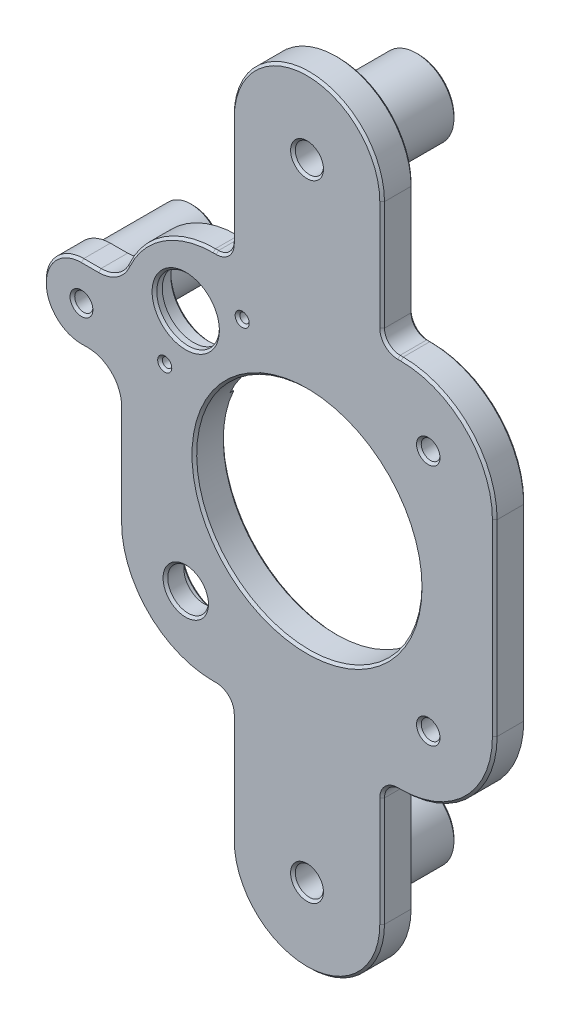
ISO-10303-21;
HEADER;
FILE_DESCRIPTION(('STEP AP214'),'2;1');
FILE_NAME('part.step','',(''),(''),'','','');
FILE_SCHEMA(('AUTOMOTIVE_DESIGN { 1 0 10303 214 1 1 1 1 }'));
ENDSEC;
DATA;
#1=APPLICATION_CONTEXT('core data for automotive mechanical design processes');
#2=APPLICATION_PROTOCOL_DEFINITION('international standard','automotive_design',2000,#1);
#3=PRODUCT_CONTEXT('',#1,'mechanical');
#4=PRODUCT('Part','Part','',(#3));
#5=PRODUCT_RELATED_PRODUCT_CATEGORY('part','',(#4));
#6=PRODUCT_DEFINITION_FORMATION('','',#4);
#7=PRODUCT_DEFINITION_CONTEXT('part definition',#1,'design');
#8=PRODUCT_DEFINITION('design','',#6,#7);
#9=PRODUCT_DEFINITION_SHAPE('','',#8);
#10=(LENGTH_UNIT() NAMED_UNIT(*) SI_UNIT(.MILLI.,.METRE.));
#11=(NAMED_UNIT(*) PLANE_ANGLE_UNIT() SI_UNIT($,.RADIAN.));
#12=(NAMED_UNIT(*) SI_UNIT($,.STERADIAN.) SOLID_ANGLE_UNIT());
#13=UNCERTAINTY_MEASURE_WITH_UNIT(LENGTH_MEASURE(1.E-05),#10,'distance_accuracy_value','');
#14=(GEOMETRIC_REPRESENTATION_CONTEXT(3) GLOBAL_UNCERTAINTY_ASSIGNED_CONTEXT((#13)) GLOBAL_UNIT_ASSIGNED_CONTEXT((#10,
#11,#12)) REPRESENTATION_CONTEXT('',''));
#15=CARTESIAN_POINT('',(0.,0.,0.));
#16=DIRECTION('',(0.,0.,1.));
#17=DIRECTION('',(1.,0.,0.));
#18=AXIS2_PLACEMENT_3D('',#15,#16,#17);
#19=CARTESIAN_POINT('',(-38.7499999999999,-38.7500000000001,10.));
#20=DIRECTION('',(0.,0.,-1.));
#21=DIRECTION('',(-1.,0.,0.));
#22=AXIS2_PLACEMENT_3D('',#19,#20,#21);
#23=CYLINDRICAL_SURFACE('',#22,6.5);
#24=CARTESIAN_POINT('',(-38.7499999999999,-38.7500000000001,9.25000000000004));
#25=DIRECTION('',(0.,0.,1.));
#26=DIRECTION('',(1.,0.,0.));
#27=AXIS2_PLACEMENT_3D('',#24,#25,#26);
#28=CIRCLE('',#27,6.5);
#29=CARTESIAN_POINT('',(-32.2499999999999,-38.7500000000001,9.25000000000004));
#30=VERTEX_POINT('',#29);
#31=EDGE_CURVE('E784',#30,#30,#28,.T.);
#32=ORIENTED_EDGE('',*,*,#31,.T.);
#33=EDGE_LOOP('',(#32));
#34=FACE_BOUND('',#33,.T.);
#35=CARTESIAN_POINT('',(-38.7499999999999,-38.7500000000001,4.1));
#36=DIRECTION('',(0.,0.,-1.));
#37=DIRECTION('',(-1.,0.,0.));
#38=AXIS2_PLACEMENT_3D('',#35,#36,#37);
#39=CIRCLE('',#38,6.5);
#40=CARTESIAN_POINT('',(-45.2499999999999,-38.7500000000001,4.1));
#41=VERTEX_POINT('',#40);
#42=EDGE_CURVE('E513',#41,#41,#39,.T.);
#43=ORIENTED_EDGE('',*,*,#42,.T.);
#44=EDGE_LOOP('',(#43));
#45=FACE_BOUND('',#44,.T.);
#46=ADVANCED_FACE('F33',(#34,#45),#23,.F.);
#47=CARTESIAN_POINT('',(-38.7500000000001,38.7499999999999,10.));
#48=DIRECTION('',(0.,0.,-1.));
#49=DIRECTION('',(-1.,0.,0.));
#50=AXIS2_PLACEMENT_3D('',#47,#48,#49);
#51=CYLINDRICAL_SURFACE('',#50,12.);
#52=CARTESIAN_POINT('',(-38.7500000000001,38.7499999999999,2.75));
#53=DIRECTION('',(0.,0.,-1.));
#54=DIRECTION('',(-1.,0.,0.));
#55=AXIS2_PLACEMENT_3D('',#52,#53,#54);
#56=CIRCLE('',#55,12.);
#57=CARTESIAN_POINT('',(-50.7500000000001,38.7499999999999,2.75));
#58=VERTEX_POINT('',#57);
#59=EDGE_CURVE('E868',#58,#58,#56,.T.);
#60=ORIENTED_EDGE('',*,*,#59,.T.);
#61=EDGE_LOOP('',(#60));
#62=FACE_BOUND('',#61,.T.);
#63=CARTESIAN_POINT('',(-38.7500000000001,38.7499999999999,7.5));
#64=DIRECTION('',(0.,0.,1.));
#65=DIRECTION('',(1.,0.,0.));
#66=AXIS2_PLACEMENT_3D('',#63,#64,#65);
#67=CIRCLE('',#66,12.);
#68=CARTESIAN_POINT('',(-26.7500000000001,38.7499999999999,7.5));
#69=VERTEX_POINT('',#68);
#70=EDGE_CURVE('E413',#69,#69,#67,.T.);
#71=ORIENTED_EDGE('',*,*,#70,.T.);
#72=EDGE_LOOP('',(#71));
#73=FACE_BOUND('',#72,.T.);
#74=ADVANCED_FACE('F1101',(#62,#73),#51,.F.);
#75=CARTESIAN_POINT('',(-28.9999999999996,60.,10.));
#76=DIRECTION('',(0.,-1.,0.));
#77=DIRECTION('',(0.,0.,-1.));
#78=AXIS2_PLACEMENT_3D('',#75,#76,#77);
#79=PLANE('',#78);
#80=DIRECTION('',(0.,0.,-1.));
#81=VECTOR('',#80,1.);
#82=CARTESIAN_POINT('',(-30.,60.,10.));
#83=LINE('',#82,#81);
#84=CARTESIAN_POINT('',(-30.,60.,9.25));
#85=VERTEX_POINT('',#84);
#86=CARTESIAN_POINT('',(-30.,60.,2.));
#87=VERTEX_POINT('',#86);
#88=EDGE_CURVE('E457',#85,#87,#83,.T.);
#89=ORIENTED_EDGE('',*,*,#88,.F.);
#90=DIRECTION('',(1.,0.,0.));
#91=VECTOR('',#90,1.);
#92=CARTESIAN_POINT('',(-28.9999999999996,60.,9.25));
#93=LINE('',#92,#91);
#94=CARTESIAN_POINT('',(-28.9999999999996,60.,9.25));
#95=VERTEX_POINT('',#94);
#96=EDGE_CURVE('E712',#85,#95,#93,.T.);
#97=ORIENTED_EDGE('',*,*,#96,.T.);
#98=DIRECTION('',(0.,0.,-1.));
#99=VECTOR('',#98,1.);
#100=CARTESIAN_POINT('',(-28.9999999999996,60.,10.));
#101=LINE('',#100,#99);
#102=CARTESIAN_POINT('',(-28.9999999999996,60.,2.));
#103=VERTEX_POINT('',#102);
#104=EDGE_CURVE('E459',#95,#103,#101,.T.);
#105=ORIENTED_EDGE('',*,*,#104,.T.);
#106=DIRECTION('',(1.,0.,0.));
#107=VECTOR('',#106,1.);
#108=CARTESIAN_POINT('',(-28.9999999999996,60.,2.));
#109=LINE('',#108,#107);
#110=EDGE_CURVE('E401',#87,#103,#109,.T.);
#111=ORIENTED_EDGE('',*,*,#110,.F.);
#112=EDGE_LOOP('',(#89,#97,#105,#111));
#113=FACE_BOUND('',#112,.T.);
#114=ADVANCED_FACE('F1107',(#113),#79,.F.);
#115=CARTESIAN_POINT('',(-30.,30.,10.));
#116=DIRECTION('',(0.,0.,-1.));
#117=DIRECTION('',(-1.,0.,0.));
#118=AXIS2_PLACEMENT_3D('',#115,#116,#117);
#119=CYLINDRICAL_SURFACE('',#118,30.);
#120=DIRECTION('',(0.,0.,-1.));
#121=VECTOR('',#120,1.);
#122=CARTESIAN_POINT('',(-57.4199517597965,42.1715342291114,10.));
#123=LINE('',#122,#121);
#124=CARTESIAN_POINT('',(-57.4199517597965,42.1715342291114,9.25));
#125=VERTEX_POINT('',#124);
#126=CARTESIAN_POINT('',(-57.4199517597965,42.1715342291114,2.));
#127=VERTEX_POINT('',#126);
#128=EDGE_CURVE('E455',#125,#127,#123,.T.);
#129=ORIENTED_EDGE('',*,*,#128,.F.);
#130=CARTESIAN_POINT('',(-30.,30.,9.25));
#131=DIRECTION('',(0.,0.,1.));
#132=DIRECTION('',(1.,0.,0.));
#133=AXIS2_PLACEMENT_3D('',#130,#131,#132);
#134=CIRCLE('',#133,30.);
#135=EDGE_CURVE('E710',#125,#85,#134,.F.);
#136=ORIENTED_EDGE('',*,*,#135,.T.);
#137=ORIENTED_EDGE('',*,*,#88,.T.);
#138=CARTESIAN_POINT('',(-30.,30.,2.));
#139=DIRECTION('',(0.,0.,-1.));
#140=DIRECTION('',(-1.,0.,0.));
#141=AXIS2_PLACEMENT_3D('',#138,#139,#140);
#142=CIRCLE('',#141,30.);
#143=EDGE_CURVE('E424',#127,#87,#142,.T.);
#144=ORIENTED_EDGE('',*,*,#143,.F.);
#145=EDGE_LOOP('',(#129,#136,#137,#144));
#146=FACE_BOUND('',#145,.T.);
#147=ADVANCED_FACE('F1170',(#146),#119,.T.);
#148=CARTESIAN_POINT('',(-45.4675144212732,20.718777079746,10.));
#149=DIRECTION('',(0.,0.,-1.));
#150=DIRECTION('',(-1.,0.,0.));
#151=AXIS2_PLACEMENT_3D('',#148,#149,#150);
#152=CYLINDRICAL_SURFACE('',#151,1.5);
#153=CARTESIAN_POINT('',(-45.4675144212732,20.718777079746,9.25000000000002));
#154=DIRECTION('',(0.,0.,1.));
#155=DIRECTION('',(1.,0.,0.));
#156=AXIS2_PLACEMENT_3D('',#153,#154,#155);
#157=CIRCLE('',#156,1.5);
#158=CARTESIAN_POINT('',(-43.9675144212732,20.718777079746,9.25000000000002));
#159=VERTEX_POINT('',#158);
#160=EDGE_CURVE('E787',#159,#159,#157,.T.);
#161=ORIENTED_EDGE('',*,*,#160,.T.);
#162=EDGE_LOOP('',(#161));
#163=FACE_BOUND('',#162,.T.);
#164=CARTESIAN_POINT('',(-45.4675144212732,20.718777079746,2.));
#165=DIRECTION('',(0.,0.,-1.));
#166=DIRECTION('',(-1.,0.,0.));
#167=AXIS2_PLACEMENT_3D('',#164,#165,#166);
#168=CIRCLE('',#167,1.5);
#169=CARTESIAN_POINT('',(-46.9675144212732,20.718777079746,2.));
#170=VERTEX_POINT('',#169);
#171=EDGE_CURVE('E410',#170,#170,#168,.F.);
#172=ORIENTED_EDGE('',*,*,#171,.F.);
#173=EDGE_LOOP('',(#172));
#174=FACE_BOUND('',#173,.T.);
#175=ADVANCED_FACE('F1173',(#163,#174),#152,.F.);
#176=CARTESIAN_POINT('',(-20.7187770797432,45.4675144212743,10.));
#177=DIRECTION('',(0.,0.,-1.));
#178=DIRECTION('',(-1.,0.,0.));
#179=AXIS2_PLACEMENT_3D('',#176,#177,#178);
#180=CYLINDRICAL_SURFACE('',#179,1.50000000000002);
#181=CARTESIAN_POINT('',(-20.7187770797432,45.4675144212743,9.25000000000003));
#182=DIRECTION('',(0.,0.,1.));
#183=DIRECTION('',(1.,0.,0.));
#184=AXIS2_PLACEMENT_3D('',#181,#182,#183);
#185=CIRCLE('',#184,1.50000000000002);
#186=CARTESIAN_POINT('',(-19.2187770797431,45.4675144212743,9.25000000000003));
#187=VERTEX_POINT('',#186);
#188=EDGE_CURVE('E790',#187,#187,#185,.T.);
#189=ORIENTED_EDGE('',*,*,#188,.T.);
#190=EDGE_LOOP('',(#189));
#191=FACE_BOUND('',#190,.T.);
#192=CARTESIAN_POINT('',(-20.7187770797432,45.4675144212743,2.));
#193=DIRECTION('',(0.,0.,-1.));
#194=DIRECTION('',(-1.,0.,0.));
#195=AXIS2_PLACEMENT_3D('',#192,#193,#194);
#196=CIRCLE('',#195,1.50000000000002);
#197=CARTESIAN_POINT('',(-22.2187770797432,45.4675144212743,2.));
#198=VERTEX_POINT('',#197);
#199=EDGE_CURVE('E406',#198,#198,#196,.F.);
#200=ORIENTED_EDGE('',*,*,#199,.F.);
#201=EDGE_LOOP('',(#200));
#202=FACE_BOUND('',#201,.T.);
#203=ADVANCED_FACE('F1145',(#191,#202),#180,.F.);
#204=CARTESIAN_POINT('',(-30.,-30.,0.));
#205=DIRECTION('',(0.,0.,1.));
#206=DIRECTION('',(1.,0.,0.));
#207=AXIS2_PLACEMENT_3D('',#204,#205,#206);
#208=PLANE('',#207);
#209=CARTESIAN_POINT('',(38.7499999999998,38.7500000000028,0.));
#210=DIRECTION('',(0.,0.,1.));
#211=DIRECTION('',(1.,0.,0.));
#212=AXIS2_PLACEMENT_3D('',#209,#210,#211);
#213=CIRCLE('',#212,7.74999999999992);
#214=CARTESIAN_POINT('',(46.4999999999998,38.7500000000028,0.));
#215=VERTEX_POINT('',#214);
#216=EDGE_CURVE('E861',#215,#215,#213,.T.);
#217=ORIENTED_EDGE('',*,*,#216,.T.);
#218=EDGE_LOOP('',(#217));
#219=FACE_BOUND('',#218,.T.);
#220=CARTESIAN_POINT('',(0.,100.,0.));
#221=DIRECTION('',(0.,0.,1.));
#222=DIRECTION('',(1.,0.,0.));
#223=AXIS2_PLACEMENT_3D('',#220,#221,#222);
#224=CIRCLE('',#223,12.7500000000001);
#225=CARTESIAN_POINT('',(12.7500000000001,100.,0.));
#226=VERTEX_POINT('',#225);
#227=EDGE_CURVE('E858',#226,#226,#224,.T.);
#228=ORIENTED_EDGE('',*,*,#227,.T.);
#229=EDGE_LOOP('',(#228));
#230=FACE_BOUND('',#229,.T.);
#231=CARTESIAN_POINT('',(-38.7499999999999,-38.7500000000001,0.));
#232=DIRECTION('',(0.,0.,1.));
#233=DIRECTION('',(1.,0.,0.));
#234=AXIS2_PLACEMENT_3D('',#231,#232,#233);
#235=CIRCLE('',#234,16.7500000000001);
#236=CARTESIAN_POINT('',(-21.9999999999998,-38.7500000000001,0.));
#237=VERTEX_POINT('',#236);
#238=EDGE_CURVE('E855',#237,#237,#235,.T.);
#239=ORIENTED_EDGE('',*,*,#238,.T.);
#240=EDGE_LOOP('',(#239));
#241=FACE_BOUND('',#240,.T.);
#242=CARTESIAN_POINT('',(38.7500000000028,-38.7499999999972,0.));
#243=DIRECTION('',(0.,0.,1.));
#244=DIRECTION('',(1.,0.,0.));
#245=AXIS2_PLACEMENT_3D('',#242,#243,#244);
#246=CIRCLE('',#245,15.7500000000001);
#247=CARTESIAN_POINT('',(54.5000000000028,-38.7499999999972,0.));
#248=VERTEX_POINT('',#247);
#249=EDGE_CURVE('E852',#248,#248,#246,.T.);
#250=ORIENTED_EDGE('',*,*,#249,.T.);
#251=EDGE_LOOP('',(#250));
#252=FACE_BOUND('',#251,.T.);
#253=CARTESIAN_POINT('',(-72.0714285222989,24.2287123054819,0.));
#254=DIRECTION('',(0.,0.,1.));
#255=DIRECTION('',(1.,0.,0.));
#256=AXIS2_PLACEMENT_3D('',#253,#254,#255);
#257=CIRCLE('',#256,11.25);
#258=CARTESIAN_POINT('',(-72.0714285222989,12.9787123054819,0.));
#259=VERTEX_POINT('',#258);
#260=CARTESIAN_POINT('',(-72.0714285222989,35.4787123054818,0.));
#261=VERTEX_POINT('',#260);
#262=EDGE_CURVE('E50',#259,#261,#257,.F.);
#263=ORIENTED_EDGE('',*,*,#262,.T.);
#264=DIRECTION('',(1.,0.,0.));
#265=VECTOR('',#264,1.);
#266=CARTESIAN_POINT('',(-30.,35.4787123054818,0.));
#267=LINE('',#266,#265);
#268=CARTESIAN_POINT('',(-66.5599356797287,35.4787123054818,0.));
#269=VERTEX_POINT('',#268);
#270=EDGE_CURVE('E850',#261,#269,#267,.T.);
#271=ORIENTED_EDGE('',*,*,#270,.T.);
#272=CARTESIAN_POINT('',(-66.5599356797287,46.2287123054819,0.));
#273=DIRECTION('',(0.,0.,1.));
#274=DIRECTION('',(1.,0.,0.));
#275=AXIS2_PLACEMENT_3D('',#272,#273,#274);
#276=CIRCLE('',#275,10.75);
#277=CARTESIAN_POINT('',(-63.7086677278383,35.8637342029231,0.));
#278=VERTEX_POINT('',#277);
#279=EDGE_CURVE('E802',#269,#278,#276,.T.);
#280=ORIENTED_EDGE('',*,*,#279,.T.);
#281=CARTESIAN_POINT('',(-38.7500000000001,38.7499999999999,0.));
#282=DIRECTION('',(0.,0.,1.));
#283=DIRECTION('',(1.,0.,0.));
#284=AXIS2_PLACEMENT_3D('',#281,#282,#283);
#285=CIRCLE('',#284,25.125);
#286=CARTESIAN_POINT('',(-33.941903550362,14.0893464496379,0.));
#287=VERTEX_POINT('',#286);
#288=EDGE_CURVE('E804',#278,#287,#285,.T.);
#289=ORIENTED_EDGE('',*,*,#288,.T.);
#290=CARTESIAN_POINT('',(0.,0.,0.));
#291=DIRECTION('',(0.,0.,1.));
#292=DIRECTION('',(1.,0.,0.));
#293=AXIS2_PLACEMENT_3D('',#290,#291,#292);
#294=CIRCLE('',#293,36.75);
#295=CARTESIAN_POINT('',(-14.0893464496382,33.9419035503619,0.));
#296=VERTEX_POINT('',#295);
#297=EDGE_CURVE('E806',#287,#296,#294,.T.);
#298=ORIENTED_EDGE('',*,*,#297,.T.);
#299=CARTESIAN_POINT('',(-38.7500000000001,38.7499999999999,0.));
#300=DIRECTION('',(0.,0.,1.));
#301=DIRECTION('',(1.,0.,0.));
#302=AXIS2_PLACEMENT_3D('',#299,#300,#301);
#303=CIRCLE('',#302,25.125);
#304=CARTESIAN_POINT('',(-25.7548259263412,60.2532805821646,0.));
#305=VERTEX_POINT('',#304);
#306=EDGE_CURVE('E808',#296,#305,#303,.T.);
#307=ORIENTED_EDGE('',*,*,#306,.T.);
#308=CARTESIAN_POINT('',(-28.9999999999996,65.,0.));
#309=DIRECTION('',(0.,0.,1.));
#310=DIRECTION('',(1.,0.,0.));
#311=AXIS2_PLACEMENT_3D('',#308,#309,#310);
#312=CIRCLE('',#311,5.75000000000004);
#313=CARTESIAN_POINT('',(-23.2499999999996,65.,0.));
#314=VERTEX_POINT('',#313);
#315=EDGE_CURVE('E810',#305,#314,#312,.T.);
#316=ORIENTED_EDGE('',*,*,#315,.T.);
#317=DIRECTION('',(0.,1.,0.));
#318=VECTOR('',#317,1.);
#319=CARTESIAN_POINT('',(-23.2499999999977,-29.9999999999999,0.));
#320=LINE('',#319,#318);
#321=CARTESIAN_POINT('',(-23.2500000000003,100.,0.));
#322=VERTEX_POINT('',#321);
#323=EDGE_CURVE('E812',#314,#322,#320,.T.);
#324=ORIENTED_EDGE('',*,*,#323,.T.);
#325=CARTESIAN_POINT('',(0.,100.,0.));
#326=DIRECTION('',(0.,0.,1.));
#327=DIRECTION('',(1.,0.,0.));
#328=AXIS2_PLACEMENT_3D('',#325,#326,#327);
#329=CIRCLE('',#328,23.25);
#330=CARTESIAN_POINT('',(23.2499999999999,100.,0.));
#331=VERTEX_POINT('',#330);
#332=EDGE_CURVE('E814',#322,#331,#329,.F.);
#333=ORIENTED_EDGE('',*,*,#332,.T.);
#334=DIRECTION('',(0.,-1.,0.));
#335=VECTOR('',#334,1.);
#336=CARTESIAN_POINT('',(23.2500000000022,-29.9999999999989,0.));
#337=LINE('',#336,#335);
#338=CARTESIAN_POINT('',(23.2500000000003,65.,0.));
#339=VERTEX_POINT('',#338);
#340=EDGE_CURVE('E816',#331,#339,#337,.T.);
#341=ORIENTED_EDGE('',*,*,#340,.T.);
#342=CARTESIAN_POINT('',(29.0000000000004,65.,0.));
#343=DIRECTION('',(0.,0.,1.));
#344=DIRECTION('',(1.,0.,0.));
#345=AXIS2_PLACEMENT_3D('',#342,#343,#344);
#346=CIRCLE('',#345,5.75000000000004);
#347=CARTESIAN_POINT('',(29.0000000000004,59.25,0.));
#348=VERTEX_POINT('',#347);
#349=EDGE_CURVE('E818',#339,#348,#346,.T.);
#350=ORIENTED_EDGE('',*,*,#349,.T.);
#351=DIRECTION('',(1.,0.,0.));
#352=VECTOR('',#351,1.);
#353=CARTESIAN_POINT('',(-30.,59.25,0.));
#354=LINE('',#353,#352);
#355=CARTESIAN_POINT('',(30.,59.25,0.));
#356=VERTEX_POINT('',#355);
#357=EDGE_CURVE('E820',#348,#356,#354,.T.);
#358=ORIENTED_EDGE('',*,*,#357,.T.);
#359=CARTESIAN_POINT('',(30.,30.,0.));
#360=DIRECTION('',(0.,0.,1.));
#361=DIRECTION('',(1.,0.,0.));
#362=AXIS2_PLACEMENT_3D('',#359,#360,#361);
#363=CIRCLE('',#362,29.25);
#364=CARTESIAN_POINT('',(59.25,30.,0.));
#365=VERTEX_POINT('',#364);
#366=EDGE_CURVE('E822',#356,#365,#363,.F.);
#367=ORIENTED_EDGE('',*,*,#366,.T.);
#368=DIRECTION('',(0.,-1.,0.));
#369=VECTOR('',#368,1.);
#370=CARTESIAN_POINT('',(59.25,-29.9999999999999,0.));
#371=LINE('',#370,#369);
#372=CARTESIAN_POINT('',(59.25,-30.,0.));
#373=VERTEX_POINT('',#372);
#374=EDGE_CURVE('E824',#365,#373,#371,.T.);
#375=ORIENTED_EDGE('',*,*,#374,.T.);
#376=CARTESIAN_POINT('',(30.,-30.,0.));
#377=DIRECTION('',(0.,0.,1.));
#378=DIRECTION('',(1.,0.,0.));
#379=AXIS2_PLACEMENT_3D('',#376,#377,#378);
#380=CIRCLE('',#379,29.25);
#381=CARTESIAN_POINT('',(30.,-59.2499999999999,0.));
#382=VERTEX_POINT('',#381);
#383=EDGE_CURVE('E826',#373,#382,#380,.F.);
#384=ORIENTED_EDGE('',*,*,#383,.T.);
#385=DIRECTION('',(-1.,0.,0.));
#386=VECTOR('',#385,1.);
#387=CARTESIAN_POINT('',(-30.0000000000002,-59.2499999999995,0.));
#388=LINE('',#387,#386);
#389=CARTESIAN_POINT('',(29.0000000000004,-59.2499999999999,0.));
#390=VERTEX_POINT('',#389);
#391=EDGE_CURVE('E828',#382,#390,#388,.T.);
#392=ORIENTED_EDGE('',*,*,#391,.T.);
#393=CARTESIAN_POINT('',(29.0000000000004,-65.,0.));
#394=DIRECTION('',(0.,0.,1.));
#395=DIRECTION('',(1.,0.,0.));
#396=AXIS2_PLACEMENT_3D('',#393,#394,#395);
#397=CIRCLE('',#396,5.75000000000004);
#398=CARTESIAN_POINT('',(23.2500000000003,-64.9999999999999,0.));
#399=VERTEX_POINT('',#398);
#400=EDGE_CURVE('E830',#390,#399,#397,.T.);
#401=ORIENTED_EDGE('',*,*,#400,.T.);
#402=DIRECTION('',(0.,-1.,0.));
#403=VECTOR('',#402,1.);
#404=CARTESIAN_POINT('',(23.2500000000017,-30.0000000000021,0.));
#405=LINE('',#404,#403);
#406=CARTESIAN_POINT('',(23.249999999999,-99.9999999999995,0.));
#407=VERTEX_POINT('',#406);
#408=EDGE_CURVE('E832',#399,#407,#405,.T.);
#409=ORIENTED_EDGE('',*,*,#408,.T.);
#410=CARTESIAN_POINT('',(0.,-100.,0.));
#411=DIRECTION('',(0.,0.,1.));
#412=DIRECTION('',(1.,0.,0.));
#413=AXIS2_PLACEMENT_3D('',#410,#411,#412);
#414=CIRCLE('',#413,23.2499999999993);
#415=CARTESIAN_POINT('',(-23.2499999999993,-100.,0.));
#416=VERTEX_POINT('',#415);
#417=EDGE_CURVE('E834',#407,#416,#414,.F.);
#418=ORIENTED_EDGE('',*,*,#417,.T.);
#419=DIRECTION('',(0.,1.,0.));
#420=VECTOR('',#419,1.);
#421=CARTESIAN_POINT('',(-23.2499999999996,-30.,0.));
#422=LINE('',#421,#420);
#423=CARTESIAN_POINT('',(-23.2499999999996,-65.,0.));
#424=VERTEX_POINT('',#423);
#425=EDGE_CURVE('E836',#416,#424,#422,.T.);
#426=ORIENTED_EDGE('',*,*,#425,.T.);
#427=CARTESIAN_POINT('',(-28.9999999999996,-65.,0.));
#428=DIRECTION('',(0.,0.,1.));
#429=DIRECTION('',(1.,0.,0.));
#430=AXIS2_PLACEMENT_3D('',#427,#428,#429);
#431=CIRCLE('',#430,5.75000000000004);
#432=CARTESIAN_POINT('',(-28.9999999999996,-59.2499999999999,0.));
#433=VERTEX_POINT('',#432);
#434=EDGE_CURVE('E838',#424,#433,#431,.T.);
#435=ORIENTED_EDGE('',*,*,#434,.T.);
#436=DIRECTION('',(-1.,0.,0.));
#437=VECTOR('',#436,1.);
#438=CARTESIAN_POINT('',(-30.,-59.2499999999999,0.));
#439=LINE('',#438,#437);
#440=CARTESIAN_POINT('',(-30.,-59.2499999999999,0.));
#441=VERTEX_POINT('',#440);
#442=EDGE_CURVE('E840',#433,#441,#439,.T.);
#443=ORIENTED_EDGE('',*,*,#442,.T.);
#444=CARTESIAN_POINT('',(-30.,-30.,0.));
#445=DIRECTION('',(0.,0.,1.));
#446=DIRECTION('',(1.,0.,0.));
#447=AXIS2_PLACEMENT_3D('',#444,#445,#446);
#448=CIRCLE('',#447,29.25);
#449=CARTESIAN_POINT('',(-59.2499999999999,-30.,0.));
#450=VERTEX_POINT('',#449);
#451=EDGE_CURVE('E842',#441,#450,#448,.F.);
#452=ORIENTED_EDGE('',*,*,#451,.T.);
#453=DIRECTION('',(0.,1.,0.));
#454=VECTOR('',#453,1.);
#455=CARTESIAN_POINT('',(-59.25,-30.,0.));
#456=LINE('',#455,#454);
#457=CARTESIAN_POINT('',(-59.25,2.22871230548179,0.));
#458=VERTEX_POINT('',#457);
#459=EDGE_CURVE('E844',#450,#458,#456,.T.);
#460=ORIENTED_EDGE('',*,*,#459,.T.);
#461=CARTESIAN_POINT('',(-70.,2.22871230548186,0.));
#462=DIRECTION('',(0.,0.,1.));
#463=DIRECTION('',(1.,0.,0.));
#464=AXIS2_PLACEMENT_3D('',#461,#462,#463);
#465=CIRCLE('',#464,10.75);
#466=CARTESIAN_POINT('',(-70.0000000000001,12.9787123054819,0.));
#467=VERTEX_POINT('',#466);
#468=EDGE_CURVE('E846',#458,#467,#465,.T.);
#469=ORIENTED_EDGE('',*,*,#468,.T.);
#470=DIRECTION('',(-1.,0.,0.));
#471=VECTOR('',#470,1.);
#472=CARTESIAN_POINT('',(-30.,12.9787123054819,0.));
#473=LINE('',#472,#471);
#474=EDGE_CURVE('E55',#467,#259,#473,.T.);
#475=ORIENTED_EDGE('',*,*,#474,.T.);
#476=EDGE_LOOP('',(#263,#271,#280,#289,#298,#307,#316,#324,#333,#341,#350,#358,#367,#375,#384,
#392,#401,#409,#418,#426,#435,#443,#452,#460,#469,#475));
#477=FACE_BOUND('',#476,.T.);
#478=CARTESIAN_POINT('',(-72.0714285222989,24.2287123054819,0.));
#479=DIRECTION('',(0.,0.,1.));
#480=DIRECTION('',(1.,0.,0.));
#481=AXIS2_PLACEMENT_3D('',#478,#479,#480);
#482=CIRCLE('',#481,10.7500000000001);
#483=CARTESIAN_POINT('',(-61.3214285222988,24.2287123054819,0.));
#484=VERTEX_POINT('',#483);
#485=EDGE_CURVE('E799',#484,#484,#482,.T.);
#486=ORIENTED_EDGE('',*,*,#485,.T.);
#487=EDGE_LOOP('',(#486));
#488=FACE_BOUND('',#487,.T.);
#489=CARTESIAN_POINT('',(0.,-100.,0.));
#490=DIRECTION('',(0.,0.,1.));
#491=DIRECTION('',(1.,0.,0.));
#492=AXIS2_PLACEMENT_3D('',#489,#490,#491);
#493=CIRCLE('',#492,12.7500000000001);
#494=CARTESIAN_POINT('',(12.7500000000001,-100.,0.));
#495=VERTEX_POINT('',#494);
#496=EDGE_CURVE('E796',#495,#495,#493,.T.);
#497=ORIENTED_EDGE('',*,*,#496,.T.);
#498=EDGE_LOOP('',(#497));
#499=FACE_BOUND('',#498,.T.);
#500=ADVANCED_FACE('F1142',(#219,#230,#241,#252,#477,#488,#499),#208,.F.);
#501=CARTESIAN_POINT('',(38.7500000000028,-38.7499999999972,-4.));
#502=DIRECTION('',(0.,0.,1.));
#503=DIRECTION('',(1.,0.,0.));
#504=AXIS2_PLACEMENT_3D('',#501,#502,#503);
#505=PLANE('',#504);
#506=CARTESIAN_POINT('',(38.7500000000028,-38.7499999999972,-4.));
#507=DIRECTION('',(0.,0.,1.));
#508=DIRECTION('',(1.,0.,0.));
#509=AXIS2_PLACEMENT_3D('',#506,#507,#508);
#510=CIRCLE('',#509,7.75000000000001);
#511=CARTESIAN_POINT('',(46.5000000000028,-38.7499999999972,-4.));
#512=VERTEX_POINT('',#511);
#513=EDGE_CURVE('E574',#512,#512,#510,.T.);
#514=ORIENTED_EDGE('',*,*,#513,.T.);
#515=EDGE_LOOP('',(#514));
#516=FACE_BOUND('',#515,.T.);
#517=CARTESIAN_POINT('',(38.7500000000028,-38.7499999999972,-4.));
#518=DIRECTION('',(0.,0.,1.));
#519=DIRECTION('',(1.,0.,0.));
#520=AXIS2_PLACEMENT_3D('',#517,#518,#519);
#521=CIRCLE('',#520,14.25);
#522=CARTESIAN_POINT('',(53.0000000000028,-38.7499999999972,-4.));
#523=VERTEX_POINT('',#522);
#524=EDGE_CURVE('E571',#523,#523,#521,.F.);
#525=ORIENTED_EDGE('',*,*,#524,.T.);
#526=EDGE_LOOP('',(#525));
#527=FACE_BOUND('',#526,.T.);
#528=ADVANCED_FACE('F1140',(#516,#527),#505,.F.);
#529=CARTESIAN_POINT('',(-30.,-30.,10.));
#530=DIRECTION('',(0.,0.,1.));
#531=DIRECTION('',(1.,0.,0.));
#532=AXIS2_PLACEMENT_3D('',#529,#530,#531);
#533=PLANE('',#532);
#534=CARTESIAN_POINT('',(-38.7500000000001,38.7499999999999,10.));
#535=DIRECTION('',(0.,0.,1.));
#536=DIRECTION('',(1.,0.,0.));
#537=AXIS2_PLACEMENT_3D('',#534,#535,#536);
#538=CIRCLE('',#537,10.75);
#539=CARTESIAN_POINT('',(-28.0000000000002,38.7499999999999,10.));
#540=VERTEX_POINT('',#539);
#541=EDGE_CURVE('E673',#540,#540,#538,.F.);
#542=ORIENTED_EDGE('',*,*,#541,.T.);
#543=EDGE_LOOP('',(#542));
#544=FACE_BOUND('',#543,.T.);
#545=CARTESIAN_POINT('',(-72.0714285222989,24.2287123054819,10.));
#546=DIRECTION('',(0.,0.,1.));
#547=DIRECTION('',(1.,0.,0.));
#548=AXIS2_PLACEMENT_3D('',#545,#546,#547);
#549=CIRCLE('',#548,3.6499999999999);
#550=CARTESIAN_POINT('',(-68.421428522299,24.2287123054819,10.));
#551=VERTEX_POINT('',#550);
#552=EDGE_CURVE('E670',#551,#551,#549,.F.);
#553=ORIENTED_EDGE('',*,*,#552,.T.);
#554=EDGE_LOOP('',(#553));
#555=FACE_BOUND('',#554,.T.);
#556=CARTESIAN_POINT('',(0.,-100.,10.));
#557=DIRECTION('',(0.,0.,1.));
#558=DIRECTION('',(1.,0.,0.));
#559=AXIS2_PLACEMENT_3D('',#556,#557,#558);
#560=CIRCLE('',#559,5.25000000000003);
#561=CARTESIAN_POINT('',(5.25000000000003,-100.,10.));
#562=VERTEX_POINT('',#561);
#563=EDGE_CURVE('E667',#562,#562,#560,.F.);
#564=ORIENTED_EDGE('',*,*,#563,.T.);
#565=EDGE_LOOP('',(#564));
#566=FACE_BOUND('',#565,.T.);
#567=CARTESIAN_POINT('',(38.7500000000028,-38.7499999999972,10.));
#568=DIRECTION('',(0.,0.,1.));
#569=DIRECTION('',(1.,0.,0.));
#570=AXIS2_PLACEMENT_3D('',#567,#568,#569);
#571=CIRCLE('',#570,3.74999999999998);
#572=CARTESIAN_POINT('',(42.5000000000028,-38.7499999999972,10.));
#573=VERTEX_POINT('',#572);
#574=EDGE_CURVE('E664',#573,#573,#571,.F.);
#575=ORIENTED_EDGE('',*,*,#574,.T.);
#576=EDGE_LOOP('',(#575));
#577=FACE_BOUND('',#576,.T.);
#578=CARTESIAN_POINT('',(0.,0.,10.));
#579=DIRECTION('',(0.,0.,1.));
#580=DIRECTION('',(1.,0.,0.));
#581=AXIS2_PLACEMENT_3D('',#578,#579,#580);
#582=CIRCLE('',#581,36.75);
#583=CARTESIAN_POINT('',(36.75,0.,10.));
#584=VERTEX_POINT('',#583);
#585=EDGE_CURVE('E661',#584,#584,#582,.F.);
#586=ORIENTED_EDGE('',*,*,#585,.T.);
#587=EDGE_LOOP('',(#586));
#588=FACE_BOUND('',#587,.T.);
#589=CARTESIAN_POINT('',(-70.,2.22871230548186,10.));
#590=DIRECTION('',(0.,0.,1.));
#591=DIRECTION('',(1.,0.,0.));
#592=AXIS2_PLACEMENT_3D('',#589,#590,#591);
#593=CIRCLE('',#592,10.75);
#594=CARTESIAN_POINT('',(-70.0000000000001,12.9787123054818,10.));
#595=VERTEX_POINT('',#594);
#596=CARTESIAN_POINT('',(-59.25,2.2287123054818,10.));
#597=VERTEX_POINT('',#596);
#598=EDGE_CURVE('E656',#595,#597,#593,.F.);
#599=ORIENTED_EDGE('',*,*,#598,.T.);
#600=DIRECTION('',(0.,-1.,0.));
#601=VECTOR('',#600,1.);
#602=CARTESIAN_POINT('',(-59.25,-30.,10.));
#603=LINE('',#602,#601);
#604=CARTESIAN_POINT('',(-59.25,-30.,10.));
#605=VERTEX_POINT('',#604);
#606=EDGE_CURVE('E658',#597,#605,#603,.T.);
#607=ORIENTED_EDGE('',*,*,#606,.T.);
#608=CARTESIAN_POINT('',(-30.,-30.,10.));
#609=DIRECTION('',(0.,0.,1.));
#610=DIRECTION('',(1.,0.,0.));
#611=AXIS2_PLACEMENT_3D('',#608,#609,#610);
#612=CIRCLE('',#611,29.25);
#613=CARTESIAN_POINT('',(-30.,-59.25,10.));
#614=VERTEX_POINT('',#613);
#615=EDGE_CURVE('E610',#605,#614,#612,.T.);
#616=ORIENTED_EDGE('',*,*,#615,.T.);
#617=DIRECTION('',(1.,0.,0.));
#618=VECTOR('',#617,1.);
#619=CARTESIAN_POINT('',(-28.9999999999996,-59.25,10.));
#620=LINE('',#619,#618);
#621=CARTESIAN_POINT('',(-28.9999999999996,-59.25,10.));
#622=VERTEX_POINT('',#621);
#623=EDGE_CURVE('E612',#614,#622,#620,.T.);
#624=ORIENTED_EDGE('',*,*,#623,.T.);
#625=CARTESIAN_POINT('',(-28.9999999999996,-65.,10.));
#626=DIRECTION('',(0.,0.,1.));
#627=DIRECTION('',(1.,0.,0.));
#628=AXIS2_PLACEMENT_3D('',#625,#626,#627);
#629=CIRCLE('',#628,5.74999999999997);
#630=CARTESIAN_POINT('',(-23.2499999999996,-65.,10.));
#631=VERTEX_POINT('',#630);
#632=EDGE_CURVE('E614',#622,#631,#629,.F.);
#633=ORIENTED_EDGE('',*,*,#632,.T.);
#634=DIRECTION('',(0.,-1.,0.));
#635=VECTOR('',#634,1.);
#636=CARTESIAN_POINT('',(-23.2499999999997,-100.,10.));
#637=LINE('',#636,#635);
#638=CARTESIAN_POINT('',(-23.2499999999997,-100.,10.));
#639=VERTEX_POINT('',#638);
#640=EDGE_CURVE('E616',#631,#639,#637,.T.);
#641=ORIENTED_EDGE('',*,*,#640,.T.);
#642=CARTESIAN_POINT('',(0.,-100.,10.));
#643=DIRECTION('',(0.,0.,1.));
#644=DIRECTION('',(1.,0.,0.));
#645=AXIS2_PLACEMENT_3D('',#642,#643,#644);
#646=CIRCLE('',#645,23.2499999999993);
#647=CARTESIAN_POINT('',(23.2499999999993,-99.9999999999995,10.));
#648=VERTEX_POINT('',#647);
#649=EDGE_CURVE('E618',#639,#648,#646,.T.);
#650=ORIENTED_EDGE('',*,*,#649,.T.);
#651=DIRECTION('',(0.,1.,0.));
#652=VECTOR('',#651,1.);
#653=CARTESIAN_POINT('',(23.2500000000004,-64.9999999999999,10.));
#654=LINE('',#653,#652);
#655=CARTESIAN_POINT('',(23.2500000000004,-65.,10.));
#656=VERTEX_POINT('',#655);
#657=EDGE_CURVE('E620',#648,#656,#654,.T.);
#658=ORIENTED_EDGE('',*,*,#657,.T.);
#659=CARTESIAN_POINT('',(29.0000000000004,-65.,10.));
#660=DIRECTION('',(0.,0.,1.));
#661=DIRECTION('',(1.,0.,0.));
#662=AXIS2_PLACEMENT_3D('',#659,#660,#661);
#663=CIRCLE('',#662,5.74999999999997);
#664=CARTESIAN_POINT('',(29.0000000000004,-59.25,10.));
#665=VERTEX_POINT('',#664);
#666=EDGE_CURVE('E622',#656,#665,#663,.F.);
#667=ORIENTED_EDGE('',*,*,#666,.T.);
#668=DIRECTION('',(1.,0.,0.));
#669=VECTOR('',#668,1.);
#670=CARTESIAN_POINT('',(30.,-59.25,10.));
#671=LINE('',#670,#669);
#672=CARTESIAN_POINT('',(30.,-59.25,10.));
#673=VERTEX_POINT('',#672);
#674=EDGE_CURVE('E624',#665,#673,#671,.T.);
#675=ORIENTED_EDGE('',*,*,#674,.T.);
#676=CARTESIAN_POINT('',(30.,-30.,10.));
#677=DIRECTION('',(0.,0.,1.));
#678=DIRECTION('',(1.,0.,0.));
#679=AXIS2_PLACEMENT_3D('',#676,#677,#678);
#680=CIRCLE('',#679,29.25);
#681=CARTESIAN_POINT('',(59.25,-30.,10.));
#682=VERTEX_POINT('',#681);
#683=EDGE_CURVE('E626',#673,#682,#680,.T.);
#684=ORIENTED_EDGE('',*,*,#683,.T.);
#685=DIRECTION('',(0.,1.,0.));
#686=VECTOR('',#685,1.);
#687=CARTESIAN_POINT('',(59.25,30.,10.));
#688=LINE('',#687,#686);
#689=CARTESIAN_POINT('',(59.25,30.,10.));
#690=VERTEX_POINT('',#689);
#691=EDGE_CURVE('E628',#682,#690,#688,.T.);
#692=ORIENTED_EDGE('',*,*,#691,.T.);
#693=CARTESIAN_POINT('',(30.,30.,10.));
#694=DIRECTION('',(0.,0.,1.));
#695=DIRECTION('',(1.,0.,0.));
#696=AXIS2_PLACEMENT_3D('',#693,#694,#695);
#697=CIRCLE('',#696,29.25);
#698=CARTESIAN_POINT('',(30.,59.25,10.));
#699=VERTEX_POINT('',#698);
#700=EDGE_CURVE('E630',#690,#699,#697,.T.);
#701=ORIENTED_EDGE('',*,*,#700,.T.);
#702=DIRECTION('',(-1.,0.,0.));
#703=VECTOR('',#702,1.);
#704=CARTESIAN_POINT('',(29.0000000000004,59.25,10.));
#705=LINE('',#704,#703);
#706=CARTESIAN_POINT('',(29.0000000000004,59.25,10.));
#707=VERTEX_POINT('',#706);
#708=EDGE_CURVE('E632',#699,#707,#705,.T.);
#709=ORIENTED_EDGE('',*,*,#708,.T.);
#710=CARTESIAN_POINT('',(29.0000000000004,65.,10.));
#711=DIRECTION('',(0.,0.,1.));
#712=DIRECTION('',(1.,0.,0.));
#713=AXIS2_PLACEMENT_3D('',#710,#711,#712);
#714=CIRCLE('',#713,5.74999999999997);
#715=CARTESIAN_POINT('',(23.2500000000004,65.,10.));
#716=VERTEX_POINT('',#715);
#717=EDGE_CURVE('E634',#707,#716,#714,.F.);
#718=ORIENTED_EDGE('',*,*,#717,.T.);
#719=DIRECTION('',(0.,1.,0.));
#720=VECTOR('',#719,1.);
#721=CARTESIAN_POINT('',(23.2499999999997,100.,10.));
#722=LINE('',#721,#720);
#723=CARTESIAN_POINT('',(23.2499999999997,100.,10.));
#724=VERTEX_POINT('',#723);
#725=EDGE_CURVE('E636',#716,#724,#722,.T.);
#726=ORIENTED_EDGE('',*,*,#725,.T.);
#727=CARTESIAN_POINT('',(0.,100.,10.));
#728=DIRECTION('',(0.,0.,1.));
#729=DIRECTION('',(1.,0.,0.));
#730=AXIS2_PLACEMENT_3D('',#727,#728,#729);
#731=CIRCLE('',#730,23.25);
#732=CARTESIAN_POINT('',(-23.2500000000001,100.,10.));
#733=VERTEX_POINT('',#732);
#734=EDGE_CURVE('E638',#724,#733,#731,.T.);
#735=ORIENTED_EDGE('',*,*,#734,.T.);
#736=DIRECTION('',(0.,-1.,0.));
#737=VECTOR('',#736,1.);
#738=CARTESIAN_POINT('',(-23.2499999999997,65.,10.));
#739=LINE('',#738,#737);
#740=CARTESIAN_POINT('',(-23.2499999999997,65.,10.));
#741=VERTEX_POINT('',#740);
#742=EDGE_CURVE('E640',#733,#741,#739,.T.);
#743=ORIENTED_EDGE('',*,*,#742,.T.);
#744=CARTESIAN_POINT('',(-28.9999999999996,65.,10.));
#745=DIRECTION('',(0.,0.,1.));
#746=DIRECTION('',(1.,0.,0.));
#747=AXIS2_PLACEMENT_3D('',#744,#745,#746);
#748=CIRCLE('',#747,5.74999999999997);
#749=CARTESIAN_POINT('',(-28.9999999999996,59.25,10.));
#750=VERTEX_POINT('',#749);
#751=EDGE_CURVE('E642',#741,#750,#748,.F.);
#752=ORIENTED_EDGE('',*,*,#751,.T.);
#753=DIRECTION('',(-1.,0.,0.));
#754=VECTOR('',#753,1.);
#755=CARTESIAN_POINT('',(-30.,59.25,10.));
#756=LINE('',#755,#754);
#757=CARTESIAN_POINT('',(-30.,59.25,10.));
#758=VERTEX_POINT('',#757);
#759=EDGE_CURVE('E644',#750,#758,#756,.T.);
#760=ORIENTED_EDGE('',*,*,#759,.T.);
#761=CARTESIAN_POINT('',(-30.,30.,10.));
#762=DIRECTION('',(0.,0.,1.));
#763=DIRECTION('',(1.,0.,0.));
#764=AXIS2_PLACEMENT_3D('',#761,#762,#763);
#765=CIRCLE('',#764,29.25);
#766=CARTESIAN_POINT('',(-56.7344529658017,41.8672458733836,10.));
#767=VERTEX_POINT('',#766);
#768=EDGE_CURVE('E646',#758,#767,#765,.T.);
#769=ORIENTED_EDGE('',*,*,#768,.T.);
#770=CARTESIAN_POINT('',(-66.5599356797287,46.2287123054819,10.));
#771=DIRECTION('',(0.,0.,1.));
#772=DIRECTION('',(1.,0.,0.));
#773=AXIS2_PLACEMENT_3D('',#770,#771,#772);
#774=CIRCLE('',#773,10.75);
#775=CARTESIAN_POINT('',(-66.5599356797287,35.4787123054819,10.));
#776=VERTEX_POINT('',#775);
#777=EDGE_CURVE('E648',#767,#776,#774,.F.);
#778=ORIENTED_EDGE('',*,*,#777,.T.);
#779=DIRECTION('',(-1.,0.,0.));
#780=VECTOR('',#779,1.);
#781=CARTESIAN_POINT('',(-72.0714285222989,35.4787123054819,10.));
#782=LINE('',#781,#780);
#783=CARTESIAN_POINT('',(-72.0714285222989,35.4787123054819,10.));
#784=VERTEX_POINT('',#783);
#785=EDGE_CURVE('E650',#776,#784,#782,.T.);
#786=ORIENTED_EDGE('',*,*,#785,.T.);
#787=CARTESIAN_POINT('',(-72.0714285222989,24.2287123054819,10.));
#788=DIRECTION('',(0.,0.,1.));
#789=DIRECTION('',(1.,0.,0.));
#790=AXIS2_PLACEMENT_3D('',#787,#788,#789);
#791=CIRCLE('',#790,11.25);
#792=CARTESIAN_POINT('',(-72.0714285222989,12.9787123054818,10.));
#793=VERTEX_POINT('',#792);
#794=EDGE_CURVE('E652',#784,#793,#791,.T.);
#795=ORIENTED_EDGE('',*,*,#794,.T.);
#796=DIRECTION('',(1.,0.,0.));
#797=VECTOR('',#796,1.);
#798=CARTESIAN_POINT('',(-70.0000000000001,12.9787123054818,10.));
#799=LINE('',#798,#797);
#800=EDGE_CURVE('E654',#793,#595,#799,.T.);
#801=ORIENTED_EDGE('',*,*,#800,.T.);
#802=EDGE_LOOP('',(#599,#607,#616,#624,#633,#641,#650,#658,#667,#675,#684,#692,#701,#709,#718,
#726,#735,#743,#752,#760,#769,#778,#786,#795,#801));
#803=FACE_BOUND('',#802,.T.);
#804=CARTESIAN_POINT('',(38.7499999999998,38.7500000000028,10.));
#805=DIRECTION('',(0.,0.,1.));
#806=DIRECTION('',(1.,0.,0.));
#807=AXIS2_PLACEMENT_3D('',#804,#805,#806);
#808=CIRCLE('',#807,3.74999999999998);
#809=CARTESIAN_POINT('',(42.4999999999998,38.7500000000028,10.));
#810=VERTEX_POINT('',#809);
#811=EDGE_CURVE('E607',#810,#810,#808,.F.);
#812=ORIENTED_EDGE('',*,*,#811,.T.);
#813=EDGE_LOOP('',(#812));
#814=FACE_BOUND('',#813,.T.);
#815=CARTESIAN_POINT('',(0.,100.,10.));
#816=DIRECTION('',(0.,0.,1.));
#817=DIRECTION('',(1.,0.,0.));
#818=AXIS2_PLACEMENT_3D('',#815,#816,#817);
#819=CIRCLE('',#818,5.25000000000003);
#820=CARTESIAN_POINT('',(5.25,100.,10.));
#821=VERTEX_POINT('',#820);
#822=EDGE_CURVE('E604',#821,#821,#819,.F.);
#823=ORIENTED_EDGE('',*,*,#822,.T.);
#824=EDGE_LOOP('',(#823));
#825=FACE_BOUND('',#824,.T.);
#826=CARTESIAN_POINT('',(-38.7499999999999,-38.7500000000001,10.));
#827=DIRECTION('',(0.,0.,1.));
#828=DIRECTION('',(1.,0.,0.));
#829=AXIS2_PLACEMENT_3D('',#826,#827,#828);
#830=CIRCLE('',#829,7.24999999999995);
#831=CARTESIAN_POINT('',(-31.4999999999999,-38.7500000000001,10.));
#832=VERTEX_POINT('',#831);
#833=EDGE_CURVE('E601',#832,#832,#830,.F.);
#834=ORIENTED_EDGE('',*,*,#833,.T.);
#835=EDGE_LOOP('',(#834));
#836=FACE_BOUND('',#835,.T.);
#837=CARTESIAN_POINT('',(-45.4675144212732,20.718777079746,10.));
#838=DIRECTION('',(0.,0.,1.));
#839=DIRECTION('',(1.,0.,0.));
#840=AXIS2_PLACEMENT_3D('',#837,#838,#839);
#841=CIRCLE('',#840,2.24999999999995);
#842=CARTESIAN_POINT('',(-43.2175144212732,20.718777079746,10.));
#843=VERTEX_POINT('',#842);
#844=EDGE_CURVE('E598',#843,#843,#841,.F.);
#845=ORIENTED_EDGE('',*,*,#844,.T.);
#846=EDGE_LOOP('',(#845));
#847=FACE_BOUND('',#846,.T.);
#848=CARTESIAN_POINT('',(-20.7187770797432,45.4675144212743,10.));
#849=DIRECTION('',(0.,0.,1.));
#850=DIRECTION('',(1.,0.,0.));
#851=AXIS2_PLACEMENT_3D('',#848,#849,#850);
#852=CIRCLE('',#851,2.25);
#853=CARTESIAN_POINT('',(-18.4687770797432,45.4675144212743,10.));
#854=VERTEX_POINT('',#853);
#855=EDGE_CURVE('E595',#854,#854,#852,.F.);
#856=ORIENTED_EDGE('',*,*,#855,.T.);
#857=EDGE_LOOP('',(#856));
#858=FACE_BOUND('',#857,.T.);
#859=ADVANCED_FACE('F1136',(#544,#555,#566,#577,#588,#803,#814,#825,#836,#847,#858),#533,.T.);
#860=CARTESIAN_POINT('',(-30.,-30.,10.));
#861=DIRECTION('',(0.,0.,-1.));
#862=DIRECTION('',(-1.,0.,0.));
#863=AXIS2_PLACEMENT_3D('',#860,#861,#862);
#864=CYLINDRICAL_SURFACE('',#863,30.);
#865=DIRECTION('',(0.,0.,-1.));
#866=VECTOR('',#865,1.);
#867=CARTESIAN_POINT('',(-30.,-60.,10.));
#868=LINE('',#867,#866);
#869=CARTESIAN_POINT('',(-30.,-60.,9.25));
#870=VERTEX_POINT('',#869);
#871=CARTESIAN_POINT('',(-30.,-60.,0.750000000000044));
#872=VERTEX_POINT('',#871);
#873=EDGE_CURVE('E505',#870,#872,#868,.T.);
#874=ORIENTED_EDGE('',*,*,#873,.F.);
#875=CARTESIAN_POINT('',(-30.,-30.,9.25));
#876=DIRECTION('',(0.,0.,1.));
#877=DIRECTION('',(1.,0.,0.));
#878=AXIS2_PLACEMENT_3D('',#875,#876,#877);
#879=CIRCLE('',#878,30.);
#880=CARTESIAN_POINT('',(-60.,-30.,9.25));
#881=VERTEX_POINT('',#880);
#882=EDGE_CURVE('E779',#870,#881,#879,.F.);
#883=ORIENTED_EDGE('',*,*,#882,.T.);
#884=DIRECTION('',(0.,0.,-1.));
#885=VECTOR('',#884,1.);
#886=CARTESIAN_POINT('',(-60.,-30.,10.));
#887=LINE('',#886,#885);
#888=CARTESIAN_POINT('',(-60.,-30.,0.750000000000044));
#889=VERTEX_POINT('',#888);
#890=EDGE_CURVE('E437',#881,#889,#887,.T.);
#891=ORIENTED_EDGE('',*,*,#890,.T.);
#892=CARTESIAN_POINT('',(-30.,-30.,0.750000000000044));
#893=DIRECTION('',(0.,0.,1.));
#894=DIRECTION('',(1.,0.,0.));
#895=AXIS2_PLACEMENT_3D('',#892,#893,#894);
#896=CIRCLE('',#895,30.);
#897=EDGE_CURVE('E777',#889,#872,#896,.T.);
#898=ORIENTED_EDGE('',*,*,#897,.T.);
#899=EDGE_LOOP('',(#874,#883,#891,#898));
#900=FACE_BOUND('',#899,.T.);
#901=ADVANCED_FACE('F1139',(#900),#864,.T.);
#902=CARTESIAN_POINT('',(-30.,-60.,10.));
#903=DIRECTION('',(0.,1.,0.));
#904=DIRECTION('',(0.,0.,1.));
#905=AXIS2_PLACEMENT_3D('',#902,#903,#904);
#906=PLANE('',#905);
#907=DIRECTION('',(0.,0.,-1.));
#908=VECTOR('',#907,1.);
#909=CARTESIAN_POINT('',(-28.9999999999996,-60.,10.));
#910=LINE('',#909,#908);
#911=CARTESIAN_POINT('',(-28.9999999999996,-60.,9.25));
#912=VERTEX_POINT('',#911);
#913=CARTESIAN_POINT('',(-28.9999999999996,-60.,0.750000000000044));
#914=VERTEX_POINT('',#913);
#915=EDGE_CURVE('E502',#912,#914,#910,.T.);
#916=ORIENTED_EDGE('',*,*,#915,.F.);
#917=DIRECTION('',(-1.,0.,0.));
#918=VECTOR('',#917,1.);
#919=CARTESIAN_POINT('',(-30.,-60.,9.25));
#920=LINE('',#919,#918);
#921=EDGE_CURVE('E775',#912,#870,#920,.T.);
#922=ORIENTED_EDGE('',*,*,#921,.T.);
#923=ORIENTED_EDGE('',*,*,#873,.T.);
#924=DIRECTION('',(1.,0.,0.));
#925=VECTOR('',#924,1.);
#926=CARTESIAN_POINT('',(-30.,-60.,0.750000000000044));
#927=LINE('',#926,#925);
#928=EDGE_CURVE('E773',#872,#914,#927,.T.);
#929=ORIENTED_EDGE('',*,*,#928,.T.);
#930=EDGE_LOOP('',(#916,#922,#923,#929));
#931=FACE_BOUND('',#930,.T.);
#932=ADVANCED_FACE('F1235',(#931),#906,.F.);
#933=CARTESIAN_POINT('',(-28.9999999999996,-65.,10.));
#934=DIRECTION('',(0.,0.,-1.));
#935=DIRECTION('',(-1.,0.,0.));
#936=AXIS2_PLACEMENT_3D('',#933,#934,#935);
#937=CYLINDRICAL_SURFACE('',#936,5.);
#938=DIRECTION('',(0.,0.,-1.));
#939=VECTOR('',#938,1.);
#940=CARTESIAN_POINT('',(-23.9999999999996,-65.,10.));
#941=LINE('',#940,#939);
#942=CARTESIAN_POINT('',(-23.9999999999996,-65.,9.25));
#943=VERTEX_POINT('',#942);
#944=CARTESIAN_POINT('',(-23.9999999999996,-65.,0.750000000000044));
#945=VERTEX_POINT('',#944);
#946=EDGE_CURVE('E499',#943,#945,#941,.T.);
#947=ORIENTED_EDGE('',*,*,#946,.F.);
#948=CARTESIAN_POINT('',(-28.9999999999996,-65.,9.25));
#949=DIRECTION('',(0.,0.,1.));
#950=DIRECTION('',(1.,0.,0.));
#951=AXIS2_PLACEMENT_3D('',#948,#949,#950);
#952=CIRCLE('',#951,5.);
#953=EDGE_CURVE('E771',#943,#912,#952,.T.);
#954=ORIENTED_EDGE('',*,*,#953,.T.);
#955=ORIENTED_EDGE('',*,*,#915,.T.);
#956=CARTESIAN_POINT('',(-28.9999999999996,-65.,0.750000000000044));
#957=DIRECTION('',(0.,0.,1.));
#958=DIRECTION('',(1.,0.,0.));
#959=AXIS2_PLACEMENT_3D('',#956,#957,#958);
#960=CIRCLE('',#959,5.);
#961=EDGE_CURVE('E769',#914,#945,#960,.F.);
#962=ORIENTED_EDGE('',*,*,#961,.T.);
#963=EDGE_LOOP('',(#947,#954,#955,#962));
#964=FACE_BOUND('',#963,.T.);
#965=ADVANCED_FACE('F1231',(#964),#937,.F.);
#966=CARTESIAN_POINT('',(-23.9999999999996,-100.,10.));
#967=DIRECTION('',(1.,0.,0.));
#968=DIRECTION('',(0.,1.,0.));
#969=AXIS2_PLACEMENT_3D('',#966,#967,#968);
#970=PLANE('',#969);
#971=DIRECTION('',(0.,0.,-1.));
#972=VECTOR('',#971,1.);
#973=CARTESIAN_POINT('',(-23.9999999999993,-100.,10.));
#974=LINE('',#973,#972);
#975=CARTESIAN_POINT('',(-23.9999999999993,-100.,9.25));
#976=VERTEX_POINT('',#975);
#977=CARTESIAN_POINT('',(-23.9999999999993,-100.,0.750000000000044));
#978=VERTEX_POINT('',#977);
#979=EDGE_CURVE('E496',#976,#978,#974,.T.);
#980=ORIENTED_EDGE('',*,*,#979,.F.);
#981=DIRECTION('',(0.,1.,0.));
#982=VECTOR('',#981,1.);
#983=CARTESIAN_POINT('',(-23.9999999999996,-65.,9.25));
#984=LINE('',#983,#982);
#985=EDGE_CURVE('E767',#976,#943,#984,.T.);
#986=ORIENTED_EDGE('',*,*,#985,.T.);
#987=ORIENTED_EDGE('',*,*,#946,.T.);
#988=DIRECTION('',(0.,-1.,0.));
#989=VECTOR('',#988,1.);
#990=CARTESIAN_POINT('',(-23.9999999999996,-100.,0.750000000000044));
#991=LINE('',#990,#989);
#992=EDGE_CURVE('E765',#945,#978,#991,.T.);
#993=ORIENTED_EDGE('',*,*,#992,.T.);
#994=EDGE_LOOP('',(#980,#986,#987,#993));
#995=FACE_BOUND('',#994,.T.);
#996=ADVANCED_FACE('F1227',(#995),#970,.F.);
#997=CARTESIAN_POINT('',(0.,-100.,10.));
#998=DIRECTION('',(0.,0.,-1.));
#999=DIRECTION('',(-1.,0.,0.));
#1000=AXIS2_PLACEMENT_3D('',#997,#998,#999);
#1001=CYLINDRICAL_SURFACE('',#1000,23.9999999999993);
#1002=DIRECTION('',(0.,0.,-1.));
#1003=VECTOR('',#1002,1.);
#1004=CARTESIAN_POINT('',(23.999999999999,-99.9999999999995,10.));
#1005=LINE('',#1004,#1003);
#1006=CARTESIAN_POINT('',(23.999999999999,-99.9999999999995,9.25));
#1007=VERTEX_POINT('',#1006);
#1008=CARTESIAN_POINT('',(23.999999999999,-99.9999999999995,0.750000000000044));
#1009=VERTEX_POINT('',#1008);
#1010=EDGE_CURVE('E493',#1007,#1009,#1005,.T.);
#1011=ORIENTED_EDGE('',*,*,#1010,.F.);
#1012=CARTESIAN_POINT('',(0.,-100.,9.25));
#1013=DIRECTION('',(0.,0.,1.));
#1014=DIRECTION('',(1.,0.,0.));
#1015=AXIS2_PLACEMENT_3D('',#1012,#1013,#1014);
#1016=CIRCLE('',#1015,23.9999999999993);
#1017=EDGE_CURVE('E763',#1007,#976,#1016,.F.);
#1018=ORIENTED_EDGE('',*,*,#1017,.T.);
#1019=ORIENTED_EDGE('',*,*,#979,.T.);
#1020=CARTESIAN_POINT('',(0.,-100.,0.750000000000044));
#1021=DIRECTION('',(0.,0.,1.));
#1022=DIRECTION('',(1.,0.,0.));
#1023=AXIS2_PLACEMENT_3D('',#1020,#1021,#1022);
#1024=CIRCLE('',#1023,23.9999999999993);
#1025=EDGE_CURVE('E761',#978,#1009,#1024,.T.);
#1026=ORIENTED_EDGE('',*,*,#1025,.T.);
#1027=EDGE_LOOP('',(#1011,#1018,#1019,#1026));
#1028=FACE_BOUND('',#1027,.T.);
#1029=ADVANCED_FACE('F1223',(#1028),#1001,.T.);
#1030=CARTESIAN_POINT('',(23.999999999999,-99.9999999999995,10.));
#1031=DIRECTION('',(-1.,0.,0.));
#1032=DIRECTION('',(0.,-1.,0.));
#1033=AXIS2_PLACEMENT_3D('',#1030,#1031,#1032);
#1034=PLANE('',#1033);
#1035=DIRECTION('',(0.,0.,-1.));
#1036=VECTOR('',#1035,1.);
#1037=CARTESIAN_POINT('',(24.0000000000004,-65.,10.));
#1038=LINE('',#1037,#1036);
#1039=CARTESIAN_POINT('',(24.0000000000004,-65.,9.25));
#1040=VERTEX_POINT('',#1039);
#1041=CARTESIAN_POINT('',(24.0000000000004,-65.,0.750000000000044));
#1042=VERTEX_POINT('',#1041);
#1043=EDGE_CURVE('E490',#1040,#1042,#1038,.T.);
#1044=ORIENTED_EDGE('',*,*,#1043,.F.);
#1045=DIRECTION('',(0.,-1.,0.));
#1046=VECTOR('',#1045,1.);
#1047=CARTESIAN_POINT('',(23.999999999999,-99.9999999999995,9.25));
#1048=LINE('',#1047,#1046);
#1049=EDGE_CURVE('E759',#1040,#1007,#1048,.T.);
#1050=ORIENTED_EDGE('',*,*,#1049,.T.);
#1051=ORIENTED_EDGE('',*,*,#1010,.T.);
#1052=DIRECTION('',(0.,1.,0.));
#1053=VECTOR('',#1052,1.);
#1054=CARTESIAN_POINT('',(23.999999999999,-99.9999999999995,0.750000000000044));
#1055=LINE('',#1054,#1053);
#1056=EDGE_CURVE('E757',#1009,#1042,#1055,.T.);
#1057=ORIENTED_EDGE('',*,*,#1056,.T.);
#1058=EDGE_LOOP('',(#1044,#1050,#1051,#1057));
#1059=FACE_BOUND('',#1058,.T.);
#1060=ADVANCED_FACE('F1219',(#1059),#1034,.F.);
#1061=CARTESIAN_POINT('',(29.0000000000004,-65.,10.));
#1062=DIRECTION('',(0.,0.,-1.));
#1063=DIRECTION('',(-1.,0.,0.));
#1064=AXIS2_PLACEMENT_3D('',#1061,#1062,#1063);
#1065=CYLINDRICAL_SURFACE('',#1064,5.);
#1066=DIRECTION('',(0.,0.,-1.));
#1067=VECTOR('',#1066,1.);
#1068=CARTESIAN_POINT('',(29.0000000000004,-60.,10.));
#1069=LINE('',#1068,#1067);
#1070=CARTESIAN_POINT('',(29.0000000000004,-60.,9.25));
#1071=VERTEX_POINT('',#1070);
#1072=CARTESIAN_POINT('',(29.0000000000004,-60.,0.750000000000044));
#1073=VERTEX_POINT('',#1072);
#1074=EDGE_CURVE('E487',#1071,#1073,#1069,.T.);
#1075=ORIENTED_EDGE('',*,*,#1074,.F.);
#1076=CARTESIAN_POINT('',(29.0000000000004,-65.,9.25));
#1077=DIRECTION('',(0.,0.,1.));
#1078=DIRECTION('',(1.,0.,0.));
#1079=AXIS2_PLACEMENT_3D('',#1076,#1077,#1078);
#1080=CIRCLE('',#1079,5.);
#1081=EDGE_CURVE('E755',#1071,#1040,#1080,.T.);
#1082=ORIENTED_EDGE('',*,*,#1081,.T.);
#1083=ORIENTED_EDGE('',*,*,#1043,.T.);
#1084=CARTESIAN_POINT('',(29.0000000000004,-65.,0.750000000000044));
#1085=DIRECTION('',(0.,0.,1.));
#1086=DIRECTION('',(1.,0.,0.));
#1087=AXIS2_PLACEMENT_3D('',#1084,#1085,#1086);
#1088=CIRCLE('',#1087,5.);
#1089=EDGE_CURVE('E753',#1042,#1073,#1088,.F.);
#1090=ORIENTED_EDGE('',*,*,#1089,.T.);
#1091=EDGE_LOOP('',(#1075,#1082,#1083,#1090));
#1092=FACE_BOUND('',#1091,.T.);
#1093=ADVANCED_FACE('F1215',(#1092),#1065,.F.);
#1094=CARTESIAN_POINT('',(29.0000000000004,-60.,10.));
#1095=DIRECTION('',(0.,1.,0.));
#1096=DIRECTION('',(-1.,0.,0.));
#1097=AXIS2_PLACEMENT_3D('',#1094,#1095,#1096);
#1098=PLANE('',#1097);
#1099=DIRECTION('',(0.,0.,-1.));
#1100=VECTOR('',#1099,1.);
#1101=CARTESIAN_POINT('',(30.,-60.,10.));
#1102=LINE('',#1101,#1100);
#1103=CARTESIAN_POINT('',(30.,-60.,9.25));
#1104=VERTEX_POINT('',#1103);
#1105=CARTESIAN_POINT('',(30.,-60.,0.750000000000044));
#1106=VERTEX_POINT('',#1105);
#1107=EDGE_CURVE('E484',#1104,#1106,#1102,.T.);
#1108=ORIENTED_EDGE('',*,*,#1107,.F.);
#1109=DIRECTION('',(-1.,0.,0.));
#1110=VECTOR('',#1109,1.);
#1111=CARTESIAN_POINT('',(29.0000000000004,-60.,9.25));
#1112=LINE('',#1111,#1110);
#1113=EDGE_CURVE('E751',#1104,#1071,#1112,.T.);
#1114=ORIENTED_EDGE('',*,*,#1113,.T.);
#1115=ORIENTED_EDGE('',*,*,#1074,.T.);
#1116=DIRECTION('',(1.,0.,0.));
#1117=VECTOR('',#1116,1.);
#1118=CARTESIAN_POINT('',(29.0000000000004,-60.,0.750000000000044));
#1119=LINE('',#1118,#1117);
#1120=EDGE_CURVE('E749',#1073,#1106,#1119,.T.);
#1121=ORIENTED_EDGE('',*,*,#1120,.T.);
#1122=EDGE_LOOP('',(#1108,#1114,#1115,#1121));
#1123=FACE_BOUND('',#1122,.T.);
#1124=ADVANCED_FACE('F1211',(#1123),#1098,.F.);
#1125=CARTESIAN_POINT('',(30.,-30.,10.));
#1126=DIRECTION('',(0.,0.,-1.));
#1127=DIRECTION('',(-1.,0.,0.));
#1128=AXIS2_PLACEMENT_3D('',#1125,#1126,#1127);
#1129=CYLINDRICAL_SURFACE('',#1128,30.);
#1130=DIRECTION('',(0.,0.,-1.));
#1131=VECTOR('',#1130,1.);
#1132=CARTESIAN_POINT('',(60.,-30.,10.));
#1133=LINE('',#1132,#1131);
#1134=CARTESIAN_POINT('',(60.,-30.,9.25));
#1135=VERTEX_POINT('',#1134);
#1136=CARTESIAN_POINT('',(60.,-30.,0.750000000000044));
#1137=VERTEX_POINT('',#1136);
#1138=EDGE_CURVE('E481',#1135,#1137,#1133,.T.);
#1139=ORIENTED_EDGE('',*,*,#1138,.F.);
#1140=CARTESIAN_POINT('',(30.,-30.,9.25));
#1141=DIRECTION('',(0.,0.,1.));
#1142=DIRECTION('',(1.,0.,0.));
#1143=AXIS2_PLACEMENT_3D('',#1140,#1141,#1142);
#1144=CIRCLE('',#1143,30.);
#1145=EDGE_CURVE('E747',#1135,#1104,#1144,.F.);
#1146=ORIENTED_EDGE('',*,*,#1145,.T.);
#1147=ORIENTED_EDGE('',*,*,#1107,.T.);
#1148=CARTESIAN_POINT('',(30.,-30.,0.750000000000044));
#1149=DIRECTION('',(0.,0.,1.));
#1150=DIRECTION('',(1.,0.,0.));
#1151=AXIS2_PLACEMENT_3D('',#1148,#1149,#1150);
#1152=CIRCLE('',#1151,30.);
#1153=EDGE_CURVE('E745',#1106,#1137,#1152,.T.);
#1154=ORIENTED_EDGE('',*,*,#1153,.T.);
#1155=EDGE_LOOP('',(#1139,#1146,#1147,#1154));
#1156=FACE_BOUND('',#1155,.T.);
#1157=ADVANCED_FACE('F1207',(#1156),#1129,.T.);
#1158=CARTESIAN_POINT('',(60.,-30.,10.));
#1159=DIRECTION('',(-1.,0.,0.));
#1160=DIRECTION('',(0.,-1.,0.));
#1161=AXIS2_PLACEMENT_3D('',#1158,#1159,#1160);
#1162=PLANE('',#1161);
#1163=DIRECTION('',(0.,0.,-1.));
#1164=VECTOR('',#1163,1.);
#1165=CARTESIAN_POINT('',(60.,30.,10.));
#1166=LINE('',#1165,#1164);
#1167=CARTESIAN_POINT('',(60.,30.,9.25));
#1168=VERTEX_POINT('',#1167);
#1169=CARTESIAN_POINT('',(60.,30.,0.750000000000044));
#1170=VERTEX_POINT('',#1169);
#1171=EDGE_CURVE('E478',#1168,#1170,#1166,.T.);
#1172=ORIENTED_EDGE('',*,*,#1171,.F.);
#1173=DIRECTION('',(0.,-1.,0.));
#1174=VECTOR('',#1173,1.);
#1175=CARTESIAN_POINT('',(60.,-30.,9.25));
#1176=LINE('',#1175,#1174);
#1177=EDGE_CURVE('E743',#1168,#1135,#1176,.T.);
#1178=ORIENTED_EDGE('',*,*,#1177,.T.);
#1179=ORIENTED_EDGE('',*,*,#1138,.T.);
#1180=DIRECTION('',(0.,1.,0.));
#1181=VECTOR('',#1180,1.);
#1182=CARTESIAN_POINT('',(60.,-30.,0.750000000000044));
#1183=LINE('',#1182,#1181);
#1184=EDGE_CURVE('E741',#1137,#1170,#1183,.T.);
#1185=ORIENTED_EDGE('',*,*,#1184,.T.);
#1186=EDGE_LOOP('',(#1172,#1178,#1179,#1185));
#1187=FACE_BOUND('',#1186,.T.);
#1188=ADVANCED_FACE('F1203',(#1187),#1162,.F.);
#1189=CARTESIAN_POINT('',(30.,30.,10.));
#1190=DIRECTION('',(0.,0.,-1.));
#1191=DIRECTION('',(-1.,0.,0.));
#1192=AXIS2_PLACEMENT_3D('',#1189,#1190,#1191);
#1193=CYLINDRICAL_SURFACE('',#1192,30.);
#1194=DIRECTION('',(0.,0.,-1.));
#1195=VECTOR('',#1194,1.);
#1196=CARTESIAN_POINT('',(30.,60.,10.));
#1197=LINE('',#1196,#1195);
#1198=CARTESIAN_POINT('',(30.,60.,9.25));
#1199=VERTEX_POINT('',#1198);
#1200=CARTESIAN_POINT('',(30.,60.,0.750000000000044));
#1201=VERTEX_POINT('',#1200);
#1202=EDGE_CURVE('E475',#1199,#1201,#1197,.T.);
#1203=ORIENTED_EDGE('',*,*,#1202,.F.);
#1204=CARTESIAN_POINT('',(30.,30.,9.25));
#1205=DIRECTION('',(0.,0.,1.));
#1206=DIRECTION('',(1.,0.,0.));
#1207=AXIS2_PLACEMENT_3D('',#1204,#1205,#1206);
#1208=CIRCLE('',#1207,30.);
#1209=EDGE_CURVE('E739',#1199,#1168,#1208,.F.);
#1210=ORIENTED_EDGE('',*,*,#1209,.T.);
#1211=ORIENTED_EDGE('',*,*,#1171,.T.);
#1212=CARTESIAN_POINT('',(30.,30.,0.750000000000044));
#1213=DIRECTION('',(0.,0.,1.));
#1214=DIRECTION('',(1.,0.,0.));
#1215=AXIS2_PLACEMENT_3D('',#1212,#1213,#1214);
#1216=CIRCLE('',#1215,30.);
#1217=EDGE_CURVE('E737',#1170,#1201,#1216,.T.);
#1218=ORIENTED_EDGE('',*,*,#1217,.T.);
#1219=EDGE_LOOP('',(#1203,#1210,#1211,#1218));
#1220=FACE_BOUND('',#1219,.T.);
#1221=ADVANCED_FACE('F1199',(#1220),#1193,.T.);
#1222=CARTESIAN_POINT('',(30.,60.,10.));
#1223=DIRECTION('',(0.,-1.,0.));
#1224=DIRECTION('',(0.,0.,-1.));
#1225=AXIS2_PLACEMENT_3D('',#1222,#1223,#1224);
#1226=PLANE('',#1225);
#1227=DIRECTION('',(0.,0.,-1.));
#1228=VECTOR('',#1227,1.);
#1229=CARTESIAN_POINT('',(29.0000000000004,60.,10.));
#1230=LINE('',#1229,#1228);
#1231=CARTESIAN_POINT('',(29.0000000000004,60.,9.25));
#1232=VERTEX_POINT('',#1231);
#1233=CARTESIAN_POINT('',(29.0000000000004,60.,0.750000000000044));
#1234=VERTEX_POINT('',#1233);
#1235=EDGE_CURVE('E472',#1232,#1234,#1230,.T.);
#1236=ORIENTED_EDGE('',*,*,#1235,.F.);
#1237=DIRECTION('',(1.,0.,0.));
#1238=VECTOR('',#1237,1.);
#1239=CARTESIAN_POINT('',(30.,60.,9.25));
#1240=LINE('',#1239,#1238);
#1241=EDGE_CURVE('E735',#1232,#1199,#1240,.T.);
#1242=ORIENTED_EDGE('',*,*,#1241,.T.);
#1243=ORIENTED_EDGE('',*,*,#1202,.T.);
#1244=DIRECTION('',(-1.,0.,0.));
#1245=VECTOR('',#1244,1.);
#1246=CARTESIAN_POINT('',(30.,60.,0.750000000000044));
#1247=LINE('',#1246,#1245);
#1248=EDGE_CURVE('E733',#1201,#1234,#1247,.T.);
#1249=ORIENTED_EDGE('',*,*,#1248,.T.);
#1250=EDGE_LOOP('',(#1236,#1242,#1243,#1249));
#1251=FACE_BOUND('',#1250,.T.);
#1252=ADVANCED_FACE('F1195',(#1251),#1226,.F.);
#1253=CARTESIAN_POINT('',(29.0000000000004,65.,10.));
#1254=DIRECTION('',(0.,0.,-1.));
#1255=DIRECTION('',(-1.,0.,0.));
#1256=AXIS2_PLACEMENT_3D('',#1253,#1254,#1255);
#1257=CYLINDRICAL_SURFACE('',#1256,5.);
#1258=DIRECTION('',(0.,0.,-1.));
#1259=VECTOR('',#1258,1.);
#1260=CARTESIAN_POINT('',(24.0000000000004,65.,10.));
#1261=LINE('',#1260,#1259);
#1262=CARTESIAN_POINT('',(24.0000000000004,65.,9.25));
#1263=VERTEX_POINT('',#1262);
#1264=CARTESIAN_POINT('',(24.0000000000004,65.,0.750000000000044));
#1265=VERTEX_POINT('',#1264);
#1266=EDGE_CURVE('E469',#1263,#1265,#1261,.T.);
#1267=ORIENTED_EDGE('',*,*,#1266,.F.);
#1268=CARTESIAN_POINT('',(29.0000000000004,65.,9.25));
#1269=DIRECTION('',(0.,0.,1.));
#1270=DIRECTION('',(1.,0.,0.));
#1271=AXIS2_PLACEMENT_3D('',#1268,#1269,#1270);
#1272=CIRCLE('',#1271,5.);
#1273=EDGE_CURVE('E731',#1263,#1232,#1272,.T.);
#1274=ORIENTED_EDGE('',*,*,#1273,.T.);
#1275=ORIENTED_EDGE('',*,*,#1235,.T.);
#1276=CARTESIAN_POINT('',(29.0000000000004,65.,0.750000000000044));
#1277=DIRECTION('',(0.,0.,1.));
#1278=DIRECTION('',(1.,0.,0.));
#1279=AXIS2_PLACEMENT_3D('',#1276,#1277,#1278);
#1280=CIRCLE('',#1279,5.);
#1281=EDGE_CURVE('E729',#1234,#1265,#1280,.F.);
#1282=ORIENTED_EDGE('',*,*,#1281,.T.);
#1283=EDGE_LOOP('',(#1267,#1274,#1275,#1282));
#1284=FACE_BOUND('',#1283,.T.);
#1285=ADVANCED_FACE('F1191',(#1284),#1257,.F.);
#1286=CARTESIAN_POINT('',(24.0000000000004,65.,10.));
#1287=DIRECTION('',(-1.,0.,0.));
#1288=DIRECTION('',(0.,-1.,0.));
#1289=AXIS2_PLACEMENT_3D('',#1286,#1287,#1288);
#1290=PLANE('',#1289);
#1291=DIRECTION('',(0.,0.,-1.));
#1292=VECTOR('',#1291,1.);
#1293=CARTESIAN_POINT('',(24.,100.000000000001,10.));
#1294=LINE('',#1293,#1292);
#1295=CARTESIAN_POINT('',(24.,100.000000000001,9.25));
#1296=VERTEX_POINT('',#1295);
#1297=CARTESIAN_POINT('',(24.,100.000000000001,0.750000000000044));
#1298=VERTEX_POINT('',#1297);
#1299=EDGE_CURVE('E466',#1296,#1298,#1294,.T.);
#1300=ORIENTED_EDGE('',*,*,#1299,.F.);
#1301=DIRECTION('',(0.,-1.,0.));
#1302=VECTOR('',#1301,1.);
#1303=CARTESIAN_POINT('',(24.0000000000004,65.,9.25));
#1304=LINE('',#1303,#1302);
#1305=EDGE_CURVE('E727',#1296,#1263,#1304,.T.);
#1306=ORIENTED_EDGE('',*,*,#1305,.T.);
#1307=ORIENTED_EDGE('',*,*,#1266,.T.);
#1308=DIRECTION('',(0.,1.,0.));
#1309=VECTOR('',#1308,1.);
#1310=CARTESIAN_POINT('',(24.0000000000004,65.,0.750000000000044));
#1311=LINE('',#1310,#1309);
#1312=EDGE_CURVE('E725',#1265,#1298,#1311,.T.);
#1313=ORIENTED_EDGE('',*,*,#1312,.T.);
#1314=EDGE_LOOP('',(#1300,#1306,#1307,#1313));
#1315=FACE_BOUND('',#1314,.T.);
#1316=ADVANCED_FACE('F1187',(#1315),#1290,.F.);
#1317=CARTESIAN_POINT('',(0.,100.,10.));
#1318=DIRECTION('',(0.,0.,-1.));
#1319=DIRECTION('',(-1.,0.,0.));
#1320=AXIS2_PLACEMENT_3D('',#1317,#1318,#1319);
#1321=CYLINDRICAL_SURFACE('',#1320,24.);
#1322=DIRECTION('',(0.,0.,-1.));
#1323=VECTOR('',#1322,1.);
#1324=CARTESIAN_POINT('',(-24.0000000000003,100.,10.));
#1325=LINE('',#1324,#1323);
#1326=CARTESIAN_POINT('',(-24.0000000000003,100.,9.25));
#1327=VERTEX_POINT('',#1326);
#1328=CARTESIAN_POINT('',(-24.0000000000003,100.,0.750000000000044));
#1329=VERTEX_POINT('',#1328);
#1330=EDGE_CURVE('E463',#1327,#1329,#1325,.T.);
#1331=ORIENTED_EDGE('',*,*,#1330,.F.);
#1332=CARTESIAN_POINT('',(0.,100.,9.25));
#1333=DIRECTION('',(0.,0.,1.));
#1334=DIRECTION('',(1.,0.,0.));
#1335=AXIS2_PLACEMENT_3D('',#1332,#1333,#1334);
#1336=CIRCLE('',#1335,24.);
#1337=EDGE_CURVE('E723',#1327,#1296,#1336,.F.);
#1338=ORIENTED_EDGE('',*,*,#1337,.T.);
#1339=ORIENTED_EDGE('',*,*,#1299,.T.);
#1340=CARTESIAN_POINT('',(0.,100.,0.750000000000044));
#1341=DIRECTION('',(0.,0.,1.));
#1342=DIRECTION('',(1.,0.,0.));
#1343=AXIS2_PLACEMENT_3D('',#1340,#1341,#1342);
#1344=CIRCLE('',#1343,24.);
#1345=EDGE_CURVE('E721',#1298,#1329,#1344,.T.);
#1346=ORIENTED_EDGE('',*,*,#1345,.T.);
#1347=EDGE_LOOP('',(#1331,#1338,#1339,#1346));
#1348=FACE_BOUND('',#1347,.T.);
#1349=ADVANCED_FACE('F1183',(#1348),#1321,.T.);
#1350=CARTESIAN_POINT('',(-23.9999999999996,65.,10.));
#1351=DIRECTION('',(1.,0.,0.));
#1352=DIRECTION('',(0.,1.,0.));
#1353=AXIS2_PLACEMENT_3D('',#1350,#1351,#1352);
#1354=PLANE('',#1353);
#1355=DIRECTION('',(0.,0.,-1.));
#1356=VECTOR('',#1355,1.);
#1357=CARTESIAN_POINT('',(-23.9999999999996,65.,10.));
#1358=LINE('',#1357,#1356);
#1359=CARTESIAN_POINT('',(-23.9999999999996,65.,9.25));
#1360=VERTEX_POINT('',#1359);
#1361=CARTESIAN_POINT('',(-23.9999999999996,65.,0.750000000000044));
#1362=VERTEX_POINT('',#1361);
#1363=EDGE_CURVE('E461',#1360,#1362,#1358,.T.);
#1364=ORIENTED_EDGE('',*,*,#1363,.F.);
#1365=DIRECTION('',(0.,1.,0.));
#1366=VECTOR('',#1365,1.);
#1367=CARTESIAN_POINT('',(-24.0000000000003,100.,9.25));
#1368=LINE('',#1367,#1366);
#1369=EDGE_CURVE('E719',#1360,#1327,#1368,.T.);
#1370=ORIENTED_EDGE('',*,*,#1369,.T.);
#1371=ORIENTED_EDGE('',*,*,#1330,.T.);
#1372=DIRECTION('',(0.,-1.,0.));
#1373=VECTOR('',#1372,1.);
#1374=CARTESIAN_POINT('',(-23.9999999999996,65.,0.750000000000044));
#1375=LINE('',#1374,#1373);
#1376=EDGE_CURVE('E717',#1329,#1362,#1375,.T.);
#1377=ORIENTED_EDGE('',*,*,#1376,.T.);
#1378=EDGE_LOOP('',(#1364,#1370,#1371,#1377));
#1379=FACE_BOUND('',#1378,.T.);
#1380=ADVANCED_FACE('F1180',(#1379),#1354,.F.);
#1381=CARTESIAN_POINT('',(-28.9999999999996,65.,10.));
#1382=DIRECTION('',(0.,0.,-1.));
#1383=DIRECTION('',(-1.,0.,0.));
#1384=AXIS2_PLACEMENT_3D('',#1381,#1382,#1383);
#1385=CYLINDRICAL_SURFACE('',#1384,5.);
#1386=ORIENTED_EDGE('',*,*,#104,.F.);
#1387=CARTESIAN_POINT('',(-28.9999999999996,65.,9.25));
#1388=DIRECTION('',(0.,0.,1.));
#1389=DIRECTION('',(1.,0.,0.));
#1390=AXIS2_PLACEMENT_3D('',#1387,#1388,#1389);
#1391=CIRCLE('',#1390,5.);
#1392=EDGE_CURVE('E715',#95,#1360,#1391,.T.);
#1393=ORIENTED_EDGE('',*,*,#1392,.T.);
#1394=ORIENTED_EDGE('',*,*,#1363,.T.);
#1395=CARTESIAN_POINT('',(-28.9999999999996,65.,0.750000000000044));
#1396=DIRECTION('',(0.,0.,1.));
#1397=DIRECTION('',(1.,0.,0.));
#1398=AXIS2_PLACEMENT_3D('',#1395,#1396,#1397);
#1399=CIRCLE('',#1398,5.);
#1400=CARTESIAN_POINT('',(-27.3332545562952,60.285982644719,0.750000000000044));
#1401=VERTEX_POINT('',#1400);
#1402=EDGE_CURVE('E386',#1362,#1401,#1399,.F.);
#1403=ORIENTED_EDGE('',*,*,#1402,.T.);
#1404=DIRECTION('',(0.,0.,-1.));
#1405=VECTOR('',#1404,1.);
#1406=CARTESIAN_POINT('',(-27.3332545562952,60.285982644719,1.));
#1407=LINE('',#1406,#1405);
#1408=CARTESIAN_POINT('',(-27.3332545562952,60.285982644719,2.));
#1409=VERTEX_POINT('',#1408);
#1410=EDGE_CURVE('E379',#1401,#1409,#1407,.F.);
#1411=ORIENTED_EDGE('',*,*,#1410,.T.);
#1412=CARTESIAN_POINT('',(-28.9999999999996,65.,2.));
#1413=DIRECTION('',(0.,0.,-1.));
#1414=DIRECTION('',(-1.,0.,0.));
#1415=AXIS2_PLACEMENT_3D('',#1412,#1413,#1414);
#1416=CIRCLE('',#1415,5.);
#1417=EDGE_CURVE('E383',#103,#1409,#1416,.F.);
#1418=ORIENTED_EDGE('',*,*,#1417,.F.);
#1419=EDGE_LOOP('',(#1386,#1393,#1394,#1403,#1411,#1418));
#1420=FACE_BOUND('',#1419,.T.);
#1421=ADVANCED_FACE('F382',(#1420),#1385,.F.);
#1422=CARTESIAN_POINT('',(-66.5599356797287,46.2287123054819,10.));
#1423=DIRECTION('',(0.,0.,-1.));
#1424=DIRECTION('',(-1.,0.,0.));
#1425=AXIS2_PLACEMENT_3D('',#1422,#1423,#1424);
#1426=CYLINDRICAL_SURFACE('',#1425,10.);
#1427=DIRECTION('',(0.,0.,-1.));
#1428=VECTOR('',#1427,1.);
#1429=CARTESIAN_POINT('',(-66.5599356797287,36.2287123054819,10.));
#1430=LINE('',#1429,#1428);
#1431=CARTESIAN_POINT('',(-66.5599356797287,36.2287123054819,9.25));
#1432=VERTEX_POINT('',#1431);
#1433=CARTESIAN_POINT('',(-66.5599356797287,36.2287123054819,0.750000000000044));
#1434=VERTEX_POINT('',#1433);
#1435=EDGE_CURVE('E452',#1432,#1434,#1430,.T.);
#1436=ORIENTED_EDGE('',*,*,#1435,.F.);
#1437=CARTESIAN_POINT('',(-66.5599356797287,46.2287123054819,9.25));
#1438=DIRECTION('',(0.,0.,1.));
#1439=DIRECTION('',(1.,0.,0.));
#1440=AXIS2_PLACEMENT_3D('',#1437,#1438,#1439);
#1441=CIRCLE('',#1440,10.);
#1442=EDGE_CURVE('E708',#1432,#125,#1441,.T.);
#1443=ORIENTED_EDGE('',*,*,#1442,.T.);
#1444=ORIENTED_EDGE('',*,*,#128,.T.);
#1445=CARTESIAN_POINT('',(-66.5599356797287,46.2287123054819,2.));
#1446=DIRECTION('',(0.,0.,-1.));
#1447=DIRECTION('',(-1.,0.,0.));
#1448=AXIS2_PLACEMENT_3D('',#1445,#1446,#1447);
#1449=CIRCLE('',#1448,10.);
#1450=CARTESIAN_POINT('',(-63.0519424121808,36.8642057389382,2.));
#1451=VERTEX_POINT('',#1450);
#1452=EDGE_CURVE('E421',#1451,#127,#1449,.F.);
#1453=ORIENTED_EDGE('',*,*,#1452,.F.);
#1454=DIRECTION('',(0.,0.,-1.));
#1455=VECTOR('',#1454,1.);
#1456=CARTESIAN_POINT('',(-63.0519424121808,36.8642057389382,1.));
#1457=LINE('',#1456,#1455);
#1458=CARTESIAN_POINT('',(-63.0519424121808,36.8642057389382,0.750000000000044));
#1459=VERTEX_POINT('',#1458);
#1460=EDGE_CURVE('E391',#1451,#1459,#1457,.T.);
#1461=ORIENTED_EDGE('',*,*,#1460,.T.);
#1462=CARTESIAN_POINT('',(-66.5599356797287,46.2287123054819,0.750000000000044));
#1463=DIRECTION('',(0.,0.,1.));
#1464=DIRECTION('',(1.,0.,0.));
#1465=AXIS2_PLACEMENT_3D('',#1462,#1463,#1464);
#1466=CIRCLE('',#1465,10.);
#1467=EDGE_CURVE('E706',#1459,#1434,#1466,.F.);
#1468=ORIENTED_EDGE('',*,*,#1467,.T.);
#1469=EDGE_LOOP('',(#1436,#1443,#1444,#1453,#1461,#1468));
#1470=FACE_BOUND('',#1469,.T.);
#1471=ADVANCED_FACE('F1165',(#1470),#1426,.F.);
#1472=CARTESIAN_POINT('',(-72.0714285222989,36.2287123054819,10.));
#1473=DIRECTION('',(0.,-1.,0.));
#1474=DIRECTION('',(0.,0.,-1.));
#1475=AXIS2_PLACEMENT_3D('',#1472,#1473,#1474);
#1476=PLANE('',#1475);
#1477=DIRECTION('',(0.,0.,-1.));
#1478=VECTOR('',#1477,1.);
#1479=CARTESIAN_POINT('',(-72.0714285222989,36.2287123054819,10.));
#1480=LINE('',#1479,#1478);
#1481=CARTESIAN_POINT('',(-72.0714285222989,36.2287123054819,9.25));
#1482=VERTEX_POINT('',#1481);
#1483=CARTESIAN_POINT('',(-72.0714285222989,36.2287123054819,0.750000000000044));
#1484=VERTEX_POINT('',#1483);
#1485=EDGE_CURVE('E449',#1482,#1484,#1480,.T.);
#1486=ORIENTED_EDGE('',*,*,#1485,.F.);
#1487=DIRECTION('',(1.,0.,0.));
#1488=VECTOR('',#1487,1.);
#1489=CARTESIAN_POINT('',(-66.5599356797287,36.2287123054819,9.25));
#1490=LINE('',#1489,#1488);
#1491=EDGE_CURVE('E704',#1482,#1432,#1490,.T.);
#1492=ORIENTED_EDGE('',*,*,#1491,.T.);
#1493=ORIENTED_EDGE('',*,*,#1435,.T.);
#1494=DIRECTION('',(-1.,0.,0.));
#1495=VECTOR('',#1494,1.);
#1496=CARTESIAN_POINT('',(-72.0714285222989,36.2287123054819,0.750000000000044));
#1497=LINE('',#1496,#1495);
#1498=EDGE_CURVE('E701',#1434,#1484,#1497,.T.);
#1499=ORIENTED_EDGE('',*,*,#1498,.T.);
#1500=EDGE_LOOP('',(#1486,#1492,#1493,#1499));
#1501=FACE_BOUND('',#1500,.T.);
#1502=ADVANCED_FACE('F1161',(#1501),#1476,.F.);
#1503=CARTESIAN_POINT('',(-72.0714285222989,24.2287123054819,10.));
#1504=DIRECTION('',(0.,0.,-1.));
#1505=DIRECTION('',(-1.,0.,0.));
#1506=AXIS2_PLACEMENT_3D('',#1503,#1504,#1505);
#1507=CYLINDRICAL_SURFACE('',#1506,12.);
#1508=DIRECTION('',(0.,0.,-1.));
#1509=VECTOR('',#1508,1.);
#1510=CARTESIAN_POINT('',(-72.0714285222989,12.2287123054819,10.));
#1511=LINE('',#1510,#1509);
#1512=CARTESIAN_POINT('',(-72.0714285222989,12.2287123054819,9.25));
#1513=VERTEX_POINT('',#1512);
#1514=CARTESIAN_POINT('',(-72.0714285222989,12.2287123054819,0.750000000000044));
#1515=VERTEX_POINT('',#1514);
#1516=EDGE_CURVE('E446',#1513,#1515,#1511,.T.);
#1517=ORIENTED_EDGE('',*,*,#1516,.F.);
#1518=CARTESIAN_POINT('',(-72.0714285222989,24.2287123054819,9.25));
#1519=DIRECTION('',(0.,0.,1.));
#1520=DIRECTION('',(1.,0.,0.));
#1521=AXIS2_PLACEMENT_3D('',#1518,#1519,#1520);
#1522=CIRCLE('',#1521,12.);
#1523=EDGE_CURVE('E699',#1513,#1482,#1522,.F.);
#1524=ORIENTED_EDGE('',*,*,#1523,.T.);
#1525=ORIENTED_EDGE('',*,*,#1485,.T.);
#1526=CARTESIAN_POINT('',(-72.0714285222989,24.2287123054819,0.750000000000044));
#1527=DIRECTION('',(0.,0.,1.));
#1528=DIRECTION('',(1.,0.,0.));
#1529=AXIS2_PLACEMENT_3D('',#1526,#1527,#1528);
#1530=CIRCLE('',#1529,12.);
#1531=EDGE_CURVE('E697',#1484,#1515,#1530,.T.);
#1532=ORIENTED_EDGE('',*,*,#1531,.T.);
#1533=EDGE_LOOP('',(#1517,#1524,#1525,#1532));
#1534=FACE_BOUND('',#1533,.T.);
#1535=ADVANCED_FACE('F1157',(#1534),#1507,.T.);
#1536=CARTESIAN_POINT('',(-72.0714285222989,12.2287123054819,10.));
#1537=DIRECTION('',(0.,1.,0.));
#1538=DIRECTION('',(0.,0.,1.));
#1539=AXIS2_PLACEMENT_3D('',#1536,#1537,#1538);
#1540=PLANE('',#1539);
#1541=DIRECTION('',(0.,0.,-1.));
#1542=VECTOR('',#1541,1.);
#1543=CARTESIAN_POINT('',(-70.0000000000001,12.2287123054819,10.));
#1544=LINE('',#1543,#1542);
#1545=CARTESIAN_POINT('',(-70.0000000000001,12.2287123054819,9.25));
#1546=VERTEX_POINT('',#1545);
#1547=CARTESIAN_POINT('',(-70.0000000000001,12.2287123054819,0.750000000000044));
#1548=VERTEX_POINT('',#1547);
#1549=EDGE_CURVE('E443',#1546,#1548,#1544,.T.);
#1550=ORIENTED_EDGE('',*,*,#1549,.F.);
#1551=DIRECTION('',(-1.,0.,0.));
#1552=VECTOR('',#1551,1.);
#1553=CARTESIAN_POINT('',(-72.0714285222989,12.2287123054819,9.25));
#1554=LINE('',#1553,#1552);
#1555=EDGE_CURVE('E695',#1546,#1513,#1554,.T.);
#1556=ORIENTED_EDGE('',*,*,#1555,.T.);
#1557=ORIENTED_EDGE('',*,*,#1516,.T.);
#1558=DIRECTION('',(1.,0.,0.));
#1559=VECTOR('',#1558,1.);
#1560=CARTESIAN_POINT('',(-72.0714285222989,12.2287123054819,0.750000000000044));
#1561=LINE('',#1560,#1559);
#1562=EDGE_CURVE('E693',#1515,#1548,#1561,.T.);
#1563=ORIENTED_EDGE('',*,*,#1562,.T.);
#1564=EDGE_LOOP('',(#1550,#1556,#1557,#1563));
#1565=FACE_BOUND('',#1564,.T.);
#1566=ADVANCED_FACE('F1153',(#1565),#1540,.F.);
#1567=CARTESIAN_POINT('',(-70.,2.22871230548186,10.));
#1568=DIRECTION('',(0.,0.,-1.));
#1569=DIRECTION('',(-1.,0.,0.));
#1570=AXIS2_PLACEMENT_3D('',#1567,#1568,#1569);
#1571=CYLINDRICAL_SURFACE('',#1570,10.);
#1572=DIRECTION('',(0.,0.,-1.));
#1573=VECTOR('',#1572,1.);
#1574=CARTESIAN_POINT('',(-60.,2.2287123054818,10.));
#1575=LINE('',#1574,#1573);
#1576=CARTESIAN_POINT('',(-60.,2.2287123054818,9.25));
#1577=VERTEX_POINT('',#1576);
#1578=CARTESIAN_POINT('',(-60.,2.2287123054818,0.750000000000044));
#1579=VERTEX_POINT('',#1578);
#1580=EDGE_CURVE('E440',#1577,#1579,#1575,.T.);
#1581=ORIENTED_EDGE('',*,*,#1580,.F.);
#1582=CARTESIAN_POINT('',(-70.,2.22871230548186,9.25));
#1583=DIRECTION('',(0.,0.,1.));
#1584=DIRECTION('',(1.,0.,0.));
#1585=AXIS2_PLACEMENT_3D('',#1582,#1583,#1584);
#1586=CIRCLE('',#1585,10.);
#1587=EDGE_CURVE('E691',#1577,#1546,#1586,.T.);
#1588=ORIENTED_EDGE('',*,*,#1587,.T.);
#1589=ORIENTED_EDGE('',*,*,#1549,.T.);
#1590=CARTESIAN_POINT('',(-70.,2.22871230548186,0.750000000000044));
#1591=DIRECTION('',(0.,0.,1.));
#1592=DIRECTION('',(1.,0.,0.));
#1593=AXIS2_PLACEMENT_3D('',#1590,#1591,#1592);
#1594=CIRCLE('',#1593,10.);
#1595=EDGE_CURVE('E689',#1548,#1579,#1594,.F.);
#1596=ORIENTED_EDGE('',*,*,#1595,.T.);
#1597=EDGE_LOOP('',(#1581,#1588,#1589,#1596));
#1598=FACE_BOUND('',#1597,.T.);
#1599=ADVANCED_FACE('F1149',(#1598),#1571,.F.);
#1600=CARTESIAN_POINT('',(-60.,2.2287123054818,10.));
#1601=DIRECTION('',(1.,0.,0.));
#1602=DIRECTION('',(0.,1.,0.));
#1603=AXIS2_PLACEMENT_3D('',#1600,#1601,#1602);
#1604=PLANE('',#1603);
#1605=ORIENTED_EDGE('',*,*,#890,.F.);
#1606=DIRECTION('',(0.,1.,0.));
#1607=VECTOR('',#1606,1.);
#1608=CARTESIAN_POINT('',(-60.,2.2287123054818,9.25));
#1609=LINE('',#1608,#1607);
#1610=EDGE_CURVE('E686',#881,#1577,#1609,.T.);
#1611=ORIENTED_EDGE('',*,*,#1610,.T.);
#1612=ORIENTED_EDGE('',*,*,#1580,.T.);
#1613=DIRECTION('',(0.,-1.,0.));
#1614=VECTOR('',#1613,1.);
#1615=CARTESIAN_POINT('',(-60.,2.2287123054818,0.750000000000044));
#1616=LINE('',#1615,#1614);
#1617=EDGE_CURVE('E684',#1579,#889,#1616,.T.);
#1618=ORIENTED_EDGE('',*,*,#1617,.T.);
#1619=EDGE_LOOP('',(#1605,#1611,#1612,#1618));
#1620=FACE_BOUND('',#1619,.T.);
#1621=ADVANCED_FACE('F1133',(#1620),#1604,.F.);
#1622=CARTESIAN_POINT('',(0.,0.,10.));
#1623=DIRECTION('',(0.,0.,-1.));
#1624=DIRECTION('',(-1.,0.,0.));
#1625=AXIS2_PLACEMENT_3D('',#1622,#1623,#1624);
#1626=CYLINDRICAL_SURFACE('',#1625,36.);
#1627=CARTESIAN_POINT('',(0.,0.,9.24999999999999));
#1628=DIRECTION('',(0.,0.,1.));
#1629=DIRECTION('',(1.,0.,0.));
#1630=AXIS2_PLACEMENT_3D('',#1627,#1628,#1629);
#1631=CIRCLE('',#1630,36.);
#1632=CARTESIAN_POINT('',(36.,0.,9.24999999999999));
#1633=VERTEX_POINT('',#1632);
#1634=EDGE_CURVE('E681',#1633,#1633,#1631,.T.);
#1635=ORIENTED_EDGE('',*,*,#1634,.T.);
#1636=EDGE_LOOP('',(#1635));
#1637=FACE_BOUND('',#1636,.T.);
#1638=DIRECTION('',(0.,0.,-1.));
#1639=VECTOR('',#1638,1.);
#1640=CARTESIAN_POINT('',(-15.1486624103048,32.6575875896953,1.));
#1641=LINE('',#1640,#1639);
#1642=CARTESIAN_POINT('',(-15.1486624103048,32.6575875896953,0.750000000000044));
#1643=VERTEX_POINT('',#1642);
#1644=CARTESIAN_POINT('',(-15.1486624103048,32.6575875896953,2.));
#1645=VERTEX_POINT('',#1644);
#1646=EDGE_CURVE('E405',#1643,#1645,#1641,.F.);
#1647=ORIENTED_EDGE('',*,*,#1646,.F.);
#1648=CARTESIAN_POINT('',(0.,0.,0.750000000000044));
#1649=DIRECTION('',(0.,0.,1.));
#1650=DIRECTION('',(1.,0.,0.));
#1651=AXIS2_PLACEMENT_3D('',#1648,#1649,#1650);
#1652=CIRCLE('',#1651,36.);
#1653=CARTESIAN_POINT('',(-32.6575875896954,15.1486624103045,0.750000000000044));
#1654=VERTEX_POINT('',#1653);
#1655=EDGE_CURVE('E679',#1643,#1654,#1652,.F.);
#1656=ORIENTED_EDGE('',*,*,#1655,.T.);
#1657=DIRECTION('',(0.,0.,-1.));
#1658=VECTOR('',#1657,1.);
#1659=CARTESIAN_POINT('',(-32.6575875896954,15.1486624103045,1.));
#1660=LINE('',#1659,#1658);
#1661=CARTESIAN_POINT('',(-32.6575875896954,15.1486624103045,2.));
#1662=VERTEX_POINT('',#1661);
#1663=EDGE_CURVE('E507',#1662,#1654,#1660,.T.);
#1664=ORIENTED_EDGE('',*,*,#1663,.F.);
#1665=CARTESIAN_POINT('',(0.,0.,2.));
#1666=DIRECTION('',(0.,0.,-1.));
#1667=DIRECTION('',(-1.,0.,0.));
#1668=AXIS2_PLACEMENT_3D('',#1665,#1666,#1667);
#1669=CIRCLE('',#1668,36.);
#1670=EDGE_CURVE('E419',#1662,#1645,#1669,.T.);
#1671=ORIENTED_EDGE('',*,*,#1670,.T.);
#1672=EDGE_LOOP('',(#1647,#1656,#1664,#1671));
#1673=FACE_BOUND('',#1672,.T.);
#1674=ADVANCED_FACE('F1130',(#1637,#1673),#1626,.F.);
#1675=CARTESIAN_POINT('',(38.7499999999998,38.7500000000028,10.));
#1676=DIRECTION('',(0.,0.,-1.));
#1677=DIRECTION('',(-1.,0.,0.));
#1678=AXIS2_PLACEMENT_3D('',#1675,#1676,#1677);
#1679=CYLINDRICAL_SURFACE('',#1678,3.);
#1680=CARTESIAN_POINT('',(38.7499999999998,38.7500000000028,9.25000000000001));
#1681=DIRECTION('',(0.,0.,1.));
#1682=DIRECTION('',(1.,0.,0.));
#1683=AXIS2_PLACEMENT_3D('',#1680,#1681,#1682);
#1684=CIRCLE('',#1683,3.);
#1685=CARTESIAN_POINT('',(41.7499999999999,38.7500000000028,9.25000000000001));
#1686=VERTEX_POINT('',#1685);
#1687=EDGE_CURVE('E781',#1686,#1686,#1684,.T.);
#1688=ORIENTED_EDGE('',*,*,#1687,.T.);
#1689=EDGE_LOOP('',(#1688));
#1690=FACE_BOUND('',#1689,.T.);
#1691=CARTESIAN_POINT('',(38.7499999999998,38.7500000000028,-1.2));
#1692=DIRECTION('',(0.,0.,-1.));
#1693=DIRECTION('',(-1.,0.,0.));
#1694=AXIS2_PLACEMENT_3D('',#1691,#1692,#1693);
#1695=CIRCLE('',#1694,3.);
#1696=CARTESIAN_POINT('',(35.7499999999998,38.7500000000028,-1.2));
#1697=VERTEX_POINT('',#1696);
#1698=EDGE_CURVE('E390',#1697,#1697,#1695,.T.);
#1699=ORIENTED_EDGE('',*,*,#1698,.T.);
#1700=EDGE_LOOP('',(#1699));
#1701=FACE_BOUND('',#1700,.T.);
#1702=ADVANCED_FACE('F1126',(#1690,#1701),#1679,.F.);
#1703=CARTESIAN_POINT('',(38.7500000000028,-38.7499999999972,10.));
#1704=DIRECTION('',(0.,0.,-1.));
#1705=DIRECTION('',(-1.,0.,0.));
#1706=AXIS2_PLACEMENT_3D('',#1703,#1704,#1705);
#1707=CYLINDRICAL_SURFACE('',#1706,3.);
#1708=CARTESIAN_POINT('',(38.7500000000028,-38.7499999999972,9.25000000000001));
#1709=DIRECTION('',(0.,0.,1.));
#1710=DIRECTION('',(1.,0.,0.));
#1711=AXIS2_PLACEMENT_3D('',#1708,#1709,#1710);
#1712=CIRCLE('',#1711,3.);
#1713=CARTESIAN_POINT('',(41.7500000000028,-38.7499999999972,9.25000000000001));
#1714=VERTEX_POINT('',#1713);
#1715=EDGE_CURVE('E676',#1714,#1714,#1712,.T.);
#1716=ORIENTED_EDGE('',*,*,#1715,.T.);
#1717=EDGE_LOOP('',(#1716));
#1718=FACE_BOUND('',#1717,.T.);
#1719=CARTESIAN_POINT('',(38.7500000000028,-38.7499999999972,-4.6));
#1720=DIRECTION('',(0.,0.,-1.));
#1721=DIRECTION('',(-1.,0.,0.));
#1722=AXIS2_PLACEMENT_3D('',#1719,#1720,#1721);
#1723=CIRCLE('',#1722,3.00000000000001);
#1724=CARTESIAN_POINT('',(35.7500000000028,-38.7499999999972,-4.6));
#1725=VERTEX_POINT('',#1724);
#1726=EDGE_CURVE('E434',#1725,#1725,#1723,.T.);
#1727=ORIENTED_EDGE('',*,*,#1726,.T.);
#1728=EDGE_LOOP('',(#1727));
#1729=FACE_BOUND('',#1728,.T.);
#1730=ADVANCED_FACE('F1122',(#1718,#1729),#1707,.F.);
#1731=CARTESIAN_POINT('',(0.,100.,10.));
#1732=DIRECTION('',(0.,0.,-1.));
#1733=DIRECTION('',(-1.,0.,0.));
#1734=AXIS2_PLACEMENT_3D('',#1731,#1732,#1733);
#1735=CYLINDRICAL_SURFACE('',#1734,4.5);
#1736=CARTESIAN_POINT('',(0.,100.,-24.95));
#1737=DIRECTION('',(0.,0.,-1.));
#1738=DIRECTION('',(-1.,0.,0.));
#1739=AXIS2_PLACEMENT_3D('',#1736,#1737,#1738);
#1740=CIRCLE('',#1739,4.5);
#1741=CARTESIAN_POINT('',(-4.50000000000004,100.,-24.95));
#1742=VERTEX_POINT('',#1741);
#1743=EDGE_CURVE('E520',#1742,#1742,#1740,.T.);
#1744=ORIENTED_EDGE('',*,*,#1743,.T.);
#1745=EDGE_LOOP('',(#1744));
#1746=FACE_BOUND('',#1745,.T.);
#1747=CARTESIAN_POINT('',(0.,100.,9.24999999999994));
#1748=DIRECTION('',(0.,0.,1.));
#1749=DIRECTION('',(1.,0.,0.));
#1750=AXIS2_PLACEMENT_3D('',#1747,#1748,#1749);
#1751=CIRCLE('',#1750,4.5);
#1752=CARTESIAN_POINT('',(4.49999999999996,100.,9.24999999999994));
#1753=VERTEX_POINT('',#1752);
#1754=EDGE_CURVE('E512',#1753,#1753,#1751,.T.);
#1755=ORIENTED_EDGE('',*,*,#1754,.T.);
#1756=EDGE_LOOP('',(#1755));
#1757=FACE_BOUND('',#1756,.T.);
#1758=ADVANCED_FACE('F1118',(#1746,#1757),#1735,.F.);
#1759=CARTESIAN_POINT('',(0.,-100.,10.));
#1760=DIRECTION('',(0.,0.,-1.));
#1761=DIRECTION('',(-1.,0.,0.));
#1762=AXIS2_PLACEMENT_3D('',#1759,#1760,#1761);
#1763=CYLINDRICAL_SURFACE('',#1762,4.5);
#1764=CARTESIAN_POINT('',(0.,-100.,-24.9499999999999));
#1765=DIRECTION('',(0.,0.,1.));
#1766=DIRECTION('',(1.,0.,0.));
#1767=AXIS2_PLACEMENT_3D('',#1764,#1765,#1766);
#1768=CIRCLE('',#1767,4.5);
#1769=CARTESIAN_POINT('',(4.5,-100.,-24.9499999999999));
#1770=VERTEX_POINT('',#1769);
#1771=EDGE_CURVE('E538',#1770,#1770,#1768,.F.);
#1772=ORIENTED_EDGE('',*,*,#1771,.T.);
#1773=EDGE_LOOP('',(#1772));
#1774=FACE_BOUND('',#1773,.T.);
#1775=CARTESIAN_POINT('',(0.,-100.,9.24999999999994));
#1776=DIRECTION('',(0.,0.,1.));
#1777=DIRECTION('',(1.,0.,0.));
#1778=AXIS2_PLACEMENT_3D('',#1775,#1776,#1777);
#1779=CIRCLE('',#1778,4.5);
#1780=CARTESIAN_POINT('',(4.5,-100.,9.24999999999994));
#1781=VERTEX_POINT('',#1780);
#1782=EDGE_CURVE('E535',#1781,#1781,#1779,.T.);
#1783=ORIENTED_EDGE('',*,*,#1782,.T.);
#1784=EDGE_LOOP('',(#1783));
#1785=FACE_BOUND('',#1784,.T.);
#1786=ADVANCED_FACE('F1115',(#1774,#1785),#1763,.F.);
#1787=CARTESIAN_POINT('',(-72.0714285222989,24.2287123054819,10.));
#1788=DIRECTION('',(0.,0.,-1.));
#1789=DIRECTION('',(-1.,0.,0.));
#1790=AXIS2_PLACEMENT_3D('',#1787,#1788,#1789);
#1791=CYLINDRICAL_SURFACE('',#1790,2.9);
#1792=CARTESIAN_POINT('',(-72.0714285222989,24.2287123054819,-24.95));
#1793=DIRECTION('',(0.,0.,-1.));
#1794=DIRECTION('',(-1.,0.,0.));
#1795=AXIS2_PLACEMENT_3D('',#1792,#1793,#1794);
#1796=CIRCLE('',#1795,2.9);
#1797=CARTESIAN_POINT('',(-74.9714285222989,24.2287123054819,-24.95));
#1798=VERTEX_POINT('',#1797);
#1799=EDGE_CURVE('E556',#1798,#1798,#1796,.T.);
#1800=ORIENTED_EDGE('',*,*,#1799,.T.);
#1801=EDGE_LOOP('',(#1800));
#1802=FACE_BOUND('',#1801,.T.);
#1803=CARTESIAN_POINT('',(-72.0714285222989,24.2287123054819,9.25000000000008));
#1804=DIRECTION('',(0.,0.,1.));
#1805=DIRECTION('',(1.,0.,0.));
#1806=AXIS2_PLACEMENT_3D('',#1803,#1804,#1805);
#1807=CIRCLE('',#1806,2.9);
#1808=CARTESIAN_POINT('',(-69.1714285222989,24.2287123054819,9.25000000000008));
#1809=VERTEX_POINT('',#1808);
#1810=EDGE_CURVE('E553',#1809,#1809,#1807,.T.);
#1811=ORIENTED_EDGE('',*,*,#1810,.T.);
#1812=EDGE_LOOP('',(#1811));
#1813=FACE_BOUND('',#1812,.T.);
#1814=ADVANCED_FACE('F1113',(#1802,#1813),#1791,.F.);
#1815=CARTESIAN_POINT('',(38.7500000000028,-38.7499999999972,-4.));
#1816=DIRECTION('',(0.,0.,1.));
#1817=DIRECTION('',(1.,0.,0.));
#1818=AXIS2_PLACEMENT_3D('',#1815,#1816,#1817);
#1819=CYLINDRICAL_SURFACE('',#1818,15.);
#1820=CARTESIAN_POINT('',(38.7500000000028,-38.7499999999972,-3.24999999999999));
#1821=DIRECTION('',(0.,0.,1.));
#1822=DIRECTION('',(1.,0.,0.));
#1823=AXIS2_PLACEMENT_3D('',#1820,#1821,#1822);
#1824=CIRCLE('',#1823,15.);
#1825=CARTESIAN_POINT('',(53.7500000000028,-38.7499999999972,-3.24999999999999));
#1826=VERTEX_POINT('',#1825);
#1827=EDGE_CURVE('E580',#1826,#1826,#1824,.T.);
#1828=ORIENTED_EDGE('',*,*,#1827,.T.);
#1829=EDGE_LOOP('',(#1828));
#1830=FACE_BOUND('',#1829,.T.);
#1831=CARTESIAN_POINT('',(38.7500000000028,-38.7499999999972,-0.750000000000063));
#1832=DIRECTION('',(0.,0.,1.));
#1833=DIRECTION('',(1.,0.,0.));
#1834=AXIS2_PLACEMENT_3D('',#1831,#1832,#1833);
#1835=CIRCLE('',#1834,15.);
#1836=CARTESIAN_POINT('',(53.7500000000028,-38.7499999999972,-0.750000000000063));
#1837=VERTEX_POINT('',#1836);
#1838=EDGE_CURVE('E577',#1837,#1837,#1835,.F.);
#1839=ORIENTED_EDGE('',*,*,#1838,.T.);
#1840=EDGE_LOOP('',(#1839));
#1841=FACE_BOUND('',#1840,.T.);
#1842=ADVANCED_FACE('F1711',(#1830,#1841),#1819,.T.);
#1843=CARTESIAN_POINT('',(-38.7499999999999,-38.7500000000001,-1.5));
#1844=DIRECTION('',(0.,0.,-1.));
#1845=DIRECTION('',(-1.,0.,0.));
#1846=AXIS2_PLACEMENT_3D('',#1843,#1844,#1845);
#1847=PLANE('',#1846);
#1848=CARTESIAN_POINT('',(-38.7499999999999,-38.7500000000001,-1.5));
#1849=DIRECTION('',(0.,0.,-1.));
#1850=DIRECTION('',(-1.,0.,0.));
#1851=AXIS2_PLACEMENT_3D('',#1848,#1849,#1850);
#1852=CIRCLE('',#1851,15.25);
#1853=CARTESIAN_POINT('',(-53.9999999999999,-38.7500000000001,-1.5));
#1854=VERTEX_POINT('',#1853);
#1855=EDGE_CURVE('E586',#1854,#1854,#1852,.T.);
#1856=ORIENTED_EDGE('',*,*,#1855,.T.);
#1857=EDGE_LOOP('',(#1856));
#1858=FACE_BOUND('',#1857,.T.);
#1859=CARTESIAN_POINT('',(-38.7499999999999,-38.7500000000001,-1.5));
#1860=DIRECTION('',(0.,0.,-1.));
#1861=DIRECTION('',(-1.,0.,0.));
#1862=AXIS2_PLACEMENT_3D('',#1859,#1860,#1861);
#1863=CIRCLE('',#1862,12.75);
#1864=CARTESIAN_POINT('',(-51.4999999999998,-38.7500000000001,-1.5));
#1865=VERTEX_POINT('',#1864);
#1866=EDGE_CURVE('E583',#1865,#1865,#1863,.F.);
#1867=ORIENTED_EDGE('',*,*,#1866,.T.);
#1868=EDGE_LOOP('',(#1867));
#1869=FACE_BOUND('',#1868,.T.);
#1870=ADVANCED_FACE('F1704',(#1858,#1869),#1847,.T.);
#1871=CARTESIAN_POINT('',(-72.0714285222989,24.2287123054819,-25.7));
#1872=DIRECTION('',(0.,0.,-1.));
#1873=DIRECTION('',(-1.,0.,0.));
#1874=AXIS2_PLACEMENT_3D('',#1871,#1872,#1873);
#1875=PLANE('',#1874);
#1876=CARTESIAN_POINT('',(-72.0714285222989,24.2287123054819,-25.7));
#1877=DIRECTION('',(0.,0.,-1.));
#1878=DIRECTION('',(-1.,0.,0.));
#1879=AXIS2_PLACEMENT_3D('',#1876,#1877,#1878);
#1880=CIRCLE('',#1879,3.64999999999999);
#1881=CARTESIAN_POINT('',(-75.7214285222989,24.2287123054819,-25.7));
#1882=VERTEX_POINT('',#1881);
#1883=EDGE_CURVE('E562',#1882,#1882,#1880,.F.);
#1884=ORIENTED_EDGE('',*,*,#1883,.T.);
#1885=EDGE_LOOP('',(#1884));
#1886=FACE_BOUND('',#1885,.T.);
#1887=CARTESIAN_POINT('',(-72.0714285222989,24.2287123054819,-25.7));
#1888=DIRECTION('',(0.,0.,-1.));
#1889=DIRECTION('',(-1.,0.,0.));
#1890=AXIS2_PLACEMENT_3D('',#1887,#1888,#1889);
#1891=CIRCLE('',#1890,9.25000000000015);
#1892=CARTESIAN_POINT('',(-81.321428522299,24.2287123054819,-25.7));
#1893=VERTEX_POINT('',#1892);
#1894=EDGE_CURVE('E559',#1893,#1893,#1891,.T.);
#1895=ORIENTED_EDGE('',*,*,#1894,.T.);
#1896=EDGE_LOOP('',(#1895));
#1897=FACE_BOUND('',#1896,.T.);
#1898=ADVANCED_FACE('F1701',(#1886,#1897),#1875,.T.);
#1899=CARTESIAN_POINT('',(-72.0714285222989,24.2287123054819,-25.7));
#1900=DIRECTION('',(0.,0.,1.));
#1901=DIRECTION('',(1.,0.,0.));
#1902=AXIS2_PLACEMENT_3D('',#1899,#1900,#1901);
#1903=CYLINDRICAL_SURFACE('',#1902,9.99999999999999);
#1904=CARTESIAN_POINT('',(-72.0714285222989,24.2287123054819,-24.9500000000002));
#1905=DIRECTION('',(0.,0.,-1.));
#1906=DIRECTION('',(-1.,0.,0.));
#1907=AXIS2_PLACEMENT_3D('',#1904,#1905,#1906);
#1908=CIRCLE('',#1907,9.99999999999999);
#1909=CARTESIAN_POINT('',(-62.0714285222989,24.2287123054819,-24.9500000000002));
#1910=VERTEX_POINT('',#1909);
#1911=EDGE_CURVE('E568',#1910,#1910,#1908,.F.);
#1912=CARTESIAN_POINT('',(-72.0714285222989,24.2287123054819,-0.750000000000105));
#1913=DIRECTION('',(0.,0.,1.));
#1914=DIRECTION('',(1.,0.,0.));
#1915=AXIS2_PLACEMENT_3D('',#1912,#1913,#1914);
#1916=CIRCLE('',#1915,9.99999999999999);
#1917=CARTESIAN_POINT('',(-62.0714285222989,24.2287123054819,-0.750000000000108));
#1918=VERTEX_POINT('',#1917);
#1919=EDGE_CURVE('E565',#1918,#1918,#1916,.F.);
#1920=CARTESIAN_POINT('',(-62.0714285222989,24.2287123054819,-24.9500000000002));
#1921=CARTESIAN_POINT('',(-62.0714285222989,24.2287123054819,-24.6979166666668));
#1922=CARTESIAN_POINT('',(-62.0714285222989,24.2287123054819,-24.4458333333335));
#1923=CARTESIAN_POINT('',(-62.0714285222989,24.2287123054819,-23.9416666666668));
#1924=CARTESIAN_POINT('',(-62.0714285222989,24.2287123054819,-23.6895833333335));
#1925=CARTESIAN_POINT('',(-62.0714285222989,24.2287123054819,-23.1854166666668));
#1926=CARTESIAN_POINT('',(-62.0714285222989,24.2287123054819,-22.9333333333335));
#1927=CARTESIAN_POINT('',(-62.0714285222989,24.2287123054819,-22.4291666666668));
#1928=CARTESIAN_POINT('',(-62.0714285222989,24.2287123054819,-22.1770833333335));
#1929=CARTESIAN_POINT('',(-62.0714285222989,24.2287123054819,-21.6729166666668));
#1930=CARTESIAN_POINT('',(-62.0714285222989,24.2287123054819,-21.4208333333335));
#1931=CARTESIAN_POINT('',(-62.0714285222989,24.2287123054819,-20.9166666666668));
#1932=CARTESIAN_POINT('',(-62.0714285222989,24.2287123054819,-20.6645833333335));
#1933=CARTESIAN_POINT('',(-62.0714285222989,24.2287123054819,-20.1604166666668));
#1934=CARTESIAN_POINT('',(-62.0714285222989,24.2287123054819,-19.9083333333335));
#1935=CARTESIAN_POINT('',(-62.0714285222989,24.2287123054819,-19.4041666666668));
#1936=CARTESIAN_POINT('',(-62.0714285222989,24.2287123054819,-19.1520833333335));
#1937=CARTESIAN_POINT('',(-62.0714285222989,24.2287123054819,-18.6479166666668));
#1938=CARTESIAN_POINT('',(-62.0714285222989,24.2287123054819,-18.3958333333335));
#1939=CARTESIAN_POINT('',(-62.0714285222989,24.2287123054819,-17.8916666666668));
#1940=CARTESIAN_POINT('',(-62.0714285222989,24.2287123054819,-17.6395833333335));
#1941=CARTESIAN_POINT('',(-62.0714285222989,24.2287123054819,-17.1354166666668));
#1942=CARTESIAN_POINT('',(-62.0714285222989,24.2287123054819,-16.8833333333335));
#1943=CARTESIAN_POINT('',(-62.0714285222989,24.2287123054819,-16.3791666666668));
#1944=CARTESIAN_POINT('',(-62.0714285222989,24.2287123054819,-16.1270833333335));
#1945=CARTESIAN_POINT('',(-62.0714285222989,24.2287123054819,-15.6229166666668));
#1946=CARTESIAN_POINT('',(-62.0714285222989,24.2287123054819,-15.3708333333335));
#1947=CARTESIAN_POINT('',(-62.0714285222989,24.2287123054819,-14.8666666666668));
#1948=CARTESIAN_POINT('',(-62.0714285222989,24.2287123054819,-14.6145833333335));
#1949=CARTESIAN_POINT('',(-62.0714285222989,24.2287123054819,-14.1104166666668));
#1950=CARTESIAN_POINT('',(-62.0714285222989,24.2287123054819,-13.8583333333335));
#1951=CARTESIAN_POINT('',(-62.0714285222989,24.2287123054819,-13.3541666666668));
#1952=CARTESIAN_POINT('',(-62.0714285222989,24.2287123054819,-13.1020833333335));
#1953=CARTESIAN_POINT('',(-62.0714285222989,24.2287123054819,-12.5979166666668));
#1954=CARTESIAN_POINT('',(-62.0714285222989,24.2287123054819,-12.3458333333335));
#1955=CARTESIAN_POINT('',(-62.0714285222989,24.2287123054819,-11.8416666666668));
#1956=CARTESIAN_POINT('',(-62.0714285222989,24.2287123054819,-11.5895833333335));
#1957=CARTESIAN_POINT('',(-62.0714285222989,24.2287123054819,-11.0854166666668));
#1958=CARTESIAN_POINT('',(-62.0714285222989,24.2287123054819,-10.8333333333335));
#1959=CARTESIAN_POINT('',(-62.0714285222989,24.2287123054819,-10.3291666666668));
#1960=CARTESIAN_POINT('',(-62.0714285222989,24.2287123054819,-10.0770833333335));
#1961=CARTESIAN_POINT('',(-62.0714285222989,24.2287123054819,-9.57291666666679));
#1962=CARTESIAN_POINT('',(-62.0714285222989,24.2287123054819,-9.32083333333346));
#1963=CARTESIAN_POINT('',(-62.0714285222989,24.2287123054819,-8.81666666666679));
#1964=CARTESIAN_POINT('',(-62.0714285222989,24.2287123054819,-8.56458333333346));
#1965=CARTESIAN_POINT('',(-62.0714285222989,24.2287123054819,-8.06041666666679));
#1966=CARTESIAN_POINT('',(-62.0714285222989,24.2287123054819,-7.80833333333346));
#1967=CARTESIAN_POINT('',(-62.0714285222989,24.2287123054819,-7.30416666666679));
#1968=CARTESIAN_POINT('',(-62.0714285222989,24.2287123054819,-7.05208333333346));
#1969=CARTESIAN_POINT('',(-62.0714285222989,24.2287123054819,-6.54791666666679));
#1970=CARTESIAN_POINT('',(-62.0714285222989,24.2287123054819,-6.29583333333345));
#1971=CARTESIAN_POINT('',(-62.0714285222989,24.2287123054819,-5.79166666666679));
#1972=CARTESIAN_POINT('',(-62.0714285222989,24.2287123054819,-5.53958333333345));
#1973=CARTESIAN_POINT('',(-62.0714285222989,24.2287123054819,-5.03541666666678));
#1974=CARTESIAN_POINT('',(-62.0714285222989,24.2287123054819,-4.78333333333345));
#1975=CARTESIAN_POINT('',(-62.0714285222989,24.2287123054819,-4.27916666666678));
#1976=CARTESIAN_POINT('',(-62.0714285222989,24.2287123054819,-4.02708333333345));
#1977=CARTESIAN_POINT('',(-62.0714285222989,24.2287123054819,-3.52291666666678));
#1978=CARTESIAN_POINT('',(-62.0714285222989,24.2287123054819,-3.27083333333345));
#1979=CARTESIAN_POINT('',(-62.0714285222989,24.2287123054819,-2.76666666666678));
#1980=CARTESIAN_POINT('',(-62.0714285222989,24.2287123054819,-2.51458333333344));
#1981=CARTESIAN_POINT('',(-62.0714285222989,24.2287123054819,-2.01041666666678));
#1982=CARTESIAN_POINT('',(-62.0714285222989,24.2287123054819,-1.75833333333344));
#1983=CARTESIAN_POINT('',(-62.0714285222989,24.2287123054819,-1.25416666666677));
#1984=CARTESIAN_POINT('',(-62.0714285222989,24.2287123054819,-1.00208333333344));
#1985=CARTESIAN_POINT('',(-62.0714285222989,24.2287123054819,-0.750000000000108));
#1986=B_SPLINE_CURVE_WITH_KNOTS('',3,(#1920,#1921,#1922,#1923,#1924,#1925,#1926,#1927,#1928,
#1929,#1930,#1931,#1932,#1933,#1934,#1935,#1936,#1937,#1938,#1939,#1940,#1941,#1942,#1943,#1944,
#1945,#1946,#1947,#1948,#1949,#1950,#1951,#1952,#1953,#1954,#1955,#1956,#1957,#1958,#1959,#1960,
#1961,#1962,#1963,#1964,#1965,#1966,#1967,#1968,#1969,#1970,#1971,#1972,#1973,#1974,#1975,#1976,
#1977,#1978,#1979,#1980,#1981,#1982,#1983,#1984,#1985),.UNSPECIFIED.,.F.,.F.,(4,2,2,2,2,2,2,2,2,
2,2,2,2,2,2,2,2,2,2,2,2,2,2,2,2,2,2,2,2,2,2,2,4),(0.,0.75625,1.5125,2.26875,3.025,
3.78125000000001,4.53750000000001,5.29375000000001,6.05000000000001,6.80625000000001,
7.56250000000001,8.31875000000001,9.07500000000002,9.83125000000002,10.5875,11.34375,12.1,
12.85625,13.6125,14.36875,15.125,15.88125,16.6375,17.39375,18.15,18.90625,19.6625,20.41875,
21.175,21.93125,22.6875,23.44375,24.2),.UNSPECIFIED.);
#1987=EDGE_CURVE('BSEAM1696',#1910,#1918,#1986,.T.);
#1988=ORIENTED_EDGE('',*,*,#1911,.T.);
#1989=ORIENTED_EDGE('',*,*,#1919,.T.);
#1990=ORIENTED_EDGE('',*,*,#1987,.T.);
#1991=ORIENTED_EDGE('',*,*,#1987,.F.);
#1992=EDGE_LOOP('',(#1988,#1990,#1989,#1991));
#1993=FACE_BOUND('',#1992,.T.);
#1994=ADVANCED_FACE('F1696',(#1993),#1903,.T.);
#1995=CARTESIAN_POINT('',(0.,100.,-25.7));
#1996=DIRECTION('',(0.,0.,-1.));
#1997=DIRECTION('',(-1.,0.,0.));
#1998=AXIS2_PLACEMENT_3D('',#1995,#1996,#1997);
#1999=PLANE('',#1998);
#2000=CARTESIAN_POINT('',(0.,100.,-25.7));
#2001=DIRECTION('',(0.,0.,-1.));
#2002=DIRECTION('',(-1.,0.,0.));
#2003=AXIS2_PLACEMENT_3D('',#2000,#2001,#2002);
#2004=CIRCLE('',#2003,5.24999999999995);
#2005=CARTESIAN_POINT('',(-5.24999999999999,100.,-25.7));
#2006=VERTEX_POINT('',#2005);
#2007=EDGE_CURVE('E526',#2006,#2006,#2004,.F.);
#2008=ORIENTED_EDGE('',*,*,#2007,.T.);
#2009=EDGE_LOOP('',(#2008));
#2010=FACE_BOUND('',#2009,.T.);
#2011=CARTESIAN_POINT('',(0.,100.,-25.7));
#2012=DIRECTION('',(0.,0.,-1.));
#2013=DIRECTION('',(-1.,0.,0.));
#2014=AXIS2_PLACEMENT_3D('',#2011,#2012,#2013);
#2015=CIRCLE('',#2014,11.2500000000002);
#2016=CARTESIAN_POINT('',(-11.2500000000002,100.,-25.7));
#2017=VERTEX_POINT('',#2016);
#2018=EDGE_CURVE('E523',#2017,#2017,#2015,.T.);
#2019=ORIENTED_EDGE('',*,*,#2018,.T.);
#2020=EDGE_LOOP('',(#2019));
#2021=FACE_BOUND('',#2020,.T.);
#2022=ADVANCED_FACE('F1693',(#2010,#2021),#1999,.T.);
#2023=CARTESIAN_POINT('',(0.,100.,-25.7));
#2024=DIRECTION('',(0.,0.,1.));
#2025=DIRECTION('',(1.,0.,0.));
#2026=AXIS2_PLACEMENT_3D('',#2023,#2024,#2025);
#2027=CYLINDRICAL_SURFACE('',#2026,12.);
#2028=CARTESIAN_POINT('',(0.,100.,-24.9500000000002));
#2029=DIRECTION('',(0.,0.,-1.));
#2030=DIRECTION('',(-1.,0.,0.));
#2031=AXIS2_PLACEMENT_3D('',#2028,#2029,#2030);
#2032=CIRCLE('',#2031,12.);
#2033=CARTESIAN_POINT('',(12.,100.,-24.9500000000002));
#2034=VERTEX_POINT('',#2033);
#2035=EDGE_CURVE('E532',#2034,#2034,#2032,.F.);
#2036=CARTESIAN_POINT('',(0.,100.,-0.750000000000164));
#2037=DIRECTION('',(0.,0.,1.));
#2038=DIRECTION('',(1.,0.,0.));
#2039=AXIS2_PLACEMENT_3D('',#2036,#2037,#2038);
#2040=CIRCLE('',#2039,12.);
#2041=CARTESIAN_POINT('',(12.,100.,-0.750000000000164));
#2042=VERTEX_POINT('',#2041);
#2043=EDGE_CURVE('E529',#2042,#2042,#2040,.F.);
#2044=CARTESIAN_POINT('',(12.,100.,-24.9500000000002));
#2045=CARTESIAN_POINT('',(12.,100.,-24.6979166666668));
#2046=CARTESIAN_POINT('',(12.,100.,-24.4458333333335));
#2047=CARTESIAN_POINT('',(12.,100.,-23.9416666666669));
#2048=CARTESIAN_POINT('',(12.,100.,-23.6895833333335));
#2049=CARTESIAN_POINT('',(12.,100.,-23.1854166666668));
#2050=CARTESIAN_POINT('',(12.,100.,-22.9333333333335));
#2051=CARTESIAN_POINT('',(12.,100.,-22.4291666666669));
#2052=CARTESIAN_POINT('',(12.,100.,-22.1770833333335));
#2053=CARTESIAN_POINT('',(12.,100.,-21.6729166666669));
#2054=CARTESIAN_POINT('',(12.,100.,-21.4208333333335));
#2055=CARTESIAN_POINT('',(12.,100.,-20.9166666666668));
#2056=CARTESIAN_POINT('',(12.,100.,-20.6645833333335));
#2057=CARTESIAN_POINT('',(12.,100.,-20.1604166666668));
#2058=CARTESIAN_POINT('',(12.,100.,-19.9083333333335));
#2059=CARTESIAN_POINT('',(12.,100.,-19.4041666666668));
#2060=CARTESIAN_POINT('',(12.,100.,-19.1520833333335));
#2061=CARTESIAN_POINT('',(12.,100.,-18.6479166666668));
#2062=CARTESIAN_POINT('',(12.,100.,-18.3958333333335));
#2063=CARTESIAN_POINT('',(12.,100.,-17.8916666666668));
#2064=CARTESIAN_POINT('',(12.,100.,-17.6395833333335));
#2065=CARTESIAN_POINT('',(12.,100.,-17.1354166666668));
#2066=CARTESIAN_POINT('',(12.,100.,-16.8833333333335));
#2067=CARTESIAN_POINT('',(12.,100.,-16.3791666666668));
#2068=CARTESIAN_POINT('',(12.,100.,-16.1270833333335));
#2069=CARTESIAN_POINT('',(12.,100.,-15.6229166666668));
#2070=CARTESIAN_POINT('',(12.,100.,-15.3708333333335));
#2071=CARTESIAN_POINT('',(12.,100.,-14.8666666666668));
#2072=CARTESIAN_POINT('',(12.,100.,-14.6145833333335));
#2073=CARTESIAN_POINT('',(12.,100.,-14.1104166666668));
#2074=CARTESIAN_POINT('',(12.,100.,-13.8583333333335));
#2075=CARTESIAN_POINT('',(12.,100.,-13.3541666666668));
#2076=CARTESIAN_POINT('',(12.,100.,-13.1020833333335));
#2077=CARTESIAN_POINT('',(12.,100.,-12.5979166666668));
#2078=CARTESIAN_POINT('',(12.,100.,-12.3458333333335));
#2079=CARTESIAN_POINT('',(12.,100.,-11.8416666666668));
#2080=CARTESIAN_POINT('',(12.,100.,-11.5895833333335));
#2081=CARTESIAN_POINT('',(12.,100.,-11.0854166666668));
#2082=CARTESIAN_POINT('',(12.,100.,-10.8333333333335));
#2083=CARTESIAN_POINT('',(12.,100.,-10.3291666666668));
#2084=CARTESIAN_POINT('',(12.,100.,-10.0770833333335));
#2085=CARTESIAN_POINT('',(12.,100.,-9.57291666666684));
#2086=CARTESIAN_POINT('',(12.,100.,-9.32083333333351));
#2087=CARTESIAN_POINT('',(12.,100.,-8.81666666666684));
#2088=CARTESIAN_POINT('',(12.,100.,-8.5645833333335));
#2089=CARTESIAN_POINT('',(12.,100.,-8.06041666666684));
#2090=CARTESIAN_POINT('',(12.,100.,-7.8083333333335));
#2091=CARTESIAN_POINT('',(12.,100.,-7.30416666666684));
#2092=CARTESIAN_POINT('',(12.,100.,-7.0520833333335));
#2093=CARTESIAN_POINT('',(12.,100.,-6.54791666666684));
#2094=CARTESIAN_POINT('',(12.,100.,-6.2958333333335));
#2095=CARTESIAN_POINT('',(12.,100.,-5.79166666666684));
#2096=CARTESIAN_POINT('',(12.,100.,-5.5395833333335));
#2097=CARTESIAN_POINT('',(12.,100.,-5.03541666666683));
#2098=CARTESIAN_POINT('',(12.,100.,-4.7833333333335));
#2099=CARTESIAN_POINT('',(12.,100.,-4.27916666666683));
#2100=CARTESIAN_POINT('',(12.,100.,-4.0270833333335));
#2101=CARTESIAN_POINT('',(12.,100.,-3.52291666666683));
#2102=CARTESIAN_POINT('',(12.,100.,-3.2708333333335));
#2103=CARTESIAN_POINT('',(12.,100.,-2.76666666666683));
#2104=CARTESIAN_POINT('',(12.,100.,-2.5145833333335));
#2105=CARTESIAN_POINT('',(12.,100.,-2.01041666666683));
#2106=CARTESIAN_POINT('',(12.,100.,-1.7583333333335));
#2107=CARTESIAN_POINT('',(12.,100.,-1.25416666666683));
#2108=CARTESIAN_POINT('',(12.,100.,-1.0020833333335));
#2109=CARTESIAN_POINT('',(12.,100.,-0.750000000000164));
#2110=B_SPLINE_CURVE_WITH_KNOTS('',3,(#2044,#2045,#2046,#2047,#2048,#2049,#2050,#2051,#2052,
#2053,#2054,#2055,#2056,#2057,#2058,#2059,#2060,#2061,#2062,#2063,#2064,#2065,#2066,#2067,#2068,
#2069,#2070,#2071,#2072,#2073,#2074,#2075,#2076,#2077,#2078,#2079,#2080,#2081,#2082,#2083,#2084,
#2085,#2086,#2087,#2088,#2089,#2090,#2091,#2092,#2093,#2094,#2095,#2096,#2097,#2098,#2099,#2100,
#2101,#2102,#2103,#2104,#2105,#2106,#2107,#2108,#2109),.UNSPECIFIED.,.F.,.F.,(4,2,2,2,2,2,2,2,2,
2,2,2,2,2,2,2,2,2,2,2,2,2,2,2,2,2,2,2,2,2,2,2,4),(0.,0.75625,1.5125,2.26875,3.025,3.78125,
4.5375,5.29375,6.05,6.80625,7.5625,8.31875,9.075,9.83125000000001,10.5875,11.34375,12.1,
12.85625,13.6125,14.36875,15.125,15.88125,16.6375,17.39375,18.15,18.90625,19.6625,20.41875,
21.175,21.93125,22.6875,23.44375,24.2),.UNSPECIFIED.);
#2111=EDGE_CURVE('BSEAM1688',#2034,#2042,#2110,.T.);
#2112=ORIENTED_EDGE('',*,*,#2035,.T.);
#2113=ORIENTED_EDGE('',*,*,#2043,.T.);
#2114=ORIENTED_EDGE('',*,*,#2111,.T.);
#2115=ORIENTED_EDGE('',*,*,#2111,.F.);
#2116=EDGE_LOOP('',(#2112,#2114,#2113,#2115));
#2117=FACE_BOUND('',#2116,.T.);
#2118=ADVANCED_FACE('F1688',(#2117),#2027,.T.);
#2119=CARTESIAN_POINT('',(0.,-100.,-25.7));
#2120=DIRECTION('',(0.,0.,1.));
#2121=DIRECTION('',(1.,0.,0.));
#2122=AXIS2_PLACEMENT_3D('',#2119,#2120,#2121);
#2123=PLANE('',#2122);
#2124=CARTESIAN_POINT('',(0.,-100.,-25.7));
#2125=DIRECTION('',(0.,0.,1.));
#2126=DIRECTION('',(1.,0.,0.));
#2127=AXIS2_PLACEMENT_3D('',#2124,#2125,#2126);
#2128=CIRCLE('',#2127,5.25000000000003);
#2129=CARTESIAN_POINT('',(5.25000000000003,-100.,-25.7));
#2130=VERTEX_POINT('',#2129);
#2131=EDGE_CURVE('E544',#2130,#2130,#2128,.T.);
#2132=ORIENTED_EDGE('',*,*,#2131,.T.);
#2133=EDGE_LOOP('',(#2132));
#2134=FACE_BOUND('',#2133,.T.);
#2135=CARTESIAN_POINT('',(0.,-100.,-25.7));
#2136=DIRECTION('',(0.,0.,1.));
#2137=DIRECTION('',(1.,0.,0.));
#2138=AXIS2_PLACEMENT_3D('',#2135,#2136,#2137);
#2139=CIRCLE('',#2138,11.2500000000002);
#2140=CARTESIAN_POINT('',(11.2500000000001,-100.,-25.7));
#2141=VERTEX_POINT('',#2140);
#2142=EDGE_CURVE('E541',#2141,#2141,#2139,.F.);
#2143=ORIENTED_EDGE('',*,*,#2142,.T.);
#2144=EDGE_LOOP('',(#2143));
#2145=FACE_BOUND('',#2144,.T.);
#2146=ADVANCED_FACE('F1685',(#2134,#2145),#2123,.F.);
#2147=CARTESIAN_POINT('',(0.,-100.,-25.7));
#2148=DIRECTION('',(0.,0.,1.));
#2149=DIRECTION('',(1.,0.,0.));
#2150=AXIS2_PLACEMENT_3D('',#2147,#2148,#2149);
#2151=CYLINDRICAL_SURFACE('',#2150,12.);
#2152=CARTESIAN_POINT('',(0.,-100.,-24.9500000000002));
#2153=DIRECTION('',(0.,0.,1.));
#2154=DIRECTION('',(1.,0.,0.));
#2155=AXIS2_PLACEMENT_3D('',#2152,#2153,#2154);
#2156=CIRCLE('',#2155,12.);
#2157=CARTESIAN_POINT('',(12.,-100.,-24.9500000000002));
#2158=VERTEX_POINT('',#2157);
#2159=EDGE_CURVE('E550',#2158,#2158,#2156,.T.);
#2160=CARTESIAN_POINT('',(0.,-100.,-0.750000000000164));
#2161=DIRECTION('',(0.,0.,1.));
#2162=DIRECTION('',(1.,0.,0.));
#2163=AXIS2_PLACEMENT_3D('',#2160,#2161,#2162);
#2164=CIRCLE('',#2163,12.);
#2165=CARTESIAN_POINT('',(12.,-100.,-0.750000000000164));
#2166=VERTEX_POINT('',#2165);
#2167=EDGE_CURVE('E547',#2166,#2166,#2164,.F.);
#2168=CARTESIAN_POINT('',(12.,-100.,-24.9500000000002));
#2169=CARTESIAN_POINT('',(12.,-100.,-24.6979166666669));
#2170=CARTESIAN_POINT('',(12.,-100.,-24.4458333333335));
#2171=CARTESIAN_POINT('',(12.,-100.,-23.9416666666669));
#2172=CARTESIAN_POINT('',(12.,-100.,-23.6895833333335));
#2173=CARTESIAN_POINT('',(12.,-100.,-23.1854166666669));
#2174=CARTESIAN_POINT('',(12.,-100.,-22.9333333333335));
#2175=CARTESIAN_POINT('',(12.,-100.,-22.4291666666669));
#2176=CARTESIAN_POINT('',(12.,-100.,-22.1770833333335));
#2177=CARTESIAN_POINT('',(12.,-100.,-21.6729166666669));
#2178=CARTESIAN_POINT('',(12.,-100.,-21.4208333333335));
#2179=CARTESIAN_POINT('',(12.,-100.,-20.9166666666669));
#2180=CARTESIAN_POINT('',(12.,-100.,-20.6645833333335));
#2181=CARTESIAN_POINT('',(12.,-100.,-20.1604166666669));
#2182=CARTESIAN_POINT('',(12.,-100.,-19.9083333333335));
#2183=CARTESIAN_POINT('',(12.,-100.,-19.4041666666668));
#2184=CARTESIAN_POINT('',(12.,-100.,-19.1520833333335));
#2185=CARTESIAN_POINT('',(12.,-100.,-18.6479166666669));
#2186=CARTESIAN_POINT('',(12.,-100.,-18.3958333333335));
#2187=CARTESIAN_POINT('',(12.,-100.,-17.8916666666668));
#2188=CARTESIAN_POINT('',(12.,-100.,-17.6395833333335));
#2189=CARTESIAN_POINT('',(12.,-100.,-17.1354166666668));
#2190=CARTESIAN_POINT('',(12.,-100.,-16.8833333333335));
#2191=CARTESIAN_POINT('',(12.,-100.,-16.3791666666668));
#2192=CARTESIAN_POINT('',(12.,-100.,-16.1270833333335));
#2193=CARTESIAN_POINT('',(12.,-100.,-15.6229166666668));
#2194=CARTESIAN_POINT('',(12.,-100.,-15.3708333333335));
#2195=CARTESIAN_POINT('',(12.,-100.,-14.8666666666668));
#2196=CARTESIAN_POINT('',(12.,-100.,-14.6145833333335));
#2197=CARTESIAN_POINT('',(12.,-100.,-14.1104166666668));
#2198=CARTESIAN_POINT('',(12.,-100.,-13.8583333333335));
#2199=CARTESIAN_POINT('',(12.,-100.,-13.3541666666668));
#2200=CARTESIAN_POINT('',(12.,-100.,-13.1020833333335));
#2201=CARTESIAN_POINT('',(12.,-100.,-12.5979166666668));
#2202=CARTESIAN_POINT('',(12.,-100.,-12.3458333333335));
#2203=CARTESIAN_POINT('',(12.,-100.,-11.8416666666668));
#2204=CARTESIAN_POINT('',(12.,-100.,-11.5895833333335));
#2205=CARTESIAN_POINT('',(12.,-100.,-11.0854166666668));
#2206=CARTESIAN_POINT('',(12.,-100.,-10.8333333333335));
#2207=CARTESIAN_POINT('',(12.,-100.,-10.3291666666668));
#2208=CARTESIAN_POINT('',(12.,-100.,-10.0770833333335));
#2209=CARTESIAN_POINT('',(12.,-100.,-9.57291666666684));
#2210=CARTESIAN_POINT('',(12.,-100.,-9.32083333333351));
#2211=CARTESIAN_POINT('',(12.,-100.,-8.81666666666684));
#2212=CARTESIAN_POINT('',(12.,-100.,-8.56458333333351));
#2213=CARTESIAN_POINT('',(12.,-100.,-8.06041666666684));
#2214=CARTESIAN_POINT('',(12.,-100.,-7.8083333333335));
#2215=CARTESIAN_POINT('',(12.,-100.,-7.30416666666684));
#2216=CARTESIAN_POINT('',(12.,-100.,-7.0520833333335));
#2217=CARTESIAN_POINT('',(12.,-100.,-6.54791666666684));
#2218=CARTESIAN_POINT('',(12.,-100.,-6.2958333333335));
#2219=CARTESIAN_POINT('',(12.,-100.,-5.79166666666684));
#2220=CARTESIAN_POINT('',(12.,-100.,-5.5395833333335));
#2221=CARTESIAN_POINT('',(12.,-100.,-5.03541666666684));
#2222=CARTESIAN_POINT('',(12.,-100.,-4.7833333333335));
#2223=CARTESIAN_POINT('',(12.,-100.,-4.27916666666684));
#2224=CARTESIAN_POINT('',(12.,-100.,-4.0270833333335));
#2225=CARTESIAN_POINT('',(12.,-100.,-3.52291666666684));
#2226=CARTESIAN_POINT('',(12.,-100.,-3.2708333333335));
#2227=CARTESIAN_POINT('',(12.,-100.,-2.76666666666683));
#2228=CARTESIAN_POINT('',(12.,-100.,-2.5145833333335));
#2229=CARTESIAN_POINT('',(12.,-100.,-2.01041666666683));
#2230=CARTESIAN_POINT('',(12.,-100.,-1.7583333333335));
#2231=CARTESIAN_POINT('',(12.,-100.,-1.25416666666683));
#2232=CARTESIAN_POINT('',(12.,-100.,-1.0020833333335));
#2233=CARTESIAN_POINT('',(12.,-100.,-0.750000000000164));
#2234=B_SPLINE_CURVE_WITH_KNOTS('',3,(#2168,#2169,#2170,#2171,#2172,#2173,#2174,#2175,#2176,
#2177,#2178,#2179,#2180,#2181,#2182,#2183,#2184,#2185,#2186,#2187,#2188,#2189,#2190,#2191,#2192,
#2193,#2194,#2195,#2196,#2197,#2198,#2199,#2200,#2201,#2202,#2203,#2204,#2205,#2206,#2207,#2208,
#2209,#2210,#2211,#2212,#2213,#2214,#2215,#2216,#2217,#2218,#2219,#2220,#2221,#2222,#2223,#2224,
#2225,#2226,#2227,#2228,#2229,#2230,#2231,#2232,#2233),.UNSPECIFIED.,.F.,.F.,(4,2,2,2,2,2,2,2,2,
2,2,2,2,2,2,2,2,2,2,2,2,2,2,2,2,2,2,2,2,2,2,2,4),(0.,0.756250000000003,1.5125,2.26875,3.025,
3.78125,4.53750000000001,5.29375000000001,6.05000000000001,6.80625000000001,7.56250000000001,
8.31875000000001,9.07500000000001,9.83125000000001,10.5875,11.34375,12.1,12.85625,13.6125,
14.36875,15.125,15.88125,16.6375,17.39375,18.15,18.90625,19.6625,20.41875,21.175,21.93125,
22.6875,23.44375,24.2),.UNSPECIFIED.);
#2235=EDGE_CURVE('BSEAM1683',#2158,#2166,#2234,.T.);
#2236=ORIENTED_EDGE('',*,*,#2159,.T.);
#2237=ORIENTED_EDGE('',*,*,#2167,.T.);
#2238=ORIENTED_EDGE('',*,*,#2235,.T.);
#2239=ORIENTED_EDGE('',*,*,#2235,.F.);
#2240=EDGE_LOOP('',(#2236,#2238,#2237,#2239));
#2241=FACE_BOUND('',#2240,.T.);
#2242=ADVANCED_FACE('F1683',(#2241),#2151,.T.);
#2243=CARTESIAN_POINT('',(38.7500000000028,-38.7499999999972,-4.6));
#2244=DIRECTION('',(0.,0.,-1.));
#2245=DIRECTION('',(-1.,0.,0.));
#2246=AXIS2_PLACEMENT_3D('',#2243,#2244,#2245);
#2247=PLANE('',#2246);
#2248=CARTESIAN_POINT('',(38.7500000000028,-38.7499999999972,-4.6));
#2249=DIRECTION('',(0.,0.,-1.));
#2250=DIRECTION('',(-1.,0.,0.));
#2251=AXIS2_PLACEMENT_3D('',#2248,#2249,#2250);
#2252=CIRCLE('',#2251,7.15000000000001);
#2253=CARTESIAN_POINT('',(31.6000000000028,-38.7499999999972,-4.6));
#2254=VERTEX_POINT('',#2253);
#2255=EDGE_CURVE('E11',#2254,#2254,#2252,.T.);
#2256=ORIENTED_EDGE('',*,*,#2255,.T.);
#2257=EDGE_LOOP('',(#2256));
#2258=FACE_BOUND('',#2257,.T.);
#2259=ORIENTED_EDGE('',*,*,#1726,.F.);
#2260=EDGE_LOOP('',(#2259));
#2261=FACE_BOUND('',#2260,.T.);
#2262=ADVANCED_FACE('F1676',(#2258,#2261),#2247,.T.);
#2263=CARTESIAN_POINT('',(38.7499999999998,38.7500000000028,-1.2));
#2264=DIRECTION('',(0.,0.,-1.));
#2265=DIRECTION('',(-1.,0.,0.));
#2266=AXIS2_PLACEMENT_3D('',#2263,#2264,#2265);
#2267=PLANE('',#2266);
#2268=CARTESIAN_POINT('',(38.7499999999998,38.7500000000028,-1.2));
#2269=DIRECTION('',(0.,0.,-1.));
#2270=DIRECTION('',(-1.,0.,0.));
#2271=AXIS2_PLACEMENT_3D('',#2268,#2269,#2270);
#2272=CIRCLE('',#2271,7.);
#2273=CARTESIAN_POINT('',(31.7499999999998,38.7500000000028,-1.2));
#2274=VERTEX_POINT('',#2273);
#2275=EDGE_CURVE('E431',#2274,#2274,#2272,.T.);
#2276=ORIENTED_EDGE('',*,*,#2275,.T.);
#2277=EDGE_LOOP('',(#2276));
#2278=FACE_BOUND('',#2277,.T.);
#2279=ORIENTED_EDGE('',*,*,#1698,.F.);
#2280=EDGE_LOOP('',(#2279));
#2281=FACE_BOUND('',#2280,.T.);
#2282=ADVANCED_FACE('F1673',(#2278,#2281),#2267,.T.);
#2283=CARTESIAN_POINT('',(38.7499999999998,38.7500000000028,-1.2));
#2284=DIRECTION('',(0.,0.,1.));
#2285=DIRECTION('',(1.,0.,0.));
#2286=AXIS2_PLACEMENT_3D('',#2283,#2284,#2285);
#2287=CYLINDRICAL_SURFACE('',#2286,7.);
#2288=CARTESIAN_POINT('',(38.7499999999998,38.7500000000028,-0.749999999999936));
#2289=DIRECTION('',(0.,0.,1.));
#2290=DIRECTION('',(1.,0.,0.));
#2291=AXIS2_PLACEMENT_3D('',#2288,#2289,#2290);
#2292=CIRCLE('',#2291,7.);
#2293=CARTESIAN_POINT('',(45.7499999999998,38.7500000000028,-0.749999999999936));
#2294=VERTEX_POINT('',#2293);
#2295=EDGE_CURVE('E793',#2294,#2294,#2292,.F.);
#2296=ORIENTED_EDGE('',*,*,#2295,.T.);
#2297=EDGE_LOOP('',(#2296));
#2298=FACE_BOUND('',#2297,.T.);
#2299=ORIENTED_EDGE('',*,*,#2275,.F.);
#2300=EDGE_LOOP('',(#2299));
#2301=FACE_BOUND('',#2300,.T.);
#2302=ADVANCED_FACE('F1670',(#2298,#2301),#2287,.T.);
#2303=CARTESIAN_POINT('',(-38.7500000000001,38.7499999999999,2.));
#2304=DIRECTION('',(0.,0.,-1.));
#2305=DIRECTION('',(-1.,0.,0.));
#2306=AXIS2_PLACEMENT_3D('',#2303,#2304,#2305);
#2307=CYLINDRICAL_SURFACE('',#2306,24.375);
#2308=ORIENTED_EDGE('',*,*,#1410,.F.);
#2309=CARTESIAN_POINT('',(-38.7500000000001,38.7499999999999,0.750000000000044));
#2310=DIRECTION('',(0.,0.,1.));
#2311=DIRECTION('',(1.,0.,0.));
#2312=AXIS2_PLACEMENT_3D('',#2309,#2310,#2311);
#2313=CIRCLE('',#2312,24.375);
#2314=EDGE_CURVE('E864',#1401,#1643,#2313,.F.);
#2315=ORIENTED_EDGE('',*,*,#2314,.T.);
#2316=ORIENTED_EDGE('',*,*,#1646,.T.);
#2317=CARTESIAN_POINT('',(-38.7500000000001,38.7499999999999,2.));
#2318=DIRECTION('',(0.,0.,-1.));
#2319=DIRECTION('',(-1.,0.,0.));
#2320=AXIS2_PLACEMENT_3D('',#2317,#2318,#2319);
#2321=CIRCLE('',#2320,24.375);
#2322=EDGE_CURVE('E397',#1409,#1645,#2321,.T.);
#2323=ORIENTED_EDGE('',*,*,#2322,.F.);
#2324=EDGE_LOOP('',(#2308,#2315,#2316,#2323));
#2325=FACE_BOUND('',#2324,.T.);
#2326=ADVANCED_FACE('F403',(#2325),#2307,.F.);
#2327=ORIENTED_EDGE('',*,*,#1663,.T.);
#2328=CARTESIAN_POINT('',(-38.7500000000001,38.7499999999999,0.750000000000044));
#2329=DIRECTION('',(0.,0.,1.));
#2330=DIRECTION('',(1.,0.,0.));
#2331=AXIS2_PLACEMENT_3D('',#2328,#2329,#2330);
#2332=CIRCLE('',#2331,24.375);
#2333=EDGE_CURVE('E866',#1654,#1459,#2332,.F.);
#2334=ORIENTED_EDGE('',*,*,#2333,.T.);
#2335=ORIENTED_EDGE('',*,*,#1460,.F.);
#2336=EDGE_CURVE('E407',#1662,#1451,#2321,.T.);
#2337=ORIENTED_EDGE('',*,*,#2336,.F.);
#2338=EDGE_LOOP('',(#2327,#2334,#2335,#2337));
#2339=FACE_BOUND('',#2338,.T.);
#2340=ADVANCED_FACE('F1652',(#2339),#2307,.F.);
#2341=CARTESIAN_POINT('',(-38.7500000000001,38.7499999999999,2.));
#2342=DIRECTION('',(0.,0.,-1.));
#2343=DIRECTION('',(-1.,0.,0.));
#2344=AXIS2_PLACEMENT_3D('',#2341,#2342,#2343);
#2345=PLANE('',#2344);
#2346=CARTESIAN_POINT('',(-38.7500000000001,38.7499999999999,2.));
#2347=DIRECTION('',(0.,0.,-1.));
#2348=DIRECTION('',(-1.,0.,0.));
#2349=AXIS2_PLACEMENT_3D('',#2346,#2347,#2348);
#2350=CIRCLE('',#2349,12.75);
#2351=CARTESIAN_POINT('',(-51.5000000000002,38.7499999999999,2.));
#2352=VERTEX_POINT('',#2351);
#2353=EDGE_CURVE('E42',#2352,#2352,#2350,.F.);
#2354=ORIENTED_EDGE('',*,*,#2353,.T.);
#2355=EDGE_LOOP('',(#2354));
#2356=FACE_BOUND('',#2355,.T.);
#2357=ORIENTED_EDGE('',*,*,#171,.T.);
#2358=EDGE_LOOP('',(#2357));
#2359=FACE_BOUND('',#2358,.T.);
#2360=ORIENTED_EDGE('',*,*,#199,.T.);
#2361=EDGE_LOOP('',(#2360));
#2362=FACE_BOUND('',#2361,.T.);
#2363=ORIENTED_EDGE('',*,*,#1417,.T.);
#2364=ORIENTED_EDGE('',*,*,#2322,.T.);
#2365=ORIENTED_EDGE('',*,*,#1670,.F.);
#2366=ORIENTED_EDGE('',*,*,#2336,.T.);
#2367=ORIENTED_EDGE('',*,*,#1452,.T.);
#2368=ORIENTED_EDGE('',*,*,#143,.T.);
#2369=ORIENTED_EDGE('',*,*,#110,.T.);
#2370=EDGE_LOOP('',(#2363,#2364,#2365,#2366,#2367,#2368,#2369));
#2371=FACE_BOUND('',#2370,.T.);
#2372=ADVANCED_FACE('F396',(#2356,#2359,#2362,#2371),#2345,.T.);
#2373=CARTESIAN_POINT('',(-38.7500000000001,38.7499999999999,7.5));
#2374=DIRECTION('',(0.,0.,1.));
#2375=DIRECTION('',(1.,0.,0.));
#2376=AXIS2_PLACEMENT_3D('',#2373,#2374,#2375);
#2377=PLANE('',#2376);
#2378=CARTESIAN_POINT('',(-38.7500000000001,38.7499999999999,7.5));
#2379=DIRECTION('',(0.,0.,1.));
#2380=DIRECTION('',(1.,0.,0.));
#2381=AXIS2_PLACEMENT_3D('',#2378,#2379,#2380);
#2382=CIRCLE('',#2381,10.);
#2383=CARTESIAN_POINT('',(-28.7500000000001,38.7499999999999,7.5));
#2384=VERTEX_POINT('',#2383);
#2385=EDGE_CURVE('E516',#2384,#2384,#2382,.T.);
#2386=ORIENTED_EDGE('',*,*,#2385,.T.);
#2387=EDGE_LOOP('',(#2386));
#2388=FACE_BOUND('',#2387,.T.);
#2389=ORIENTED_EDGE('',*,*,#70,.F.);
#2390=EDGE_LOOP('',(#2389));
#2391=FACE_BOUND('',#2390,.T.);
#2392=ADVANCED_FACE('F1667',(#2388,#2391),#2377,.F.);
#2393=CARTESIAN_POINT('',(-38.7500000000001,38.7499999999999,7.5));
#2394=DIRECTION('',(0.,0.,1.));
#2395=DIRECTION('',(1.,0.,0.));
#2396=AXIS2_PLACEMENT_3D('',#2393,#2394,#2395);
#2397=CYLINDRICAL_SURFACE('',#2396,10.);
#2398=CARTESIAN_POINT('',(-38.7500000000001,38.7499999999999,9.25000000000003));
#2399=DIRECTION('',(0.,0.,1.));
#2400=DIRECTION('',(1.,0.,0.));
#2401=AXIS2_PLACEMENT_3D('',#2398,#2399,#2400);
#2402=CIRCLE('',#2401,10.);
#2403=CARTESIAN_POINT('',(-28.7500000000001,38.7499999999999,9.25000000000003));
#2404=VERTEX_POINT('',#2403);
#2405=EDGE_CURVE('E592',#2404,#2404,#2402,.T.);
#2406=ORIENTED_EDGE('',*,*,#2405,.T.);
#2407=EDGE_LOOP('',(#2406));
#2408=FACE_BOUND('',#2407,.T.);
#2409=ORIENTED_EDGE('',*,*,#2385,.F.);
#2410=EDGE_LOOP('',(#2409));
#2411=FACE_BOUND('',#2410,.T.);
#2412=ADVANCED_FACE('F1941',(#2408,#2411),#2397,.F.);
#2413=CARTESIAN_POINT('',(-38.7499999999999,-38.7500000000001,4.1));
#2414=DIRECTION('',(0.,0.,-1.));
#2415=DIRECTION('',(-1.,0.,0.));
#2416=AXIS2_PLACEMENT_3D('',#2413,#2414,#2415);
#2417=CYLINDRICAL_SURFACE('',#2416,12.);
#2418=CARTESIAN_POINT('',(-38.7499999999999,-38.7500000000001,-0.750000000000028));
#2419=DIRECTION('',(0.,0.,-1.));
#2420=DIRECTION('',(-1.,0.,0.));
#2421=AXIS2_PLACEMENT_3D('',#2418,#2419,#2420);
#2422=CIRCLE('',#2421,12.);
#2423=CARTESIAN_POINT('',(-50.7499999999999,-38.7500000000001,-0.750000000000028));
#2424=VERTEX_POINT('',#2423);
#2425=EDGE_CURVE('E589',#2424,#2424,#2422,.T.);
#2426=ORIENTED_EDGE('',*,*,#2425,.T.);
#2427=EDGE_LOOP('',(#2426));
#2428=FACE_BOUND('',#2427,.T.);
#2429=CARTESIAN_POINT('',(-38.7499999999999,-38.7500000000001,4.1));
#2430=DIRECTION('',(0.,0.,-1.));
#2431=DIRECTION('',(-1.,0.,0.));
#2432=AXIS2_PLACEMENT_3D('',#2429,#2430,#2431);
#2433=CIRCLE('',#2432,12.);
#2434=CARTESIAN_POINT('',(-50.7499999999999,-38.7500000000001,4.1));
#2435=VERTEX_POINT('',#2434);
#2436=EDGE_CURVE('E517',#2435,#2435,#2433,.T.);
#2437=ORIENTED_EDGE('',*,*,#2436,.F.);
#2438=EDGE_LOOP('',(#2437));
#2439=FACE_BOUND('',#2438,.T.);
#2440=ADVANCED_FACE('F1946',(#2428,#2439),#2417,.F.);
#2441=CARTESIAN_POINT('',(-38.7499999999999,-38.7500000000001,4.1));
#2442=DIRECTION('',(0.,0.,-1.));
#2443=DIRECTION('',(-1.,0.,0.));
#2444=AXIS2_PLACEMENT_3D('',#2441,#2442,#2443);
#2445=PLANE('',#2444);
#2446=ORIENTED_EDGE('',*,*,#42,.F.);
#2447=EDGE_LOOP('',(#2446));
#2448=FACE_BOUND('',#2447,.T.);
#2449=ORIENTED_EDGE('',*,*,#2436,.T.);
#2450=EDGE_LOOP('',(#2449));
#2451=FACE_BOUND('',#2450,.T.);
#2452=ADVANCED_FACE('F1247',(#2448,#2451),#2445,.T.);
#2453=CARTESIAN_POINT('',(0.,100.,-24.95));
#2454=DIRECTION('',(0.,0.,-1.));
#2455=DIRECTION('',(-1.,0.,0.));
#2456=AXIS2_PLACEMENT_3D('',#2453,#2454,#2455);
#2457=CONICAL_SURFACE('',#2456,4.5,0.785398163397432);
#2458=ORIENTED_EDGE('',*,*,#2007,.F.);
#2459=EDGE_LOOP('',(#2458));
#2460=FACE_BOUND('',#2459,.T.);
#2461=ORIENTED_EDGE('',*,*,#1743,.F.);
#2462=EDGE_LOOP('',(#2461));
#2463=FACE_BOUND('',#2462,.T.);
#2464=ADVANCED_FACE('F1243',(#2460,#2463),#2457,.F.);
#2465=CARTESIAN_POINT('',(0.,100.,-25.7));
#2466=DIRECTION('',(0.,0.,1.));
#2467=DIRECTION('',(1.,0.,0.));
#2468=AXIS2_PLACEMENT_3D('',#2465,#2466,#2467);
#2469=CONICAL_SURFACE('',#2468,11.2500000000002,0.785398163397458);
#2470=ORIENTED_EDGE('',*,*,#2035,.F.);
#2471=EDGE_LOOP('',(#2470));
#2472=FACE_BOUND('',#2471,.T.);
#2473=ORIENTED_EDGE('',*,*,#2018,.F.);
#2474=EDGE_LOOP('',(#2473));
#2475=FACE_BOUND('',#2474,.T.);
#2476=ADVANCED_FACE('F1246',(#2472,#2475),#2469,.T.);
#2477=CARTESIAN_POINT('',(0.,-100.,-24.9499999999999));
#2478=DIRECTION('',(0.,0.,-1.));
#2479=DIRECTION('',(-1.,0.,0.));
#2480=AXIS2_PLACEMENT_3D('',#2477,#2478,#2479);
#2481=CONICAL_SURFACE('',#2480,4.5,0.785398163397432);
#2482=ORIENTED_EDGE('',*,*,#2131,.F.);
#2483=EDGE_LOOP('',(#2482));
#2484=FACE_BOUND('',#2483,.T.);
#2485=ORIENTED_EDGE('',*,*,#1771,.F.);
#2486=EDGE_LOOP('',(#2485));
#2487=FACE_BOUND('',#2486,.T.);
#2488=ADVANCED_FACE('F1251',(#2484,#2487),#2481,.F.);
#2489=CARTESIAN_POINT('',(0.,-100.,-25.7));
#2490=DIRECTION('',(0.,0.,1.));
#2491=DIRECTION('',(1.,0.,0.));
#2492=AXIS2_PLACEMENT_3D('',#2489,#2490,#2491);
#2493=CONICAL_SURFACE('',#2492,11.2500000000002,0.785398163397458);
#2494=ORIENTED_EDGE('',*,*,#2159,.F.);
#2495=EDGE_LOOP('',(#2494));
#2496=FACE_BOUND('',#2495,.T.);
#2497=ORIENTED_EDGE('',*,*,#2142,.F.);
#2498=EDGE_LOOP('',(#2497));
#2499=FACE_BOUND('',#2498,.T.);
#2500=ADVANCED_FACE('F1255',(#2496,#2499),#2493,.T.);
#2501=CARTESIAN_POINT('',(-72.0714285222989,24.2287123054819,-24.95));
#2502=DIRECTION('',(0.,0.,-1.));
#2503=DIRECTION('',(-1.,0.,0.));
#2504=AXIS2_PLACEMENT_3D('',#2501,#2502,#2503);
#2505=CONICAL_SURFACE('',#2504,2.9,0.785398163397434);
#2506=ORIENTED_EDGE('',*,*,#1883,.F.);
#2507=EDGE_LOOP('',(#2506));
#2508=FACE_BOUND('',#2507,.T.);
#2509=ORIENTED_EDGE('',*,*,#1799,.F.);
#2510=EDGE_LOOP('',(#2509));
#2511=FACE_BOUND('',#2510,.T.);
#2512=ADVANCED_FACE('F1259',(#2508,#2511),#2505,.F.);
#2513=CARTESIAN_POINT('',(-72.0714285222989,24.2287123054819,-25.7));
#2514=DIRECTION('',(0.,0.,1.));
#2515=DIRECTION('',(1.,0.,0.));
#2516=AXIS2_PLACEMENT_3D('',#2513,#2514,#2515);
#2517=CONICAL_SURFACE('',#2516,9.25000000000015,0.785398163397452);
#2518=ORIENTED_EDGE('',*,*,#1911,.F.);
#2519=EDGE_LOOP('',(#2518));
#2520=FACE_BOUND('',#2519,.T.);
#2521=ORIENTED_EDGE('',*,*,#1894,.F.);
#2522=EDGE_LOOP('',(#2521));
#2523=FACE_BOUND('',#2522,.T.);
#2524=ADVANCED_FACE('F1263',(#2520,#2523),#2517,.T.);
#2525=CARTESIAN_POINT('',(38.7500000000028,-38.7499999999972,-4.75000000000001));
#2526=DIRECTION('',(0.,0.,1.));
#2527=DIRECTION('',(1.,0.,0.));
#2528=AXIS2_PLACEMENT_3D('',#2525,#2526,#2527);
#2529=CONICAL_SURFACE('',#2528,7.,0.785398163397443);
#2530=ORIENTED_EDGE('',*,*,#513,.F.);
#2531=EDGE_LOOP('',(#2530));
#2532=FACE_BOUND('',#2531,.T.);
#2533=ORIENTED_EDGE('',*,*,#2255,.F.);
#2534=EDGE_LOOP('',(#2533));
#2535=FACE_BOUND('',#2534,.T.);
#2536=ADVANCED_FACE('F1267',(#2532,#2535),#2529,.T.);
#2537=CARTESIAN_POINT('',(38.7500000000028,-38.7499999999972,-3.24999999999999));
#2538=DIRECTION('',(0.,0.,1.));
#2539=DIRECTION('',(1.,0.,0.));
#2540=AXIS2_PLACEMENT_3D('',#2537,#2538,#2539);
#2541=CONICAL_SURFACE('',#2540,15.,0.785398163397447);
#2542=ORIENTED_EDGE('',*,*,#524,.F.);
#2543=EDGE_LOOP('',(#2542));
#2544=FACE_BOUND('',#2543,.T.);
#2545=ORIENTED_EDGE('',*,*,#1827,.F.);
#2546=EDGE_LOOP('',(#2545));
#2547=FACE_BOUND('',#2546,.T.);
#2548=ADVANCED_FACE('F1271',(#2544,#2547),#2541,.T.);
#2549=CARTESIAN_POINT('',(-38.7499999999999,-38.7500000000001,-0.750000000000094));
#2550=DIRECTION('',(0.,0.,1.));
#2551=DIRECTION('',(1.,0.,0.));
#2552=AXIS2_PLACEMENT_3D('',#2549,#2550,#2551);
#2553=CONICAL_SURFACE('',#2552,16.,0.78539816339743);
#2554=ORIENTED_EDGE('',*,*,#238,.F.);
#2555=EDGE_LOOP('',(#2554));
#2556=FACE_BOUND('',#2555,.T.);
#2557=CARTESIAN_POINT('',(-38.7499999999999,-38.7500000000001,-0.750000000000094));
#2558=DIRECTION('',(0.,0.,1.));
#2559=DIRECTION('',(1.,0.,0.));
#2560=AXIS2_PLACEMENT_3D('',#2557,#2558,#2559);
#2561=CIRCLE('',#2560,16.);
#2562=CARTESIAN_POINT('',(-22.7499999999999,-38.7500000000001,-0.750000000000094));
#2563=VERTEX_POINT('',#2562);
#2564=EDGE_CURVE('E873',#2563,#2563,#2561,.F.);
#2565=ORIENTED_EDGE('',*,*,#2564,.F.);
#2566=EDGE_LOOP('',(#2565));
#2567=FACE_BOUND('',#2566,.T.);
#2568=ADVANCED_FACE('F1275',(#2556,#2567),#2553,.T.);
#2569=CARTESIAN_POINT('',(-38.7499999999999,-38.7500000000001,-1.5));
#2570=DIRECTION('',(0.,0.,1.));
#2571=DIRECTION('',(1.,0.,0.));
#2572=AXIS2_PLACEMENT_3D('',#2569,#2570,#2571);
#2573=CONICAL_SURFACE('',#2572,15.25,0.785398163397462);
#2574=ORIENTED_EDGE('',*,*,#2564,.T.);
#2575=EDGE_LOOP('',(#2574));
#2576=FACE_BOUND('',#2575,.T.);
#2577=ORIENTED_EDGE('',*,*,#1855,.F.);
#2578=EDGE_LOOP('',(#2577));
#2579=FACE_BOUND('',#2578,.T.);
#2580=ADVANCED_FACE('F1277',(#2576,#2579),#2573,.T.);
#2581=CARTESIAN_POINT('',(-38.7499999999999,-38.7500000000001,-0.750000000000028));
#2582=DIRECTION('',(0.,0.,-1.));
#2583=DIRECTION('',(-1.,0.,0.));
#2584=AXIS2_PLACEMENT_3D('',#2581,#2582,#2583);
#2585=CONICAL_SURFACE('',#2584,12.,0.785398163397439);
#2586=ORIENTED_EDGE('',*,*,#1866,.F.);
#2587=EDGE_LOOP('',(#2586));
#2588=FACE_BOUND('',#2587,.T.);
#2589=ORIENTED_EDGE('',*,*,#2425,.F.);
#2590=EDGE_LOOP('',(#2589));
#2591=FACE_BOUND('',#2590,.T.);
#2592=ADVANCED_FACE('F1280',(#2588,#2591),#2585,.F.);
#2593=CARTESIAN_POINT('',(-38.7500000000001,38.7499999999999,9.25000000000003));
#2594=DIRECTION('',(0.,0.,1.));
#2595=DIRECTION('',(1.,0.,0.));
#2596=AXIS2_PLACEMENT_3D('',#2593,#2594,#2595);
#2597=CONICAL_SURFACE('',#2596,10.,0.785398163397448);
#2598=ORIENTED_EDGE('',*,*,#541,.F.);
#2599=EDGE_LOOP('',(#2598));
#2600=FACE_BOUND('',#2599,.T.);
#2601=ORIENTED_EDGE('',*,*,#2405,.F.);
#2602=EDGE_LOOP('',(#2601));
#2603=FACE_BOUND('',#2602,.T.);
#2604=ADVANCED_FACE('F1287',(#2600,#2603),#2597,.F.);
#2605=CARTESIAN_POINT('',(-72.0714285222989,24.2287123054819,9.25000000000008));
#2606=DIRECTION('',(0.,0.,1.));
#2607=DIRECTION('',(1.,0.,0.));
#2608=AXIS2_PLACEMENT_3D('',#2605,#2606,#2607);
#2609=CONICAL_SURFACE('',#2608,2.9,0.785398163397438);
#2610=ORIENTED_EDGE('',*,*,#552,.F.);
#2611=EDGE_LOOP('',(#2610));
#2612=FACE_BOUND('',#2611,.T.);
#2613=ORIENTED_EDGE('',*,*,#1810,.F.);
#2614=EDGE_LOOP('',(#2613));
#2615=FACE_BOUND('',#2614,.T.);
#2616=ADVANCED_FACE('F1291',(#2612,#2615),#2609,.F.);
#2617=CARTESIAN_POINT('',(0.,-100.,9.24999999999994));
#2618=DIRECTION('',(0.,0.,1.));
#2619=DIRECTION('',(1.,0.,0.));
#2620=AXIS2_PLACEMENT_3D('',#2617,#2618,#2619);
#2621=CONICAL_SURFACE('',#2620,4.5,0.785398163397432);
#2622=ORIENTED_EDGE('',*,*,#563,.F.);
#2623=EDGE_LOOP('',(#2622));
#2624=FACE_BOUND('',#2623,.T.);
#2625=ORIENTED_EDGE('',*,*,#1782,.F.);
#2626=EDGE_LOOP('',(#2625));
#2627=FACE_BOUND('',#2626,.T.);
#2628=ADVANCED_FACE('F1295',(#2624,#2627),#2621,.F.);
#2629=CARTESIAN_POINT('',(38.7500000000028,-38.7499999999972,9.25000000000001));
#2630=DIRECTION('',(0.,0.,1.));
#2631=DIRECTION('',(1.,0.,0.));
#2632=AXIS2_PLACEMENT_3D('',#2629,#2630,#2631);
#2633=CONICAL_SURFACE('',#2632,3.,0.785398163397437);
#2634=ORIENTED_EDGE('',*,*,#574,.F.);
#2635=EDGE_LOOP('',(#2634));
#2636=FACE_BOUND('',#2635,.T.);
#2637=ORIENTED_EDGE('',*,*,#1715,.F.);
#2638=EDGE_LOOP('',(#2637));
#2639=FACE_BOUND('',#2638,.T.);
#2640=ADVANCED_FACE('F1299',(#2636,#2639),#2633,.F.);
#2641=CARTESIAN_POINT('',(0.,0.,9.24999999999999));
#2642=DIRECTION('',(0.,0.,1.));
#2643=DIRECTION('',(1.,0.,0.));
#2644=AXIS2_PLACEMENT_3D('',#2641,#2642,#2643);
#2645=CONICAL_SURFACE('',#2644,36.,0.785398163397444);
#2646=ORIENTED_EDGE('',*,*,#585,.F.);
#2647=EDGE_LOOP('',(#2646));
#2648=FACE_BOUND('',#2647,.T.);
#2649=ORIENTED_EDGE('',*,*,#1634,.F.);
#2650=EDGE_LOOP('',(#2649));
#2651=FACE_BOUND('',#2650,.T.);
#2652=ADVANCED_FACE('F1303',(#2648,#2651),#2645,.F.);
#2653=CARTESIAN_POINT('',(29.0000000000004,65.,10.));
#2654=DIRECTION('',(0.,0.,1.));
#2655=DIRECTION('',(1.,0.,0.));
#2656=AXIS2_PLACEMENT_3D('',#2653,#2654,#2655);
#2657=CONICAL_SURFACE('',#2656,5.74999999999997,0.785398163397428);
#2658=DIRECTION('',(0.707106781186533,0.,-0.707106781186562));
#2659=VECTOR('',#2658,1.);
#2660=CARTESIAN_POINT('',(23.2500000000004,65.,10.));
#2661=LINE('',#2660,#2659);
#2662=EDGE_CURVE('E944',#716,#1263,#2661,.T.);
#2663=ORIENTED_EDGE('',*,*,#2662,.F.);
#2664=ORIENTED_EDGE('',*,*,#717,.F.);
#2665=DIRECTION('',(0.,-0.707106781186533,0.707106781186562));
#2666=VECTOR('',#2665,1.);
#2667=CARTESIAN_POINT('',(29.0000000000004,60.,9.25));
#2668=LINE('',#2667,#2666);
#2669=EDGE_CURVE('E876',#1232,#707,#2668,.T.);
#2670=ORIENTED_EDGE('',*,*,#2669,.F.);
#2671=ORIENTED_EDGE('',*,*,#1273,.F.);
#2672=EDGE_LOOP('',(#2663,#2664,#2670,#2671));
#2673=FACE_BOUND('',#2672,.T.);
#2674=ADVANCED_FACE('F1307',(#2673),#2657,.F.);
#2675=CARTESIAN_POINT('',(-30.,59.25,10.));
#2676=DIRECTION('',(0.,0.707106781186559,0.707106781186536));
#2677=DIRECTION('',(1.,0.,0.));
#2678=AXIS2_PLACEMENT_3D('',#2675,#2676,#2677);
#2679=PLANE('',#2678);
#2680=ORIENTED_EDGE('',*,*,#2669,.T.);
#2681=ORIENTED_EDGE('',*,*,#708,.F.);
#2682=DIRECTION('',(0.,-0.707106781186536,0.707106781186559));
#2683=VECTOR('',#2682,1.);
#2684=CARTESIAN_POINT('',(30.,60.,9.25));
#2685=LINE('',#2684,#2683);
#2686=EDGE_CURVE('E941',#1199,#699,#2685,.T.);
#2687=ORIENTED_EDGE('',*,*,#2686,.F.);
#2688=ORIENTED_EDGE('',*,*,#1241,.F.);
#2689=EDGE_LOOP('',(#2680,#2681,#2687,#2688));
#2690=FACE_BOUND('',#2689,.T.);
#2691=ADVANCED_FACE('F1401',(#2690),#2679,.T.);
#2692=CARTESIAN_POINT('',(23.2500000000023,-29.9999999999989,10.));
#2693=DIRECTION('',(0.707106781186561,0.,0.707106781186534));
#2694=DIRECTION('',(0.,-1.,0.));
#2695=AXIS2_PLACEMENT_3D('',#2692,#2693,#2694);
#2696=PLANE('',#2695);
#2697=ORIENTED_EDGE('',*,*,#2662,.T.);
#2698=ORIENTED_EDGE('',*,*,#1305,.F.);
#2699=DIRECTION('',(0.707106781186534,0.,-0.707106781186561));
#2700=VECTOR('',#2699,1.);
#2701=CARTESIAN_POINT('',(23.2499999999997,100.,10.));
#2702=LINE('',#2701,#2700);
#2703=EDGE_CURVE('E938',#724,#1296,#2702,.T.);
#2704=ORIENTED_EDGE('',*,*,#2703,.F.);
#2705=ORIENTED_EDGE('',*,*,#725,.F.);
#2706=EDGE_LOOP('',(#2697,#2698,#2704,#2705));
#2707=FACE_BOUND('',#2706,.T.);
#2708=ADVANCED_FACE('F1397',(#2707),#2696,.T.);
#2709=CARTESIAN_POINT('',(30.,30.,10.));
#2710=DIRECTION('',(0.,0.,-1.));
#2711=DIRECTION('',(-1.,0.,0.));
#2712=AXIS2_PLACEMENT_3D('',#2709,#2710,#2711);
#2713=CONICAL_SURFACE('',#2712,29.25,0.785398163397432);
#2714=ORIENTED_EDGE('',*,*,#2686,.T.);
#2715=ORIENTED_EDGE('',*,*,#700,.F.);
#2716=DIRECTION('',(-0.707106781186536,0.,0.707106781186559));
#2717=VECTOR('',#2716,1.);
#2718=CARTESIAN_POINT('',(60.,30.,9.25));
#2719=LINE('',#2718,#2717);
#2720=EDGE_CURVE('E935',#1168,#690,#2719,.T.);
#2721=ORIENTED_EDGE('',*,*,#2720,.F.);
#2722=ORIENTED_EDGE('',*,*,#1209,.F.);
#2723=EDGE_LOOP('',(#2714,#2715,#2721,#2722));
#2724=FACE_BOUND('',#2723,.T.);
#2725=ADVANCED_FACE('F1393',(#2724),#2713,.T.);
#2726=CARTESIAN_POINT('',(0.,100.,10.));
#2727=DIRECTION('',(0.,0.,-1.));
#2728=DIRECTION('',(-1.,0.,0.));
#2729=AXIS2_PLACEMENT_3D('',#2726,#2727,#2728);
#2730=CONICAL_SURFACE('',#2729,23.25,0.78539816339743);
#2731=ORIENTED_EDGE('',*,*,#2703,.T.);
#2732=ORIENTED_EDGE('',*,*,#1337,.F.);
#2733=DIRECTION('',(-0.707106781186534,0.,-0.707106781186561));
#2734=VECTOR('',#2733,1.);
#2735=CARTESIAN_POINT('',(-23.2500000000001,100.,10.));
#2736=LINE('',#2735,#2734);
#2737=EDGE_CURVE('E932',#733,#1327,#2736,.T.);
#2738=ORIENTED_EDGE('',*,*,#2737,.F.);
#2739=ORIENTED_EDGE('',*,*,#734,.F.);
#2740=EDGE_LOOP('',(#2731,#2732,#2738,#2739));
#2741=FACE_BOUND('',#2740,.T.);
#2742=ADVANCED_FACE('F1389',(#2741),#2730,.T.);
#2743=CARTESIAN_POINT('',(59.2500000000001,-29.9999999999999,10.));
#2744=DIRECTION('',(0.707106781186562,0.,0.707106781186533));
#2745=DIRECTION('',(0.,-1.,0.));
#2746=AXIS2_PLACEMENT_3D('',#2743,#2744,#2745);
#2747=PLANE('',#2746);
#2748=ORIENTED_EDGE('',*,*,#2720,.T.);
#2749=ORIENTED_EDGE('',*,*,#691,.F.);
#2750=DIRECTION('',(-0.707106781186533,0.,0.707106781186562));
#2751=VECTOR('',#2750,1.);
#2752=CARTESIAN_POINT('',(60.,-30.,9.25));
#2753=LINE('',#2752,#2751);
#2754=EDGE_CURVE('E929',#1135,#682,#2753,.T.);
#2755=ORIENTED_EDGE('',*,*,#2754,.F.);
#2756=ORIENTED_EDGE('',*,*,#1177,.F.);
#2757=EDGE_LOOP('',(#2748,#2749,#2755,#2756));
#2758=FACE_BOUND('',#2757,.T.);
#2759=ADVANCED_FACE('F1385',(#2758),#2747,.T.);
#2760=CARTESIAN_POINT('',(-23.2499999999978,-29.9999999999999,10.));
#2761=DIRECTION('',(-0.707106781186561,0.,0.707106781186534));
#2762=DIRECTION('',(0.,1.,0.));
#2763=AXIS2_PLACEMENT_3D('',#2760,#2761,#2762);
#2764=PLANE('',#2763);
#2765=ORIENTED_EDGE('',*,*,#2737,.T.);
#2766=ORIENTED_EDGE('',*,*,#1369,.F.);
#2767=DIRECTION('',(-0.707106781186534,0.,-0.707106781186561));
#2768=VECTOR('',#2767,1.);
#2769=CARTESIAN_POINT('',(-23.2499999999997,65.,10.));
#2770=LINE('',#2769,#2768);
#2771=EDGE_CURVE('E926',#741,#1360,#2770,.T.);
#2772=ORIENTED_EDGE('',*,*,#2771,.F.);
#2773=ORIENTED_EDGE('',*,*,#742,.F.);
#2774=EDGE_LOOP('',(#2765,#2766,#2772,#2773));
#2775=FACE_BOUND('',#2774,.T.);
#2776=ADVANCED_FACE('F1381',(#2775),#2764,.T.);
#2777=CARTESIAN_POINT('',(30.,-30.,10.));
#2778=DIRECTION('',(0.,0.,-1.));
#2779=DIRECTION('',(-1.,0.,0.));
#2780=AXIS2_PLACEMENT_3D('',#2777,#2778,#2779);
#2781=CONICAL_SURFACE('',#2780,29.25,0.78539816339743);
#2782=ORIENTED_EDGE('',*,*,#2754,.T.);
#2783=ORIENTED_EDGE('',*,*,#683,.F.);
#2784=DIRECTION('',(0.,0.707106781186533,0.707106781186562));
#2785=VECTOR('',#2784,1.);
#2786=CARTESIAN_POINT('',(30.,-60.,9.25));
#2787=LINE('',#2786,#2785);
#2788=EDGE_CURVE('E923',#1104,#673,#2787,.T.);
#2789=ORIENTED_EDGE('',*,*,#2788,.F.);
#2790=ORIENTED_EDGE('',*,*,#1145,.F.);
#2791=EDGE_LOOP('',(#2782,#2783,#2789,#2790));
#2792=FACE_BOUND('',#2791,.T.);
#2793=ADVANCED_FACE('F1377',(#2792),#2781,.T.);
#2794=CARTESIAN_POINT('',(-28.9999999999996,65.,10.));
#2795=DIRECTION('',(0.,0.,1.));
#2796=DIRECTION('',(1.,0.,0.));
#2797=AXIS2_PLACEMENT_3D('',#2794,#2795,#2796);
#2798=CONICAL_SURFACE('',#2797,5.74999999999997,0.785398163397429);
#2799=ORIENTED_EDGE('',*,*,#2771,.T.);
#2800=ORIENTED_EDGE('',*,*,#1392,.F.);
#2801=DIRECTION('',(0.,0.707106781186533,-0.707106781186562));
#2802=VECTOR('',#2801,1.);
#2803=CARTESIAN_POINT('',(-28.9999999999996,59.25,10.));
#2804=LINE('',#2803,#2802);
#2805=EDGE_CURVE('E920',#750,#95,#2804,.T.);
#2806=ORIENTED_EDGE('',*,*,#2805,.F.);
#2807=ORIENTED_EDGE('',*,*,#751,.F.);
#2808=EDGE_LOOP('',(#2799,#2800,#2806,#2807));
#2809=FACE_BOUND('',#2808,.T.);
#2810=ADVANCED_FACE('F1373',(#2809),#2798,.F.);
#2811=CARTESIAN_POINT('',(-30.0000000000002,-59.2499999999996,10.));
#2812=DIRECTION('',(0.,-0.707106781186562,0.707106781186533));
#2813=DIRECTION('',(-1.,0.,0.));
#2814=AXIS2_PLACEMENT_3D('',#2811,#2812,#2813);
#2815=PLANE('',#2814);
#2816=ORIENTED_EDGE('',*,*,#2788,.T.);
#2817=ORIENTED_EDGE('',*,*,#674,.F.);
#2818=DIRECTION('',(0.,0.707106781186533,0.707106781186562));
#2819=VECTOR('',#2818,1.);
#2820=CARTESIAN_POINT('',(29.0000000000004,-60.,9.25));
#2821=LINE('',#2820,#2819);
#2822=EDGE_CURVE('E917',#1071,#665,#2821,.T.);
#2823=ORIENTED_EDGE('',*,*,#2822,.F.);
#2824=ORIENTED_EDGE('',*,*,#1113,.F.);
#2825=EDGE_LOOP('',(#2816,#2817,#2823,#2824));
#2826=FACE_BOUND('',#2825,.T.);
#2827=ADVANCED_FACE('F1369',(#2826),#2815,.T.);
#2828=CARTESIAN_POINT('',(-30.,59.25,10.));
#2829=DIRECTION('',(0.,0.707106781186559,0.707106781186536));
#2830=DIRECTION('',(1.,0.,0.));
#2831=AXIS2_PLACEMENT_3D('',#2828,#2829,#2830);
#2832=PLANE('',#2831);
#2833=ORIENTED_EDGE('',*,*,#2805,.T.);
#2834=ORIENTED_EDGE('',*,*,#96,.F.);
#2835=DIRECTION('',(0.,0.707106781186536,-0.707106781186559));
#2836=VECTOR('',#2835,1.);
#2837=CARTESIAN_POINT('',(-30.,59.25,10.));
#2838=LINE('',#2837,#2836);
#2839=EDGE_CURVE('E914',#758,#85,#2838,.T.);
#2840=ORIENTED_EDGE('',*,*,#2839,.F.);
#2841=ORIENTED_EDGE('',*,*,#759,.F.);
#2842=EDGE_LOOP('',(#2833,#2834,#2840,#2841));
#2843=FACE_BOUND('',#2842,.T.);
#2844=ADVANCED_FACE('F1365',(#2843),#2832,.T.);
#2845=CARTESIAN_POINT('',(29.0000000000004,-65.,10.));
#2846=DIRECTION('',(0.,0.,1.));
#2847=DIRECTION('',(1.,0.,0.));
#2848=AXIS2_PLACEMENT_3D('',#2845,#2846,#2847);
#2849=CONICAL_SURFACE('',#2848,5.74999999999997,0.785398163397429);
#2850=ORIENTED_EDGE('',*,*,#2822,.T.);
#2851=ORIENTED_EDGE('',*,*,#666,.F.);
#2852=DIRECTION('',(-0.707106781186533,0.,0.707106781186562));
#2853=VECTOR('',#2852,1.);
#2854=CARTESIAN_POINT('',(24.0000000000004,-65.,9.25));
#2855=LINE('',#2854,#2853);
#2856=EDGE_CURVE('E911',#1040,#656,#2855,.T.);
#2857=ORIENTED_EDGE('',*,*,#2856,.F.);
#2858=ORIENTED_EDGE('',*,*,#1081,.F.);
#2859=EDGE_LOOP('',(#2850,#2851,#2857,#2858));
#2860=FACE_BOUND('',#2859,.T.);
#2861=ADVANCED_FACE('F1361',(#2860),#2849,.F.);
#2862=CARTESIAN_POINT('',(-30.,30.,10.));
#2863=DIRECTION('',(0.,0.,-1.));
#2864=DIRECTION('',(-1.,0.,0.));
#2865=AXIS2_PLACEMENT_3D('',#2862,#2863,#2864);
#2866=CONICAL_SURFACE('',#2865,29.25,0.78539816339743);
#2867=ORIENTED_EDGE('',*,*,#2839,.T.);
#2868=ORIENTED_EDGE('',*,*,#135,.F.);
#2869=DIRECTION('',(-0.646294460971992,0.286885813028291,-0.707106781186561));
#2870=VECTOR('',#2869,1.);
#2871=CARTESIAN_POINT('',(-56.7344529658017,41.8672458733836,10.));
#2872=LINE('',#2871,#2870);
#2873=EDGE_CURVE('E908',#767,#125,#2872,.T.);
#2874=ORIENTED_EDGE('',*,*,#2873,.F.);
#2875=ORIENTED_EDGE('',*,*,#768,.F.);
#2876=EDGE_LOOP('',(#2867,#2868,#2874,#2875));
#2877=FACE_BOUND('',#2876,.T.);
#2878=ADVANCED_FACE('F1357',(#2877),#2866,.T.);
#2879=CARTESIAN_POINT('',(23.2500000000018,-30.0000000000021,10.));
#2880=DIRECTION('',(0.707106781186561,0.,0.707106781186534));
#2881=DIRECTION('',(0.,-1.,0.));
#2882=AXIS2_PLACEMENT_3D('',#2879,#2880,#2881);
#2883=PLANE('',#2882);
#2884=ORIENTED_EDGE('',*,*,#2856,.T.);
#2885=ORIENTED_EDGE('',*,*,#657,.F.);
#2886=DIRECTION('',(-0.707106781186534,0.,0.707106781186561));
#2887=VECTOR('',#2886,1.);
#2888=CARTESIAN_POINT('',(23.999999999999,-99.9999999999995,9.25));
#2889=LINE('',#2888,#2887);
#2890=EDGE_CURVE('E905',#1007,#648,#2889,.T.);
#2891=ORIENTED_EDGE('',*,*,#2890,.F.);
#2892=ORIENTED_EDGE('',*,*,#1049,.F.);
#2893=EDGE_LOOP('',(#2884,#2885,#2891,#2892));
#2894=FACE_BOUND('',#2893,.T.);
#2895=ADVANCED_FACE('F1353',(#2894),#2883,.T.);
#2896=CARTESIAN_POINT('',(-66.5599356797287,46.2287123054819,10.));
#2897=DIRECTION('',(0.,0.,1.));
#2898=DIRECTION('',(1.,0.,0.));
#2899=AXIS2_PLACEMENT_3D('',#2896,#2897,#2898);
#2900=CONICAL_SURFACE('',#2899,10.75,0.785398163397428);
#2901=ORIENTED_EDGE('',*,*,#2873,.T.);
#2902=ORIENTED_EDGE('',*,*,#1442,.F.);
#2903=DIRECTION('',(0.,0.707106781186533,-0.707106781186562));
#2904=VECTOR('',#2903,1.);
#2905=CARTESIAN_POINT('',(-66.5599356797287,35.4787123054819,10.));
#2906=LINE('',#2905,#2904);
#2907=EDGE_CURVE('E902',#776,#1432,#2906,.T.);
#2908=ORIENTED_EDGE('',*,*,#2907,.F.);
#2909=ORIENTED_EDGE('',*,*,#777,.F.);
#2910=EDGE_LOOP('',(#2901,#2902,#2908,#2909));
#2911=FACE_BOUND('',#2910,.T.);
#2912=ADVANCED_FACE('F1349',(#2911),#2900,.F.);
#2913=CARTESIAN_POINT('',(0.,-100.,10.));
#2914=DIRECTION('',(0.,0.,-1.));
#2915=DIRECTION('',(-1.,0.,0.));
#2916=AXIS2_PLACEMENT_3D('',#2913,#2914,#2915);
#2917=CONICAL_SURFACE('',#2916,23.2499999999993,0.78539816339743);
#2918=ORIENTED_EDGE('',*,*,#2890,.T.);
#2919=ORIENTED_EDGE('',*,*,#649,.F.);
#2920=DIRECTION('',(0.707106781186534,0.,0.707106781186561));
#2921=VECTOR('',#2920,1.);
#2922=CARTESIAN_POINT('',(-23.9999999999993,-100.,9.25));
#2923=LINE('',#2922,#2921);
#2924=EDGE_CURVE('E899',#976,#639,#2923,.T.);
#2925=ORIENTED_EDGE('',*,*,#2924,.F.);
#2926=ORIENTED_EDGE('',*,*,#1017,.F.);
#2927=EDGE_LOOP('',(#2918,#2919,#2925,#2926));
#2928=FACE_BOUND('',#2927,.T.);
#2929=ADVANCED_FACE('F1345',(#2928),#2917,.T.);
#2930=CARTESIAN_POINT('',(-30.,35.4787123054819,10.));
#2931=DIRECTION('',(0.,0.707106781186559,0.707106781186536));
#2932=DIRECTION('',(1.,0.,0.));
#2933=AXIS2_PLACEMENT_3D('',#2930,#2931,#2932);
#2934=PLANE('',#2933);
#2935=ORIENTED_EDGE('',*,*,#2907,.T.);
#2936=ORIENTED_EDGE('',*,*,#1491,.F.);
#2937=DIRECTION('',(0.,0.707106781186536,-0.707106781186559));
#2938=VECTOR('',#2937,1.);
#2939=CARTESIAN_POINT('',(-72.0714285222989,35.4787123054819,10.));
#2940=LINE('',#2939,#2938);
#2941=EDGE_CURVE('E896',#784,#1482,#2940,.T.);
#2942=ORIENTED_EDGE('',*,*,#2941,.F.);
#2943=ORIENTED_EDGE('',*,*,#785,.F.);
#2944=EDGE_LOOP('',(#2935,#2936,#2942,#2943));
#2945=FACE_BOUND('',#2944,.T.);
#2946=ADVANCED_FACE('F1341',(#2945),#2934,.T.);
#2947=CARTESIAN_POINT('',(-23.2499999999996,-30.,10.));
#2948=DIRECTION('',(-0.707106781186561,0.,0.707106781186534));
#2949=DIRECTION('',(0.,1.,0.));
#2950=AXIS2_PLACEMENT_3D('',#2947,#2948,#2949);
#2951=PLANE('',#2950);
#2952=ORIENTED_EDGE('',*,*,#2924,.T.);
#2953=ORIENTED_EDGE('',*,*,#640,.F.);
#2954=DIRECTION('',(0.707106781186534,0.,0.707106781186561));
#2955=VECTOR('',#2954,1.);
#2956=CARTESIAN_POINT('',(-23.9999999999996,-65.,9.25));
#2957=LINE('',#2956,#2955);
#2958=EDGE_CURVE('E893',#943,#631,#2957,.T.);
#2959=ORIENTED_EDGE('',*,*,#2958,.F.);
#2960=ORIENTED_EDGE('',*,*,#985,.F.);
#2961=EDGE_LOOP('',(#2952,#2953,#2959,#2960));
#2962=FACE_BOUND('',#2961,.T.);
#2963=ADVANCED_FACE('F1337',(#2962),#2951,.T.);
#2964=CARTESIAN_POINT('',(-72.0714285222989,24.2287123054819,10.));
#2965=DIRECTION('',(0.,0.,-1.));
#2966=DIRECTION('',(-1.,0.,0.));
#2967=AXIS2_PLACEMENT_3D('',#2964,#2965,#2966);
#2968=CONICAL_SURFACE('',#2967,11.25,0.785398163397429);
#2969=ORIENTED_EDGE('',*,*,#2941,.T.);
#2970=ORIENTED_EDGE('',*,*,#1523,.F.);
#2971=DIRECTION('',(0.,-0.707106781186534,-0.707106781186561));
#2972=VECTOR('',#2971,1.);
#2973=CARTESIAN_POINT('',(-72.0714285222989,12.9787123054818,10.));
#2974=LINE('',#2973,#2972);
#2975=EDGE_CURVE('E890',#793,#1513,#2974,.T.);
#2976=ORIENTED_EDGE('',*,*,#2975,.F.);
#2977=ORIENTED_EDGE('',*,*,#794,.F.);
#2978=EDGE_LOOP('',(#2969,#2970,#2976,#2977));
#2979=FACE_BOUND('',#2978,.T.);
#2980=ADVANCED_FACE('F1333',(#2979),#2968,.T.);
#2981=CARTESIAN_POINT('',(-28.9999999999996,-65.,10.));
#2982=DIRECTION('',(0.,0.,1.));
#2983=DIRECTION('',(1.,0.,0.));
#2984=AXIS2_PLACEMENT_3D('',#2981,#2982,#2983);
#2985=CONICAL_SURFACE('',#2984,5.74999999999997,0.78539816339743);
#2986=ORIENTED_EDGE('',*,*,#2958,.T.);
#2987=ORIENTED_EDGE('',*,*,#632,.F.);
#2988=DIRECTION('',(0.,0.707106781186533,0.707106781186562));
#2989=VECTOR('',#2988,1.);
#2990=CARTESIAN_POINT('',(-28.9999999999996,-60.,9.25));
#2991=LINE('',#2990,#2989);
#2992=EDGE_CURVE('E887',#912,#622,#2991,.T.);
#2993=ORIENTED_EDGE('',*,*,#2992,.F.);
#2994=ORIENTED_EDGE('',*,*,#953,.F.);
#2995=EDGE_LOOP('',(#2986,#2987,#2993,#2994));
#2996=FACE_BOUND('',#2995,.T.);
#2997=ADVANCED_FACE('F1329',(#2996),#2985,.F.);
#2998=CARTESIAN_POINT('',(-30.,12.9787123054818,10.));
#2999=DIRECTION('',(0.,-0.707106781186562,0.707106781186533));
#3000=DIRECTION('',(-1.,0.,0.));
#3001=AXIS2_PLACEMENT_3D('',#2998,#2999,#3000);
#3002=PLANE('',#3001);
#3003=ORIENTED_EDGE('',*,*,#2975,.T.);
#3004=ORIENTED_EDGE('',*,*,#1555,.F.);
#3005=DIRECTION('',(0.,-0.707106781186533,-0.707106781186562));
#3006=VECTOR('',#3005,1.);
#3007=CARTESIAN_POINT('',(-70.0000000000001,12.9787123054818,10.));
#3008=LINE('',#3007,#3006);
#3009=EDGE_CURVE('E884',#595,#1546,#3008,.T.);
#3010=ORIENTED_EDGE('',*,*,#3009,.F.);
#3011=ORIENTED_EDGE('',*,*,#800,.F.);
#3012=EDGE_LOOP('',(#3003,#3004,#3010,#3011));
#3013=FACE_BOUND('',#3012,.T.);
#3014=ADVANCED_FACE('F1325',(#3013),#3002,.T.);
#3015=CARTESIAN_POINT('',(-30.,-59.25,10.));
#3016=DIRECTION('',(0.,-0.707106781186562,0.707106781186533));
#3017=DIRECTION('',(-1.,0.,0.));
#3018=AXIS2_PLACEMENT_3D('',#3015,#3016,#3017);
#3019=PLANE('',#3018);
#3020=ORIENTED_EDGE('',*,*,#2992,.T.);
#3021=ORIENTED_EDGE('',*,*,#623,.F.);
#3022=DIRECTION('',(0.,0.707106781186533,0.707106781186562));
#3023=VECTOR('',#3022,1.);
#3024=CARTESIAN_POINT('',(-30.,-60.,9.25));
#3025=LINE('',#3024,#3023);
#3026=EDGE_CURVE('E881',#870,#614,#3025,.T.);
#3027=ORIENTED_EDGE('',*,*,#3026,.F.);
#3028=ORIENTED_EDGE('',*,*,#921,.F.);
#3029=EDGE_LOOP('',(#3020,#3021,#3027,#3028));
#3030=FACE_BOUND('',#3029,.T.);
#3031=ADVANCED_FACE('F1321',(#3030),#3019,.T.);
#3032=CARTESIAN_POINT('',(-70.,2.22871230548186,10.));
#3033=DIRECTION('',(0.,0.,1.));
#3034=DIRECTION('',(1.,0.,0.));
#3035=AXIS2_PLACEMENT_3D('',#3032,#3033,#3034);
#3036=CONICAL_SURFACE('',#3035,10.75,0.78539816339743);
#3037=ORIENTED_EDGE('',*,*,#3009,.T.);
#3038=ORIENTED_EDGE('',*,*,#1587,.F.);
#3039=DIRECTION('',(-0.707106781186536,0.,-0.707106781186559));
#3040=VECTOR('',#3039,1.);
#3041=CARTESIAN_POINT('',(-59.25,2.2287123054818,10.));
#3042=LINE('',#3041,#3040);
#3043=EDGE_CURVE('E879',#597,#1577,#3042,.T.);
#3044=ORIENTED_EDGE('',*,*,#3043,.F.);
#3045=ORIENTED_EDGE('',*,*,#598,.F.);
#3046=EDGE_LOOP('',(#3037,#3038,#3044,#3045));
#3047=FACE_BOUND('',#3046,.T.);
#3048=ADVANCED_FACE('F1317',(#3047),#3036,.F.);
#3049=CARTESIAN_POINT('',(-30.,-30.,10.));
#3050=DIRECTION('',(0.,0.,-1.));
#3051=DIRECTION('',(-1.,0.,0.));
#3052=AXIS2_PLACEMENT_3D('',#3049,#3050,#3051);
#3053=CONICAL_SURFACE('',#3052,29.25,0.785398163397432);
#3054=ORIENTED_EDGE('',*,*,#3026,.T.);
#3055=ORIENTED_EDGE('',*,*,#615,.F.);
#3056=DIRECTION('',(0.707106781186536,0.,0.707106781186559));
#3057=VECTOR('',#3056,1.);
#3058=CARTESIAN_POINT('',(-60.,-30.,9.25));
#3059=LINE('',#3058,#3057);
#3060=EDGE_CURVE('E877',#881,#605,#3059,.T.);
#3061=ORIENTED_EDGE('',*,*,#3060,.F.);
#3062=ORIENTED_EDGE('',*,*,#882,.F.);
#3063=EDGE_LOOP('',(#3054,#3055,#3061,#3062));
#3064=FACE_BOUND('',#3063,.T.);
#3065=ADVANCED_FACE('F1313',(#3064),#3053,.T.);
#3066=CARTESIAN_POINT('',(-59.25,-30.,10.));
#3067=DIRECTION('',(-0.707106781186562,0.,0.707106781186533));
#3068=DIRECTION('',(0.,1.,0.));
#3069=AXIS2_PLACEMENT_3D('',#3066,#3067,#3068);
#3070=PLANE('',#3069);
#3071=ORIENTED_EDGE('',*,*,#3043,.T.);
#3072=ORIENTED_EDGE('',*,*,#1610,.F.);
#3073=ORIENTED_EDGE('',*,*,#3060,.T.);
#3074=ORIENTED_EDGE('',*,*,#606,.F.);
#3075=EDGE_LOOP('',(#3071,#3072,#3073,#3074));
#3076=FACE_BOUND('',#3075,.T.);
#3077=ADVANCED_FACE('F1309',(#3076),#3070,.T.);
#3078=CARTESIAN_POINT('',(38.7499999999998,38.7500000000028,9.25000000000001));
#3079=DIRECTION('',(0.,0.,1.));
#3080=DIRECTION('',(1.,0.,0.));
#3081=AXIS2_PLACEMENT_3D('',#3078,#3079,#3080);
#3082=CONICAL_SURFACE('',#3081,3.,0.785398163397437);
#3083=ORIENTED_EDGE('',*,*,#811,.F.);
#3084=EDGE_LOOP('',(#3083));
#3085=FACE_BOUND('',#3084,.T.);
#3086=ORIENTED_EDGE('',*,*,#1687,.F.);
#3087=EDGE_LOOP('',(#3086));
#3088=FACE_BOUND('',#3087,.T.);
#3089=ADVANCED_FACE('F1312',(#3085,#3088),#3082,.F.);
#3090=CARTESIAN_POINT('',(0.,100.,9.24999999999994));
#3091=DIRECTION('',(0.,0.,1.));
#3092=DIRECTION('',(1.,0.,0.));
#3093=AXIS2_PLACEMENT_3D('',#3090,#3091,#3092);
#3094=CONICAL_SURFACE('',#3093,4.5,0.785398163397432);
#3095=ORIENTED_EDGE('',*,*,#822,.F.);
#3096=EDGE_LOOP('',(#3095));
#3097=FACE_BOUND('',#3096,.T.);
#3098=ORIENTED_EDGE('',*,*,#1754,.F.);
#3099=EDGE_LOOP('',(#3098));
#3100=FACE_BOUND('',#3099,.T.);
#3101=ADVANCED_FACE('F1411',(#3097,#3100),#3094,.F.);
#3102=CARTESIAN_POINT('',(-38.7499999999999,-38.7500000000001,9.25000000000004));
#3103=DIRECTION('',(0.,0.,1.));
#3104=DIRECTION('',(1.,0.,0.));
#3105=AXIS2_PLACEMENT_3D('',#3102,#3103,#3104);
#3106=CONICAL_SURFACE('',#3105,6.5,0.785398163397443);
#3107=ORIENTED_EDGE('',*,*,#833,.F.);
#3108=EDGE_LOOP('',(#3107));
#3109=FACE_BOUND('',#3108,.T.);
#3110=ORIENTED_EDGE('',*,*,#31,.F.);
#3111=EDGE_LOOP('',(#3110));
#3112=FACE_BOUND('',#3111,.T.);
#3113=ADVANCED_FACE('F1415',(#3109,#3112),#3106,.F.);
#3114=CARTESIAN_POINT('',(-45.4675144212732,20.718777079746,10.));
#3115=DIRECTION('',(0.,0.,1.));
#3116=DIRECTION('',(1.,0.,0.));
#3117=AXIS2_PLACEMENT_3D('',#3114,#3115,#3116);
#3118=CONICAL_SURFACE('',#3117,2.24999999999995,0.785398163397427);
#3119=ORIENTED_EDGE('',*,*,#160,.F.);
#3120=EDGE_LOOP('',(#3119));
#3121=FACE_BOUND('',#3120,.T.);
#3122=ORIENTED_EDGE('',*,*,#844,.F.);
#3123=EDGE_LOOP('',(#3122));
#3124=FACE_BOUND('',#3123,.T.);
#3125=ADVANCED_FACE('F1419',(#3121,#3124),#3118,.F.);
#3126=CARTESIAN_POINT('',(-20.7187770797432,45.4675144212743,10.));
#3127=DIRECTION('',(0.,0.,1.));
#3128=DIRECTION('',(1.,0.,0.));
#3129=AXIS2_PLACEMENT_3D('',#3126,#3127,#3128);
#3130=CONICAL_SURFACE('',#3129,2.25,0.785398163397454);
#3131=ORIENTED_EDGE('',*,*,#188,.F.);
#3132=EDGE_LOOP('',(#3131));
#3133=FACE_BOUND('',#3132,.T.);
#3134=ORIENTED_EDGE('',*,*,#855,.F.);
#3135=EDGE_LOOP('',(#3134));
#3136=FACE_BOUND('',#3135,.T.);
#3137=ADVANCED_FACE('F1423',(#3133,#3136),#3130,.F.);
#3138=CARTESIAN_POINT('',(38.7499999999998,38.7500000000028,-0.749999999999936));
#3139=DIRECTION('',(0.,0.,1.));
#3140=DIRECTION('',(1.,0.,0.));
#3141=AXIS2_PLACEMENT_3D('',#3138,#3139,#3140);
#3142=CONICAL_SURFACE('',#3141,7.,0.785398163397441);
#3143=ORIENTED_EDGE('',*,*,#216,.F.);
#3144=EDGE_LOOP('',(#3143));
#3145=FACE_BOUND('',#3144,.T.);
#3146=ORIENTED_EDGE('',*,*,#2295,.F.);
#3147=EDGE_LOOP('',(#3146));
#3148=FACE_BOUND('',#3147,.T.);
#3149=ADVANCED_FACE('F1427',(#3145,#3148),#3142,.T.);
#3150=CARTESIAN_POINT('',(0.,100.,-0.750000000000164));
#3151=DIRECTION('',(0.,0.,1.));
#3152=DIRECTION('',(1.,0.,0.));
#3153=AXIS2_PLACEMENT_3D('',#3150,#3151,#3152);
#3154=CONICAL_SURFACE('',#3153,12.,0.785398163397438);
#3155=ORIENTED_EDGE('',*,*,#227,.F.);
#3156=EDGE_LOOP('',(#3155));
#3157=FACE_BOUND('',#3156,.T.);
#3158=ORIENTED_EDGE('',*,*,#2043,.F.);
#3159=EDGE_LOOP('',(#3158));
#3160=FACE_BOUND('',#3159,.T.);
#3161=ADVANCED_FACE('F1431',(#3157,#3160),#3154,.T.);
#3162=CARTESIAN_POINT('',(38.7500000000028,-38.7499999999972,0.));
#3163=DIRECTION('',(0.,0.,1.));
#3164=DIRECTION('',(1.,0.,0.));
#3165=AXIS2_PLACEMENT_3D('',#3162,#3163,#3164);
#3166=CONICAL_SURFACE('',#3165,15.7500000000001,0.785398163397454);
#3167=ORIENTED_EDGE('',*,*,#1838,.F.);
#3168=EDGE_LOOP('',(#3167));
#3169=FACE_BOUND('',#3168,.T.);
#3170=ORIENTED_EDGE('',*,*,#249,.F.);
#3171=EDGE_LOOP('',(#3170));
#3172=FACE_BOUND('',#3171,.T.);
#3173=ADVANCED_FACE('F1085',(#3169,#3172),#3166,.T.);
#3174=CARTESIAN_POINT('',(30.,-30.,0.750000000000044));
#3175=DIRECTION('',(0.,0.,1.));
#3176=DIRECTION('',(1.,0.,0.));
#3177=AXIS2_PLACEMENT_3D('',#3174,#3175,#3176);
#3178=CONICAL_SURFACE('',#3177,30.,0.785398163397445);
#3179=DIRECTION('',(0.,-0.707106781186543,0.707106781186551));
#3180=VECTOR('',#3179,1.);
#3181=CARTESIAN_POINT('',(30.,-59.2499999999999,0.));
#3182=LINE('',#3181,#3180);
#3183=EDGE_CURVE('E1519',#382,#1106,#3182,.T.);
#3184=ORIENTED_EDGE('',*,*,#3183,.F.);
#3185=ORIENTED_EDGE('',*,*,#383,.F.);
#3186=DIRECTION('',(-0.707106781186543,0.,-0.707106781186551));
#3187=VECTOR('',#3186,1.);
#3188=CARTESIAN_POINT('',(60.,-30.,0.750000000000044));
#3189=LINE('',#3188,#3187);
#3190=EDGE_CURVE('E37',#1137,#373,#3189,.T.);
#3191=ORIENTED_EDGE('',*,*,#3190,.F.);
#3192=ORIENTED_EDGE('',*,*,#1153,.F.);
#3193=EDGE_LOOP('',(#3184,#3185,#3191,#3192));
#3194=FACE_BOUND('',#3193,.T.);
#3195=ADVANCED_FACE('F1081',(#3194),#3178,.T.);
#3196=CARTESIAN_POINT('',(60.,-30.,0.750000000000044));
#3197=DIRECTION('',(-0.707106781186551,0.,0.707106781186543));
#3198=DIRECTION('',(0.,1.,0.));
#3199=AXIS2_PLACEMENT_3D('',#3196,#3197,#3198);
#3200=PLANE('',#3199);
#3201=ORIENTED_EDGE('',*,*,#3190,.T.);
#3202=ORIENTED_EDGE('',*,*,#374,.F.);
#3203=DIRECTION('',(-0.707106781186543,0.,-0.707106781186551));
#3204=VECTOR('',#3203,1.);
#3205=CARTESIAN_POINT('',(60.,30.,0.750000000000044));
#3206=LINE('',#3205,#3204);
#3207=EDGE_CURVE('E1517',#1170,#365,#3206,.T.);
#3208=ORIENTED_EDGE('',*,*,#3207,.F.);
#3209=ORIENTED_EDGE('',*,*,#1184,.F.);
#3210=EDGE_LOOP('',(#3201,#3202,#3208,#3209));
#3211=FACE_BOUND('',#3210,.T.);
#3212=ADVANCED_FACE('F1077',(#3211),#3200,.F.);
#3213=CARTESIAN_POINT('',(29.0000000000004,-60.,0.750000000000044));
#3214=DIRECTION('',(0.,0.707106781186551,0.707106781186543));
#3215=DIRECTION('',(1.,0.,0.));
#3216=AXIS2_PLACEMENT_3D('',#3213,#3214,#3215);
#3217=PLANE('',#3216);
#3218=ORIENTED_EDGE('',*,*,#3183,.T.);
#3219=ORIENTED_EDGE('',*,*,#1120,.F.);
#3220=DIRECTION('',(0.,-0.707106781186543,0.707106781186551));
#3221=VECTOR('',#3220,1.);
#3222=CARTESIAN_POINT('',(29.0000000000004,-59.2499999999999,0.));
#3223=LINE('',#3222,#3221);
#3224=EDGE_CURVE('E1514',#390,#1073,#3223,.T.);
#3225=ORIENTED_EDGE('',*,*,#3224,.F.);
#3226=ORIENTED_EDGE('',*,*,#391,.F.);
#3227=EDGE_LOOP('',(#3218,#3219,#3225,#3226));
#3228=FACE_BOUND('',#3227,.T.);
#3229=ADVANCED_FACE('F1073',(#3228),#3217,.F.);
#3230=CARTESIAN_POINT('',(30.,30.,0.750000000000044));
#3231=DIRECTION('',(0.,0.,1.));
#3232=DIRECTION('',(1.,0.,0.));
#3233=AXIS2_PLACEMENT_3D('',#3230,#3231,#3232);
#3234=CONICAL_SURFACE('',#3233,30.,0.785398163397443);
#3235=ORIENTED_EDGE('',*,*,#3207,.T.);
#3236=ORIENTED_EDGE('',*,*,#366,.F.);
#3237=DIRECTION('',(0.,-0.707106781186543,-0.707106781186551));
#3238=VECTOR('',#3237,1.);
#3239=CARTESIAN_POINT('',(30.,60.,0.750000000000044));
#3240=LINE('',#3239,#3238);
#3241=EDGE_CURVE('E1511',#1201,#356,#3240,.T.);
#3242=ORIENTED_EDGE('',*,*,#3241,.F.);
#3243=ORIENTED_EDGE('',*,*,#1217,.F.);
#3244=EDGE_LOOP('',(#3235,#3236,#3242,#3243));
#3245=FACE_BOUND('',#3244,.T.);
#3246=ADVANCED_FACE('F1069',(#3245),#3234,.T.);
#3247=CARTESIAN_POINT('',(29.0000000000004,-65.,0.750000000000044));
#3248=DIRECTION('',(0.,0.,-1.));
#3249=DIRECTION('',(-1.,0.,0.));
#3250=AXIS2_PLACEMENT_3D('',#3247,#3248,#3249);
#3251=CONICAL_SURFACE('',#3250,5.,0.785398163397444);
#3252=ORIENTED_EDGE('',*,*,#3224,.T.);
#3253=ORIENTED_EDGE('',*,*,#1089,.F.);
#3254=DIRECTION('',(0.707106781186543,0.,0.707106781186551));
#3255=VECTOR('',#3254,1.);
#3256=CARTESIAN_POINT('',(23.2500000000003,-64.9999999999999,0.));
#3257=LINE('',#3256,#3255);
#3258=EDGE_CURVE('E1508',#399,#1042,#3257,.T.);
#3259=ORIENTED_EDGE('',*,*,#3258,.F.);
#3260=ORIENTED_EDGE('',*,*,#400,.F.);
#3261=EDGE_LOOP('',(#3252,#3253,#3259,#3260));
#3262=FACE_BOUND('',#3261,.T.);
#3263=ADVANCED_FACE('F1065',(#3262),#3251,.F.);
#3264=CARTESIAN_POINT('',(30.,60.,0.750000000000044));
#3265=DIRECTION('',(0.,-0.707106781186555,0.70710678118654));
#3266=DIRECTION('',(-1.,0.,0.));
#3267=AXIS2_PLACEMENT_3D('',#3264,#3265,#3266);
#3268=PLANE('',#3267);
#3269=ORIENTED_EDGE('',*,*,#3241,.T.);
#3270=ORIENTED_EDGE('',*,*,#357,.F.);
#3271=DIRECTION('',(0.,-0.70710678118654,-0.707106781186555));
#3272=VECTOR('',#3271,1.);
#3273=CARTESIAN_POINT('',(29.0000000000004,60.,0.750000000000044));
#3274=LINE('',#3273,#3272);
#3275=EDGE_CURVE('E1505',#1234,#348,#3274,.T.);
#3276=ORIENTED_EDGE('',*,*,#3275,.F.);
#3277=ORIENTED_EDGE('',*,*,#1248,.F.);
#3278=EDGE_LOOP('',(#3269,#3270,#3276,#3277));
#3279=FACE_BOUND('',#3278,.T.);
#3280=ADVANCED_FACE('F1061',(#3279),#3268,.F.);
#3281=CARTESIAN_POINT('',(23.999999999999,-99.9999999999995,0.750000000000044));
#3282=DIRECTION('',(-0.70710678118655,0.,0.707106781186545));
#3283=DIRECTION('',(0.,1.,0.));
#3284=AXIS2_PLACEMENT_3D('',#3281,#3282,#3283);
#3285=PLANE('',#3284);
#3286=ORIENTED_EDGE('',*,*,#3258,.T.);
#3287=ORIENTED_EDGE('',*,*,#1056,.F.);
#3288=DIRECTION('',(0.707106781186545,0.,0.70710678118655));
#3289=VECTOR('',#3288,1.);
#3290=CARTESIAN_POINT('',(23.249999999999,-99.9999999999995,0.));
#3291=LINE('',#3290,#3289);
#3292=EDGE_CURVE('E1502',#407,#1009,#3291,.T.);
#3293=ORIENTED_EDGE('',*,*,#3292,.F.);
#3294=ORIENTED_EDGE('',*,*,#408,.F.);
#3295=EDGE_LOOP('',(#3286,#3287,#3293,#3294));
#3296=FACE_BOUND('',#3295,.T.);
#3297=ADVANCED_FACE('F1057',(#3296),#3285,.F.);
#3298=CARTESIAN_POINT('',(29.0000000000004,65.,0.750000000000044));
#3299=DIRECTION('',(0.,0.,-1.));
#3300=DIRECTION('',(-1.,0.,0.));
#3301=AXIS2_PLACEMENT_3D('',#3298,#3299,#3300);
#3302=CONICAL_SURFACE('',#3301,5.,0.785398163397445);
#3303=ORIENTED_EDGE('',*,*,#3275,.T.);
#3304=ORIENTED_EDGE('',*,*,#349,.F.);
#3305=DIRECTION('',(-0.707106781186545,0.,-0.70710678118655));
#3306=VECTOR('',#3305,1.);
#3307=CARTESIAN_POINT('',(24.0000000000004,65.,0.750000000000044));
#3308=LINE('',#3307,#3306);
#3309=EDGE_CURVE('E1499',#1265,#339,#3308,.T.);
#3310=ORIENTED_EDGE('',*,*,#3309,.F.);
#3311=ORIENTED_EDGE('',*,*,#1281,.F.);
#3312=EDGE_LOOP('',(#3303,#3304,#3310,#3311));
#3313=FACE_BOUND('',#3312,.T.);
#3314=ADVANCED_FACE('F1053',(#3313),#3302,.F.);
#3315=CARTESIAN_POINT('',(0.,-100.,0.750000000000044));
#3316=DIRECTION('',(0.,0.,1.));
#3317=DIRECTION('',(1.,0.,0.));
#3318=AXIS2_PLACEMENT_3D('',#3315,#3316,#3317);
#3319=CONICAL_SURFACE('',#3318,23.9999999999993,0.785398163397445);
#3320=ORIENTED_EDGE('',*,*,#3292,.T.);
#3321=ORIENTED_EDGE('',*,*,#1025,.F.);
#3322=DIRECTION('',(-0.707106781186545,0.,0.70710678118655));
#3323=VECTOR('',#3322,1.);
#3324=CARTESIAN_POINT('',(-23.2499999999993,-100.,0.));
#3325=LINE('',#3324,#3323);
#3326=EDGE_CURVE('E1496',#416,#978,#3325,.T.);
#3327=ORIENTED_EDGE('',*,*,#3326,.F.);
#3328=ORIENTED_EDGE('',*,*,#417,.F.);
#3329=EDGE_LOOP('',(#3320,#3321,#3327,#3328));
#3330=FACE_BOUND('',#3329,.T.);
#3331=ADVANCED_FACE('F1049',(#3330),#3319,.T.);
#3332=CARTESIAN_POINT('',(24.0000000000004,65.,0.750000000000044));
#3333=DIRECTION('',(-0.707106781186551,0.,0.707106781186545));
#3334=DIRECTION('',(0.,1.,0.));
#3335=AXIS2_PLACEMENT_3D('',#3332,#3333,#3334);
#3336=PLANE('',#3335);
#3337=ORIENTED_EDGE('',*,*,#3309,.T.);
#3338=ORIENTED_EDGE('',*,*,#340,.F.);
#3339=DIRECTION('',(-0.707106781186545,0.,-0.70710678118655));
#3340=VECTOR('',#3339,1.);
#3341=CARTESIAN_POINT('',(23.9999999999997,100.000000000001,0.750000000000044));
#3342=LINE('',#3341,#3340);
#3343=EDGE_CURVE('E1493',#1298,#331,#3342,.T.);
#3344=ORIENTED_EDGE('',*,*,#3343,.F.);
#3345=ORIENTED_EDGE('',*,*,#1312,.F.);
#3346=EDGE_LOOP('',(#3337,#3338,#3344,#3345));
#3347=FACE_BOUND('',#3346,.T.);
#3348=ADVANCED_FACE('F1045',(#3347),#3336,.F.);
#3349=CARTESIAN_POINT('',(-23.9999999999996,-100.,0.750000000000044));
#3350=DIRECTION('',(0.70710678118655,0.,0.707106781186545));
#3351=DIRECTION('',(0.,-1.,0.));
#3352=AXIS2_PLACEMENT_3D('',#3349,#3350,#3351);
#3353=PLANE('',#3352);
#3354=ORIENTED_EDGE('',*,*,#3326,.T.);
#3355=ORIENTED_EDGE('',*,*,#992,.F.);
#3356=DIRECTION('',(-0.707106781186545,0.,0.70710678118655));
#3357=VECTOR('',#3356,1.);
#3358=CARTESIAN_POINT('',(-23.2499999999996,-65.,0.));
#3359=LINE('',#3358,#3357);
#3360=EDGE_CURVE('E1490',#424,#945,#3359,.T.);
#3361=ORIENTED_EDGE('',*,*,#3360,.F.);
#3362=ORIENTED_EDGE('',*,*,#425,.F.);
#3363=EDGE_LOOP('',(#3354,#3355,#3361,#3362));
#3364=FACE_BOUND('',#3363,.T.);
#3365=ADVANCED_FACE('F1041',(#3364),#3353,.F.);
#3366=CARTESIAN_POINT('',(0.,100.,0.750000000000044));
#3367=DIRECTION('',(0.,0.,1.));
#3368=DIRECTION('',(1.,0.,0.));
#3369=AXIS2_PLACEMENT_3D('',#3366,#3367,#3368);
#3370=CONICAL_SURFACE('',#3369,24.,0.785398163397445);
#3371=ORIENTED_EDGE('',*,*,#3343,.T.);
#3372=ORIENTED_EDGE('',*,*,#332,.F.);
#3373=DIRECTION('',(0.707106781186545,0.,-0.70710678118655));
#3374=VECTOR('',#3373,1.);
#3375=CARTESIAN_POINT('',(-24.,100.,0.750000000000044));
#3376=LINE('',#3375,#3374);
#3377=EDGE_CURVE('E1485',#1329,#322,#3376,.T.);
#3378=ORIENTED_EDGE('',*,*,#3377,.F.);
#3379=ORIENTED_EDGE('',*,*,#1345,.F.);
#3380=EDGE_LOOP('',(#3371,#3372,#3378,#3379));
#3381=FACE_BOUND('',#3380,.T.);
#3382=ADVANCED_FACE('F1037',(#3381),#3370,.T.);
#3383=CARTESIAN_POINT('',(-28.9999999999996,-65.,0.750000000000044));
#3384=DIRECTION('',(0.,0.,-1.));
#3385=DIRECTION('',(-1.,0.,0.));
#3386=AXIS2_PLACEMENT_3D('',#3383,#3384,#3385);
#3387=CONICAL_SURFACE('',#3386,5.,0.785398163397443);
#3388=ORIENTED_EDGE('',*,*,#3360,.T.);
#3389=ORIENTED_EDGE('',*,*,#961,.F.);
#3390=DIRECTION('',(0.,-0.707106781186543,0.707106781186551));
#3391=VECTOR('',#3390,1.);
#3392=CARTESIAN_POINT('',(-28.9999999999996,-59.2499999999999,0.));
#3393=LINE('',#3392,#3391);
#3394=EDGE_CURVE('E1481',#433,#914,#3393,.T.);
#3395=ORIENTED_EDGE('',*,*,#3394,.F.);
#3396=ORIENTED_EDGE('',*,*,#434,.F.);
#3397=EDGE_LOOP('',(#3388,#3389,#3395,#3396));
#3398=FACE_BOUND('',#3397,.T.);
#3399=ADVANCED_FACE('F1033',(#3398),#3387,.F.);
#3400=CARTESIAN_POINT('',(-23.9999999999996,65.,0.750000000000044));
#3401=DIRECTION('',(0.70710678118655,0.,0.707106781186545));
#3402=DIRECTION('',(0.,-1.,0.));
#3403=AXIS2_PLACEMENT_3D('',#3400,#3401,#3402);
#3404=PLANE('',#3403);
#3405=ORIENTED_EDGE('',*,*,#3377,.T.);
#3406=ORIENTED_EDGE('',*,*,#323,.F.);
#3407=DIRECTION('',(0.707106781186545,0.,-0.70710678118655));
#3408=VECTOR('',#3407,1.);
#3409=CARTESIAN_POINT('',(-23.9999999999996,65.,0.750000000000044));
#3410=LINE('',#3409,#3408);
#3411=EDGE_CURVE('E1479',#1362,#314,#3410,.T.);
#3412=ORIENTED_EDGE('',*,*,#3411,.F.);
#3413=ORIENTED_EDGE('',*,*,#1376,.F.);
#3414=EDGE_LOOP('',(#3405,#3406,#3412,#3413));
#3415=FACE_BOUND('',#3414,.T.);
#3416=ADVANCED_FACE('F1029',(#3415),#3404,.F.);
#3417=CARTESIAN_POINT('',(-30.,-60.,0.750000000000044));
#3418=DIRECTION('',(0.,0.707106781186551,0.707106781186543));
#3419=DIRECTION('',(1.,0.,0.));
#3420=AXIS2_PLACEMENT_3D('',#3417,#3418,#3419);
#3421=PLANE('',#3420);
#3422=ORIENTED_EDGE('',*,*,#3394,.T.);
#3423=ORIENTED_EDGE('',*,*,#928,.F.);
#3424=DIRECTION('',(0.,-0.707106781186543,0.707106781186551));
#3425=VECTOR('',#3424,1.);
#3426=CARTESIAN_POINT('',(-30.,-59.2499999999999,0.));
#3427=LINE('',#3426,#3425);
#3428=EDGE_CURVE('E1016',#441,#872,#3427,.T.);
#3429=ORIENTED_EDGE('',*,*,#3428,.F.);
#3430=ORIENTED_EDGE('',*,*,#442,.F.);
#3431=EDGE_LOOP('',(#3422,#3423,#3429,#3430));
#3432=FACE_BOUND('',#3431,.T.);
#3433=ADVANCED_FACE('F1022',(#3432),#3421,.F.);
#3434=CARTESIAN_POINT('',(-28.9999999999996,65.,0.750000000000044));
#3435=DIRECTION('',(0.,0.,-1.));
#3436=DIRECTION('',(-1.,0.,0.));
#3437=AXIS2_PLACEMENT_3D('',#3434,#3435,#3436);
#3438=CONICAL_SURFACE('',#3437,5.,0.785398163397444);
#3439=ORIENTED_EDGE('',*,*,#3411,.T.);
#3440=ORIENTED_EDGE('',*,*,#315,.F.);
#3441=CARTESIAN_POINT('',(-27.3332545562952,60.285982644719,0.750000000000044));
#3442=CARTESIAN_POINT('',(-27.1982364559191,60.2760048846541,0.695573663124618));
#3443=CARTESIAN_POINT('',(-27.0640501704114,60.2680854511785,0.638777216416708));
#3444=CARTESIAN_POINT('',(-26.7975458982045,60.2559988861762,0.521040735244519));
#3445=CARTESIAN_POINT('',(-26.665225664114,60.2518267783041,0.460106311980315));
#3446=CARTESIAN_POINT('',(-26.4023325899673,60.2468465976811,0.334559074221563));
#3447=CARTESIAN_POINT('',(-26.2717593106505,60.2460376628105,0.269947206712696));
#3448=CARTESIAN_POINT('',(-26.0121219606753,60.2474570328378,0.137367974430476));
#3449=CARTESIAN_POINT('',(-25.8830601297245,60.2496893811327,0.0693962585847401));
#3450=CARTESIAN_POINT('',(-25.7548259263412,60.2532805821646,0.));
#3451=B_SPLINE_CURVE_WITH_KNOTS('',3,(#3441,#3442,#3443,#3444,#3445,#3446,#3447,#3448,#3449,
#3450),.UNSPECIFIED.,.F.,.F.,(4,2,2,2,4),(0.,0.437675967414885,0.874769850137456,
1.31175168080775,1.74931504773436),.UNSPECIFIED.);
#3452=EDGE_CURVE('E1010',#1401,#305,#3451,.T.);
#3453=ORIENTED_EDGE('',*,*,#3452,.F.);
#3454=ORIENTED_EDGE('',*,*,#1402,.F.);
#3455=EDGE_LOOP('',(#3439,#3440,#3453,#3454));
#3456=FACE_BOUND('',#3455,.T.);
#3457=ADVANCED_FACE('F1018',(#3456),#3438,.F.);
#3458=CARTESIAN_POINT('',(-30.,-30.,0.750000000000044));
#3459=DIRECTION('',(0.,0.,1.));
#3460=DIRECTION('',(1.,0.,0.));
#3461=AXIS2_PLACEMENT_3D('',#3458,#3459,#3460);
#3462=CONICAL_SURFACE('',#3461,30.,0.785398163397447);
#3463=ORIENTED_EDGE('',*,*,#3428,.T.);
#3464=ORIENTED_EDGE('',*,*,#897,.F.);
#3465=DIRECTION('',(-0.707106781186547,0.,0.707106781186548));
#3466=VECTOR('',#3465,1.);
#3467=CARTESIAN_POINT('',(-59.2499999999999,-30.,0.));
#3468=LINE('',#3467,#3466);
#3469=EDGE_CURVE('E1000',#450,#889,#3468,.T.);
#3470=ORIENTED_EDGE('',*,*,#3469,.F.);
#3471=ORIENTED_EDGE('',*,*,#451,.F.);
#3472=EDGE_LOOP('',(#3463,#3464,#3470,#3471));
#3473=FACE_BOUND('',#3472,.T.);
#3474=ADVANCED_FACE('F1006',(#3473),#3462,.T.);
#3475=CARTESIAN_POINT('',(-38.7500000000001,38.7499999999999,0.750000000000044));
#3476=DIRECTION('',(0.,0.,-1.));
#3477=DIRECTION('',(-1.,0.,0.));
#3478=AXIS2_PLACEMENT_3D('',#3475,#3476,#3477);
#3479=CONICAL_SURFACE('',#3478,24.375,0.785398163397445);
#3480=ORIENTED_EDGE('',*,*,#3452,.T.);
#3481=ORIENTED_EDGE('',*,*,#306,.F.);
#3482=CARTESIAN_POINT('',(-15.1486624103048,32.6575875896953,0.750000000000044));
#3483=CARTESIAN_POINT('',(-15.0591078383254,32.7650946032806,0.690158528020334));
#3484=CARTESIAN_POINT('',(-14.9698795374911,32.8724845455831,0.629619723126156));
#3485=CARTESIAN_POINT('',(-14.7920721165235,33.08701750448,0.50720126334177));
#3486=CARTESIAN_POINT('',(-14.7034929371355,33.194160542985,0.445321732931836));
#3487=CARTESIAN_POINT('',(-14.5269641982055,33.4082063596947,0.320264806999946));
#3488=CARTESIAN_POINT('',(-14.4390146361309,33.5151091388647,0.257087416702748));
#3489=CARTESIAN_POINT('',(-14.263724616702,33.7286830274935,0.129474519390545));
#3490=CARTESIAN_POINT('',(-14.1763842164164,33.8353541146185,0.0650388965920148));
#3491=CARTESIAN_POINT('',(-14.0893464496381,33.9419035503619,0.));
#3492=B_SPLINE_CURVE_WITH_KNOTS('',3,(#3482,#3483,#3484,#3485,#3486,#3487,#3488,#3489,#3490,
#3491),.UNSPECIFIED.,.F.,.F.,(4,2,2,2,4),(0.,0.456537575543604,0.913032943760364,
1.36952647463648,1.82606221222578),.UNSPECIFIED.);
#3493=EDGE_CURVE('E994',#1643,#296,#3492,.T.);
#3494=ORIENTED_EDGE('',*,*,#3493,.F.);
#3495=ORIENTED_EDGE('',*,*,#2314,.F.);
#3496=EDGE_LOOP('',(#3480,#3481,#3494,#3495));
#3497=FACE_BOUND('',#3496,.T.);
#3498=ADVANCED_FACE('F1002',(#3497),#3479,.F.);
#3499=CARTESIAN_POINT('',(-60.,2.2287123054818,0.750000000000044));
#3500=DIRECTION('',(0.707106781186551,0.,0.707106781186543));
#3501=DIRECTION('',(0.,-1.,0.));
#3502=AXIS2_PLACEMENT_3D('',#3499,#3500,#3501);
#3503=PLANE('',#3502);
#3504=ORIENTED_EDGE('',*,*,#3469,.T.);
#3505=ORIENTED_EDGE('',*,*,#1617,.F.);
#3506=DIRECTION('',(-0.707106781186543,0.,0.707106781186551));
#3507=VECTOR('',#3506,1.);
#3508=CARTESIAN_POINT('',(-59.25,2.22871230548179,0.));
#3509=LINE('',#3508,#3507);
#3510=EDGE_CURVE('E984',#458,#1579,#3509,.T.);
#3511=ORIENTED_EDGE('',*,*,#3510,.F.);
#3512=ORIENTED_EDGE('',*,*,#459,.F.);
#3513=EDGE_LOOP('',(#3504,#3505,#3511,#3512));
#3514=FACE_BOUND('',#3513,.T.);
#3515=ADVANCED_FACE('F990',(#3514),#3503,.F.);
#3516=CARTESIAN_POINT('',(0.,0.,0.));
#3517=DIRECTION('',(0.,0.,-1.));
#3518=DIRECTION('',(-1.,0.,0.));
#3519=AXIS2_PLACEMENT_3D('',#3516,#3517,#3518);
#3520=CONICAL_SURFACE('',#3519,36.75,0.785398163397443);
#3521=ORIENTED_EDGE('',*,*,#3493,.T.);
#3522=ORIENTED_EDGE('',*,*,#297,.F.);
#3523=CARTESIAN_POINT('',(-32.6575875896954,15.1486624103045,0.750000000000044));
#3524=CARTESIAN_POINT('',(-32.7650946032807,15.0591078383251,0.690158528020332));
#3525=CARTESIAN_POINT('',(-32.8724845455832,14.9698795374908,0.629619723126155));
#3526=CARTESIAN_POINT('',(-33.0870175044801,14.7920721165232,0.507201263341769));
#3527=CARTESIAN_POINT('',(-33.1941605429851,14.7034929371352,0.445321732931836));
#3528=CARTESIAN_POINT('',(-33.4082063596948,14.5269641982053,0.320264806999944));
#3529=CARTESIAN_POINT('',(-33.5151091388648,14.4390146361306,0.257087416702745));
#3530=CARTESIAN_POINT('',(-33.7286830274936,14.2637246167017,0.12947451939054));
#3531=CARTESIAN_POINT('',(-33.8353541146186,14.1763842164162,0.0650388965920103));
#3532=CARTESIAN_POINT('',(-33.941903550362,14.0893464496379,0.));
#3533=B_SPLINE_CURVE_WITH_KNOTS('',3,(#3523,#3524,#3525,#3526,#3527,#3528,#3529,#3530,#3531,
#3532),.UNSPECIFIED.,.F.,.F.,(4,2,2,2,4),(0.,0.456537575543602,0.91303294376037,
1.36952647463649,1.82606221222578),.UNSPECIFIED.);
#3534=EDGE_CURVE('E978',#1654,#287,#3533,.T.);
#3535=ORIENTED_EDGE('',*,*,#3534,.F.);
#3536=ORIENTED_EDGE('',*,*,#1655,.F.);
#3537=EDGE_LOOP('',(#3521,#3522,#3535,#3536));
#3538=FACE_BOUND('',#3537,.T.);
#3539=ADVANCED_FACE('F986',(#3538),#3520,.F.);
#3540=CARTESIAN_POINT('',(-70.,2.22871230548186,0.750000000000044));
#3541=DIRECTION('',(0.,0.,-1.));
#3542=DIRECTION('',(-1.,0.,0.));
#3543=AXIS2_PLACEMENT_3D('',#3540,#3541,#3542);
#3544=CONICAL_SURFACE('',#3543,10.,0.785398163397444);
#3545=ORIENTED_EDGE('',*,*,#3510,.T.);
#3546=ORIENTED_EDGE('',*,*,#1595,.F.);
#3547=DIRECTION('',(0.,-0.707106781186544,0.707106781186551));
#3548=VECTOR('',#3547,1.);
#3549=CARTESIAN_POINT('',(-70.0000000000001,12.9787123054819,0.));
#3550=LINE('',#3549,#3548);
#3551=EDGE_CURVE('E964',#467,#1548,#3550,.T.);
#3552=ORIENTED_EDGE('',*,*,#3551,.F.);
#3553=ORIENTED_EDGE('',*,*,#468,.F.);
#3554=EDGE_LOOP('',(#3545,#3546,#3552,#3553));
#3555=FACE_BOUND('',#3554,.T.);
#3556=ADVANCED_FACE('F974',(#3555),#3544,.F.);
#3557=CARTESIAN_POINT('',(-38.7500000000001,38.7499999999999,0.750000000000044));
#3558=DIRECTION('',(0.,0.,-1.));
#3559=DIRECTION('',(-1.,0.,0.));
#3560=AXIS2_PLACEMENT_3D('',#3557,#3558,#3559);
#3561=CONICAL_SURFACE('',#3560,24.375,0.785398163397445);
#3562=ORIENTED_EDGE('',*,*,#3534,.T.);
#3563=ORIENTED_EDGE('',*,*,#288,.F.);
#3564=CARTESIAN_POINT('',(-63.0519424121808,36.8642057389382,0.750000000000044));
#3565=CARTESIAN_POINT('',(-63.1061690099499,36.779131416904,0.689353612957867));
#3566=CARTESIAN_POINT('',(-63.1605350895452,36.6945060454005,0.628203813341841));
#3567=CARTESIAN_POINT('',(-63.2695195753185,36.5261250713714,0.504963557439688));
#3568=CARTESIAN_POINT('',(-63.3241379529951,36.4423693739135,0.442873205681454));
#3569=CARTESIAN_POINT('',(-63.4336117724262,36.275681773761,0.317805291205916));
#3570=CARTESIAN_POINT('',(-63.4884672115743,36.1927498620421,0.25482773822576));
#3571=CARTESIAN_POINT('',(-63.5984039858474,36.0276645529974,0.128030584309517));
#3572=CARTESIAN_POINT('',(-63.6534853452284,35.9455112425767,0.0642108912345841));
#3573=CARTESIAN_POINT('',(-63.7086677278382,35.8637342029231,0.));
#3574=B_SPLINE_CURVE_WITH_KNOTS('',3,(#3564,#3565,#3566,#3567,#3568,#3569,#3570,#3571,#3572,
#3573),.UNSPECIFIED.,.F.,.F.,(4,2,2,2,4),(0.,0.353133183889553,0.706227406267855,
1.05931775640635,1.41244706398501),.UNSPECIFIED.);
#3575=EDGE_CURVE('E956',#1459,#278,#3574,.T.);
#3576=ORIENTED_EDGE('',*,*,#3575,.F.);
#3577=ORIENTED_EDGE('',*,*,#2333,.F.);
#3578=EDGE_LOOP('',(#3562,#3563,#3576,#3577));
#3579=FACE_BOUND('',#3578,.T.);
#3580=ADVANCED_FACE('F969',(#3579),#3561,.F.);
#3581=CARTESIAN_POINT('',(-72.0714285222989,12.2287123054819,0.750000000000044));
#3582=DIRECTION('',(0.,0.707106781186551,0.707106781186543));
#3583=DIRECTION('',(1.,0.,0.));
#3584=AXIS2_PLACEMENT_3D('',#3581,#3582,#3583);
#3585=PLANE('',#3584);
#3586=ORIENTED_EDGE('',*,*,#3551,.T.);
#3587=ORIENTED_EDGE('',*,*,#1562,.F.);
#3588=DIRECTION('',(0.,-0.707106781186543,0.707106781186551));
#3589=VECTOR('',#3588,1.);
#3590=CARTESIAN_POINT('',(-72.0714285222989,12.9787123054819,0.));
#3591=LINE('',#3590,#3589);
#3592=EDGE_CURVE('E953',#259,#1515,#3591,.T.);
#3593=ORIENTED_EDGE('',*,*,#3592,.F.);
#3594=ORIENTED_EDGE('',*,*,#474,.F.);
#3595=EDGE_LOOP('',(#3586,#3587,#3593,#3594));
#3596=FACE_BOUND('',#3595,.T.);
#3597=ADVANCED_FACE('F973',(#3596),#3585,.F.);
#3598=CARTESIAN_POINT('',(-66.5599356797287,46.2287123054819,0.750000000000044));
#3599=DIRECTION('',(0.,0.,-1.));
#3600=DIRECTION('',(-1.,0.,0.));
#3601=AXIS2_PLACEMENT_3D('',#3598,#3599,#3600);
#3602=CONICAL_SURFACE('',#3601,10.,0.785398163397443);
#3603=ORIENTED_EDGE('',*,*,#3575,.T.);
#3604=ORIENTED_EDGE('',*,*,#279,.F.);
#3605=DIRECTION('',(0.,-0.707106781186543,-0.707106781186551));
#3606=VECTOR('',#3605,1.);
#3607=CARTESIAN_POINT('',(-66.5599356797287,36.2287123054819,0.750000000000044));
#3608=LINE('',#3607,#3606);
#3609=EDGE_CURVE('E951',#1434,#269,#3608,.T.);
#3610=ORIENTED_EDGE('',*,*,#3609,.F.);
#3611=ORIENTED_EDGE('',*,*,#1467,.F.);
#3612=EDGE_LOOP('',(#3603,#3604,#3610,#3611));
#3613=FACE_BOUND('',#3612,.T.);
#3614=ADVANCED_FACE('F966',(#3613),#3602,.F.);
#3615=CARTESIAN_POINT('',(-72.0714285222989,24.2287123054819,0.750000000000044));
#3616=DIRECTION('',(0.,0.,1.));
#3617=DIRECTION('',(1.,0.,0.));
#3618=AXIS2_PLACEMENT_3D('',#3615,#3616,#3617);
#3619=CONICAL_SURFACE('',#3618,12.,0.785398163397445);
#3620=ORIENTED_EDGE('',*,*,#3592,.T.);
#3621=ORIENTED_EDGE('',*,*,#1531,.F.);
#3622=DIRECTION('',(0.,0.707106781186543,0.707106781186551));
#3623=VECTOR('',#3622,1.);
#3624=CARTESIAN_POINT('',(-72.0714285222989,35.4787123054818,0.));
#3625=LINE('',#3624,#3623);
#3626=EDGE_CURVE('E949',#261,#1484,#3625,.T.);
#3627=ORIENTED_EDGE('',*,*,#3626,.F.);
#3628=ORIENTED_EDGE('',*,*,#262,.F.);
#3629=EDGE_LOOP('',(#3620,#3621,#3627,#3628));
#3630=FACE_BOUND('',#3629,.T.);
#3631=ADVANCED_FACE('F1440',(#3630),#3619,.T.);
#3632=CARTESIAN_POINT('',(-72.0714285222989,36.2287123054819,0.750000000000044));
#3633=DIRECTION('',(0.,-0.707106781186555,0.70710678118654));
#3634=DIRECTION('',(-1.,0.,0.));
#3635=AXIS2_PLACEMENT_3D('',#3632,#3633,#3634);
#3636=PLANE('',#3635);
#3637=ORIENTED_EDGE('',*,*,#3609,.T.);
#3638=ORIENTED_EDGE('',*,*,#270,.F.);
#3639=ORIENTED_EDGE('',*,*,#3626,.T.);
#3640=ORIENTED_EDGE('',*,*,#1498,.F.);
#3641=EDGE_LOOP('',(#3637,#3638,#3639,#3640));
#3642=FACE_BOUND('',#3641,.T.);
#3643=ADVANCED_FACE('F1090',(#3642),#3636,.F.);
#3644=CARTESIAN_POINT('',(-72.0714285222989,24.2287123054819,-0.750000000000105));
#3645=DIRECTION('',(0.,0.,1.));
#3646=DIRECTION('',(1.,0.,0.));
#3647=AXIS2_PLACEMENT_3D('',#3644,#3645,#3646);
#3648=CONICAL_SURFACE('',#3647,9.99999999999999,0.785398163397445);
#3649=ORIENTED_EDGE('',*,*,#485,.F.);
#3650=EDGE_LOOP('',(#3649));
#3651=FACE_BOUND('',#3650,.T.);
#3652=ORIENTED_EDGE('',*,*,#1919,.F.);
#3653=EDGE_LOOP('',(#3652));
#3654=FACE_BOUND('',#3653,.T.);
#3655=ADVANCED_FACE('F1087',(#3651,#3654),#3648,.T.);
#3656=CARTESIAN_POINT('',(0.,-100.,-0.750000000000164));
#3657=DIRECTION('',(0.,0.,1.));
#3658=DIRECTION('',(1.,0.,0.));
#3659=AXIS2_PLACEMENT_3D('',#3656,#3657,#3658);
#3660=CONICAL_SURFACE('',#3659,12.,0.785398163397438);
#3661=ORIENTED_EDGE('',*,*,#496,.F.);
#3662=EDGE_LOOP('',(#3661));
#3663=FACE_BOUND('',#3662,.T.);
#3664=ORIENTED_EDGE('',*,*,#2167,.F.);
#3665=EDGE_LOOP('',(#3664));
#3666=FACE_BOUND('',#3665,.T.);
#3667=ADVANCED_FACE('F1089',(#3663,#3666),#3660,.T.);
#3668=CARTESIAN_POINT('',(-38.7500000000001,38.7499999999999,2.75));
#3669=DIRECTION('',(0.,0.,-1.));
#3670=DIRECTION('',(-1.,0.,0.));
#3671=AXIS2_PLACEMENT_3D('',#3668,#3669,#3670);
#3672=CONICAL_SURFACE('',#3671,12.,0.785398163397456);
#3673=ORIENTED_EDGE('',*,*,#2353,.F.);
#3674=EDGE_LOOP('',(#3673));
#3675=FACE_BOUND('',#3674,.T.);
#3676=ORIENTED_EDGE('',*,*,#59,.F.);
#3677=EDGE_LOOP('',(#3676));
#3678=FACE_BOUND('',#3677,.T.);
#3679=ADVANCED_FACE('F35',(#3675,#3678),#3672,.F.);
#3680=CLOSED_SHELL('',(#46,#74,#114,#147,#175,#203,#500,#528,#859,#901,#932,#965,#996,#1029,
#1060,#1093,#1124,#1157,#1188,#1221,#1252,#1285,#1316,#1349,#1380,#1421,#1471,#1502,#1535,#1566,
#1599,#1621,#1674,#1702,#1730,#1758,#1786,#1814,#1842,#1870,#1898,#1994,#2022,#2118,#2146,#2242,
#2262,#2282,#2302,#2326,#2340,#2372,#2392,#2412,#2440,#2452,#2464,#2476,#2488,#2500,#2512,#2524,
#2536,#2548,#2568,#2580,#2592,#2604,#2616,#2628,#2640,#2652,#2674,#2691,#2708,#2725,#2742,#2759,
#2776,#2793,#2810,#2827,#2844,#2861,#2878,#2895,#2912,#2929,#2946,#2963,#2980,#2997,#3014,#3031,
#3048,#3065,#3077,#3089,#3101,#3113,#3125,#3137,#3149,#3161,#3173,#3195,#3212,#3229,#3246,#3263,
#3280,#3297,#3314,#3331,#3348,#3365,#3382,#3399,#3416,#3433,#3457,#3474,#3498,#3515,#3539,#3556,
#3580,#3597,#3614,#3631,#3643,#3655,#3667,#3679));
#3681=MANIFOLD_SOLID_BREP('B2',#3680);
#3682=ADVANCED_BREP_SHAPE_REPRESENTATION('',(#18,#3681),#14);
#3683=SHAPE_DEFINITION_REPRESENTATION(#9,#3682);
ENDSEC;
END-ISO-10303-21;
